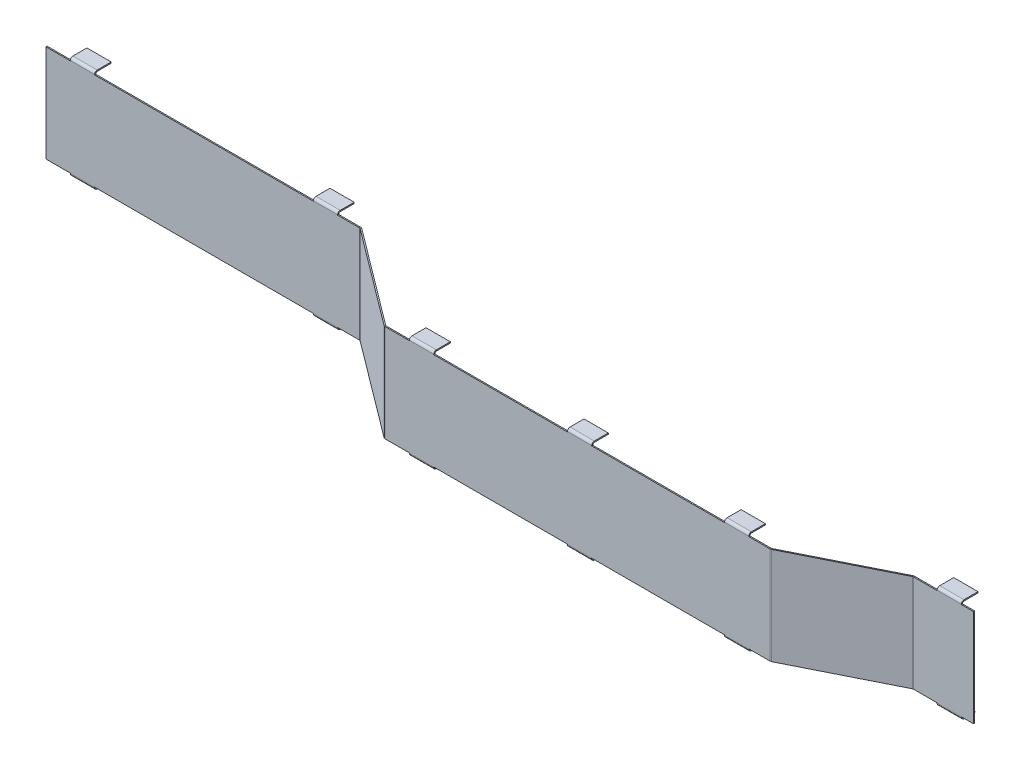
ISO-10303-21;
HEADER;
FILE_DESCRIPTION(('STEP AP214'),'2;1');
FILE_NAME('part.step','',(''),(''),'','','');
FILE_SCHEMA(('AUTOMOTIVE_DESIGN { 1 0 10303 214 1 1 1 1 }'));
ENDSEC;
DATA;
#1=APPLICATION_CONTEXT('core data for automotive mechanical design processes');
#2=APPLICATION_PROTOCOL_DEFINITION('international standard','automotive_design',2000,#1);
#3=PRODUCT_CONTEXT('',#1,'mechanical');
#4=PRODUCT('Part','Part','',(#3));
#5=PRODUCT_RELATED_PRODUCT_CATEGORY('part','',(#4));
#6=PRODUCT_DEFINITION_FORMATION('','',#4);
#7=PRODUCT_DEFINITION_CONTEXT('part definition',#1,'design');
#8=PRODUCT_DEFINITION('design','',#6,#7);
#9=PRODUCT_DEFINITION_SHAPE('','',#8);
#10=(LENGTH_UNIT() NAMED_UNIT(*) SI_UNIT(.MILLI.,.METRE.));
#11=(NAMED_UNIT(*) PLANE_ANGLE_UNIT() SI_UNIT($,.RADIAN.));
#12=(NAMED_UNIT(*) SI_UNIT($,.STERADIAN.) SOLID_ANGLE_UNIT());
#13=UNCERTAINTY_MEASURE_WITH_UNIT(LENGTH_MEASURE(1.E-05),#10,'distance_accuracy_value','');
#14=(GEOMETRIC_REPRESENTATION_CONTEXT(3) GLOBAL_UNCERTAINTY_ASSIGNED_CONTEXT((#13)) GLOBAL_UNIT_ASSIGNED_CONTEXT((#10,
#11,#12)) REPRESENTATION_CONTEXT('',''));
#15=CARTESIAN_POINT('',(0.,0.,0.));
#16=DIRECTION('',(0.,0.,1.));
#17=DIRECTION('',(1.,0.,0.));
#18=AXIS2_PLACEMENT_3D('',#15,#16,#17);
#19=CARTESIAN_POINT('',(0.,0.,-1.2192));
#20=DIRECTION('',(0.,0.,1.));
#21=DIRECTION('',(1.,0.,0.));
#22=AXIS2_PLACEMENT_3D('',#19,#20,#21);
#23=PLANE('',#22);
#24=DIRECTION('',(-1.,0.,0.));
#25=VECTOR('',#24,1.);
#26=CARTESIAN_POINT('',(25.4,-0.304800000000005,-1.2192));
#27=LINE('',#26,#25);
#28=CARTESIAN_POINT('',(25.4,-0.304800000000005,-1.2192));
#29=VERTEX_POINT('',#28);
#30=CARTESIAN_POINT('',(50.8,-0.304800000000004,-1.2192));
#31=VERTEX_POINT('',#30);
#32=EDGE_CURVE('E1127',#29,#31,#27,.F.);
#33=ORIENTED_EDGE('',*,*,#32,.F.);
#34=DIRECTION('',(0.,-1.,0.));
#35=VECTOR('',#34,1.);
#36=CARTESIAN_POINT('',(25.4,0.,-1.2192));
#37=LINE('',#36,#35);
#38=CARTESIAN_POINT('',(25.4,0.,-1.2192));
#39=VERTEX_POINT('',#38);
#40=EDGE_CURVE('E2057',#39,#29,#37,.T.);
#41=ORIENTED_EDGE('',*,*,#40,.F.);
#42=DIRECTION('',(1.,0.,0.));
#43=VECTOR('',#42,1.);
#44=CARTESIAN_POINT('',(330.2,0.,-1.2192));
#45=LINE('',#44,#43);
#46=CARTESIAN_POINT('',(0.,0.,-1.2192));
#47=VERTEX_POINT('',#46);
#48=EDGE_CURVE('E2113',#47,#39,#45,.T.);
#49=ORIENTED_EDGE('',*,*,#48,.F.);
#50=DIRECTION('',(0.,-1.,0.));
#51=VECTOR('',#50,1.);
#52=CARTESIAN_POINT('',(0.,0.,-1.2192));
#53=LINE('',#52,#51);
#54=CARTESIAN_POINT('',(0.,101.6,-1.2192));
#55=VERTEX_POINT('',#54);
#56=EDGE_CURVE('E2107',#55,#47,#53,.T.);
#57=ORIENTED_EDGE('',*,*,#56,.F.);
#58=DIRECTION('',(-1.,0.,0.));
#59=VECTOR('',#58,1.);
#60=CARTESIAN_POINT('',(330.2,101.6,-1.2192));
#61=LINE('',#60,#59);
#62=CARTESIAN_POINT('',(25.4,101.6,-1.2192));
#63=VERTEX_POINT('',#62);
#64=EDGE_CURVE('E2109',#63,#55,#61,.T.);
#65=ORIENTED_EDGE('',*,*,#64,.F.);
#66=DIRECTION('',(0.,-1.,0.));
#67=VECTOR('',#66,1.);
#68=CARTESIAN_POINT('',(25.4,101.6,-1.2192));
#69=LINE('',#68,#67);
#70=CARTESIAN_POINT('',(25.4,101.9048,-1.21920000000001));
#71=VERTEX_POINT('',#70);
#72=EDGE_CURVE('E2089',#71,#63,#69,.T.);
#73=ORIENTED_EDGE('',*,*,#72,.F.);
#74=DIRECTION('',(1.,0.,0.));
#75=VECTOR('',#74,1.);
#76=CARTESIAN_POINT('',(50.8,101.9048,-1.21920000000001));
#77=LINE('',#76,#75);
#78=CARTESIAN_POINT('',(50.8,101.9048,-1.21920000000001));
#79=VERTEX_POINT('',#78);
#80=EDGE_CURVE('E1710',#79,#71,#77,.F.);
#81=ORIENTED_EDGE('',*,*,#80,.F.);
#82=DIRECTION('',(0.,1.,0.));
#83=VECTOR('',#82,1.);
#84=CARTESIAN_POINT('',(50.8,101.6,-1.2192));
#85=LINE('',#84,#83);
#86=CARTESIAN_POINT('',(50.8,101.6,-1.2192));
#87=VERTEX_POINT('',#86);
#88=EDGE_CURVE('E2091',#87,#79,#85,.T.);
#89=ORIENTED_EDGE('',*,*,#88,.F.);
#90=CARTESIAN_POINT('',(279.4,101.6,-1.2192));
#91=VERTEX_POINT('',#90);
#92=EDGE_CURVE('E2108',#91,#87,#61,.T.);
#93=ORIENTED_EDGE('',*,*,#92,.F.);
#94=DIRECTION('',(0.,-1.,0.));
#95=VECTOR('',#94,1.);
#96=CARTESIAN_POINT('',(279.4,101.6,-1.2192));
#97=LINE('',#96,#95);
#98=CARTESIAN_POINT('',(279.4,101.9048,-1.21920000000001));
#99=VERTEX_POINT('',#98);
#100=EDGE_CURVE('E2073',#99,#91,#97,.T.);
#101=ORIENTED_EDGE('',*,*,#100,.F.);
#102=DIRECTION('',(1.,0.,0.));
#103=VECTOR('',#102,1.);
#104=CARTESIAN_POINT('',(304.8,101.9048,-1.21920000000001));
#105=LINE('',#104,#103);
#106=CARTESIAN_POINT('',(304.8,101.9048,-1.21920000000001));
#107=VERTEX_POINT('',#106);
#108=EDGE_CURVE('E1657',#107,#99,#105,.F.);
#109=ORIENTED_EDGE('',*,*,#108,.F.);
#110=DIRECTION('',(0.,1.,0.));
#111=VECTOR('',#110,1.);
#112=CARTESIAN_POINT('',(304.8,101.6,-1.2192));
#113=LINE('',#112,#111);
#114=CARTESIAN_POINT('',(304.8,101.6,-1.2192));
#115=VERTEX_POINT('',#114);
#116=EDGE_CURVE('E2075',#115,#107,#113,.T.);
#117=ORIENTED_EDGE('',*,*,#116,.F.);
#118=CARTESIAN_POINT('',(327.660000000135,101.6,-1.21919999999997));
#119=VERTEX_POINT('',#118);
#120=EDGE_CURVE('E2105',#119,#115,#61,.T.);
#121=ORIENTED_EDGE('',*,*,#120,.F.);
#122=DIRECTION('',(0.,1.,0.));
#123=VECTOR('',#122,1.);
#124=CARTESIAN_POINT('',(327.660000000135,101.6,-1.21919999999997));
#125=LINE('',#124,#123);
#126=CARTESIAN_POINT('',(327.660000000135,0.,-1.2192));
#127=VERTEX_POINT('',#126);
#128=EDGE_CURVE('E2018',#119,#127,#125,.F.);
#129=ORIENTED_EDGE('',*,*,#128,.T.);
#130=CARTESIAN_POINT('',(304.8,0.,-1.2192));
#131=VERTEX_POINT('',#130);
#132=EDGE_CURVE('E2112',#131,#127,#45,.T.);
#133=ORIENTED_EDGE('',*,*,#132,.F.);
#134=DIRECTION('',(0.,1.,0.));
#135=VECTOR('',#134,1.);
#136=CARTESIAN_POINT('',(304.8,0.,-1.2192));
#137=LINE('',#136,#135);
#138=CARTESIAN_POINT('',(304.8,-0.304800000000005,-1.2192));
#139=VERTEX_POINT('',#138);
#140=EDGE_CURVE('E2041',#139,#131,#137,.T.);
#141=ORIENTED_EDGE('',*,*,#140,.F.);
#142=DIRECTION('',(-1.,0.,0.));
#143=VECTOR('',#142,1.);
#144=CARTESIAN_POINT('',(279.4,-0.304800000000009,-1.2192));
#145=LINE('',#144,#143);
#146=CARTESIAN_POINT('',(279.4,-0.304800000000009,-1.2192));
#147=VERTEX_POINT('',#146);
#148=EDGE_CURVE('E1181',#147,#139,#145,.F.);
#149=ORIENTED_EDGE('',*,*,#148,.F.);
#150=DIRECTION('',(0.,-1.,0.));
#151=VECTOR('',#150,1.);
#152=CARTESIAN_POINT('',(279.4,0.,-1.2192));
#153=LINE('',#152,#151);
#154=CARTESIAN_POINT('',(279.4,0.,-1.2192));
#155=VERTEX_POINT('',#154);
#156=EDGE_CURVE('E2043',#155,#147,#153,.T.);
#157=ORIENTED_EDGE('',*,*,#156,.F.);
#158=CARTESIAN_POINT('',(50.8,0.,-1.2192));
#159=VERTEX_POINT('',#158);
#160=EDGE_CURVE('E2116',#159,#155,#45,.T.);
#161=ORIENTED_EDGE('',*,*,#160,.F.);
#162=DIRECTION('',(0.,1.,0.));
#163=VECTOR('',#162,1.);
#164=CARTESIAN_POINT('',(50.8,0.,-1.2192));
#165=LINE('',#164,#163);
#166=EDGE_CURVE('E2060',#31,#159,#165,.T.);
#167=ORIENTED_EDGE('',*,*,#166,.F.);
#168=EDGE_LOOP('',(#33,#41,#49,#57,#65,#73,#81,#89,#93,#101,#109,#117,#121,#129,#133,#141,#149,
#157,#161,#167));
#169=FACE_BOUND('',#168,.T.);
#170=ADVANCED_FACE('F359',(#169),#23,.F.);
#171=CARTESIAN_POINT('',(0.,0.,0.));
#172=DIRECTION('',(0.,0.,1.));
#173=DIRECTION('',(1.,0.,0.));
#174=AXIS2_PLACEMENT_3D('',#171,#172,#173);
#175=PLANE('',#174);
#176=DIRECTION('',(0.,-1.,0.));
#177=VECTOR('',#176,1.);
#178=CARTESIAN_POINT('',(25.4,0.,0.));
#179=LINE('',#178,#177);
#180=CARTESIAN_POINT('',(25.4,0.,0.));
#181=VERTEX_POINT('',#180);
#182=CARTESIAN_POINT('',(25.4,-0.304800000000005,0.));
#183=VERTEX_POINT('',#182);
#184=EDGE_CURVE('E2054',#181,#183,#179,.T.);
#185=ORIENTED_EDGE('',*,*,#184,.T.);
#186=DIRECTION('',(-1.,0.,0.));
#187=VECTOR('',#186,1.);
#188=CARTESIAN_POINT('',(25.4,-0.304800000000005,0.));
#189=LINE('',#188,#187);
#190=CARTESIAN_POINT('',(50.8,-0.304800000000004,0.));
#191=VERTEX_POINT('',#190);
#192=EDGE_CURVE('E1114',#183,#191,#189,.F.);
#193=ORIENTED_EDGE('',*,*,#192,.T.);
#194=DIRECTION('',(0.,1.,0.));
#195=VECTOR('',#194,1.);
#196=CARTESIAN_POINT('',(50.8,0.,0.));
#197=LINE('',#196,#195);
#198=CARTESIAN_POINT('',(50.8,0.,0.));
#199=VERTEX_POINT('',#198);
#200=EDGE_CURVE('E2061',#191,#199,#197,.T.);
#201=ORIENTED_EDGE('',*,*,#200,.T.);
#202=DIRECTION('',(1.,0.,0.));
#203=VECTOR('',#202,1.);
#204=CARTESIAN_POINT('',(330.2,0.,0.));
#205=LINE('',#204,#203);
#206=CARTESIAN_POINT('',(279.4,0.,0.));
#207=VERTEX_POINT('',#206);
#208=EDGE_CURVE('E2126',#199,#207,#205,.T.);
#209=ORIENTED_EDGE('',*,*,#208,.T.);
#210=DIRECTION('',(0.,-1.,0.));
#211=VECTOR('',#210,1.);
#212=CARTESIAN_POINT('',(279.4,0.,0.));
#213=LINE('',#212,#211);
#214=CARTESIAN_POINT('',(279.4,-0.304800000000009,0.));
#215=VERTEX_POINT('',#214);
#216=EDGE_CURVE('E2044',#207,#215,#213,.T.);
#217=ORIENTED_EDGE('',*,*,#216,.T.);
#218=DIRECTION('',(-1.,0.,0.));
#219=VECTOR('',#218,1.);
#220=CARTESIAN_POINT('',(279.4,-0.304800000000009,0.));
#221=LINE('',#220,#219);
#222=CARTESIAN_POINT('',(304.8,-0.304800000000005,0.));
#223=VERTEX_POINT('',#222);
#224=EDGE_CURVE('E1168',#215,#223,#221,.F.);
#225=ORIENTED_EDGE('',*,*,#224,.T.);
#226=DIRECTION('',(0.,1.,0.));
#227=VECTOR('',#226,1.);
#228=CARTESIAN_POINT('',(304.8,0.,0.));
#229=LINE('',#228,#227);
#230=CARTESIAN_POINT('',(304.8,0.,0.));
#231=VERTEX_POINT('',#230);
#232=EDGE_CURVE('E2038',#223,#231,#229,.T.);
#233=ORIENTED_EDGE('',*,*,#232,.T.);
#234=CARTESIAN_POINT('',(327.660000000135,0.,0.));
#235=VERTEX_POINT('',#234);
#236=EDGE_CURVE('E2123',#231,#235,#205,.T.);
#237=ORIENTED_EDGE('',*,*,#236,.T.);
#238=DIRECTION('',(0.,1.,0.));
#239=VECTOR('',#238,1.);
#240=CARTESIAN_POINT('',(327.660000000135,101.6,0.));
#241=LINE('',#240,#239);
#242=CARTESIAN_POINT('',(327.660000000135,101.6,0.));
#243=VERTEX_POINT('',#242);
#244=EDGE_CURVE('E2030',#243,#235,#241,.F.);
#245=ORIENTED_EDGE('',*,*,#244,.F.);
#246=DIRECTION('',(-1.,0.,0.));
#247=VECTOR('',#246,1.);
#248=CARTESIAN_POINT('',(330.2,101.6,0.));
#249=LINE('',#248,#247);
#250=CARTESIAN_POINT('',(304.8,101.6,0.));
#251=VERTEX_POINT('',#250);
#252=EDGE_CURVE('E2117',#243,#251,#249,.T.);
#253=ORIENTED_EDGE('',*,*,#252,.T.);
#254=DIRECTION('',(0.,1.,0.));
#255=VECTOR('',#254,1.);
#256=CARTESIAN_POINT('',(304.8,101.6,0.));
#257=LINE('',#256,#255);
#258=CARTESIAN_POINT('',(304.8,101.9048,0.));
#259=VERTEX_POINT('',#258);
#260=EDGE_CURVE('E2076',#251,#259,#257,.T.);
#261=ORIENTED_EDGE('',*,*,#260,.T.);
#262=DIRECTION('',(1.,0.,0.));
#263=VECTOR('',#262,1.);
#264=CARTESIAN_POINT('',(304.8,101.9048,0.));
#265=LINE('',#264,#263);
#266=CARTESIAN_POINT('',(279.4,101.9048,0.));
#267=VERTEX_POINT('',#266);
#268=EDGE_CURVE('E1644',#259,#267,#265,.F.);
#269=ORIENTED_EDGE('',*,*,#268,.T.);
#270=DIRECTION('',(0.,-1.,0.));
#271=VECTOR('',#270,1.);
#272=CARTESIAN_POINT('',(279.4,101.6,0.));
#273=LINE('',#272,#271);
#274=CARTESIAN_POINT('',(279.4,101.6,0.));
#275=VERTEX_POINT('',#274);
#276=EDGE_CURVE('E2070',#267,#275,#273,.T.);
#277=ORIENTED_EDGE('',*,*,#276,.T.);
#278=CARTESIAN_POINT('',(50.8,101.6,0.));
#279=VERTEX_POINT('',#278);
#280=EDGE_CURVE('E2120',#275,#279,#249,.T.);
#281=ORIENTED_EDGE('',*,*,#280,.T.);
#282=DIRECTION('',(0.,1.,0.));
#283=VECTOR('',#282,1.);
#284=CARTESIAN_POINT('',(50.8,101.6,0.));
#285=LINE('',#284,#283);
#286=CARTESIAN_POINT('',(50.8,101.9048,0.));
#287=VERTEX_POINT('',#286);
#288=EDGE_CURVE('E2092',#279,#287,#285,.T.);
#289=ORIENTED_EDGE('',*,*,#288,.T.);
#290=DIRECTION('',(1.,0.,0.));
#291=VECTOR('',#290,1.);
#292=CARTESIAN_POINT('',(50.8,101.9048,0.));
#293=LINE('',#292,#291);
#294=CARTESIAN_POINT('',(25.4,101.9048,0.));
#295=VERTEX_POINT('',#294);
#296=EDGE_CURVE('E1697',#287,#295,#293,.F.);
#297=ORIENTED_EDGE('',*,*,#296,.T.);
#298=DIRECTION('',(0.,-1.,0.));
#299=VECTOR('',#298,1.);
#300=CARTESIAN_POINT('',(25.4,101.6,0.));
#301=LINE('',#300,#299);
#302=CARTESIAN_POINT('',(25.4,101.6,0.));
#303=VERTEX_POINT('',#302);
#304=EDGE_CURVE('E2086',#295,#303,#301,.T.);
#305=ORIENTED_EDGE('',*,*,#304,.T.);
#306=CARTESIAN_POINT('',(0.,101.6,0.));
#307=VERTEX_POINT('',#306);
#308=EDGE_CURVE('E2102',#303,#307,#249,.T.);
#309=ORIENTED_EDGE('',*,*,#308,.T.);
#310=DIRECTION('',(0.,-1.,0.));
#311=VECTOR('',#310,1.);
#312=CARTESIAN_POINT('',(0.,0.,0.));
#313=LINE('',#312,#311);
#314=CARTESIAN_POINT('',(0.,0.,0.));
#315=VERTEX_POINT('',#314);
#316=EDGE_CURVE('E2119',#307,#315,#313,.T.);
#317=ORIENTED_EDGE('',*,*,#316,.T.);
#318=EDGE_CURVE('E2124',#315,#181,#205,.T.);
#319=ORIENTED_EDGE('',*,*,#318,.T.);
#320=EDGE_LOOP('',(#185,#193,#201,#209,#217,#225,#233,#237,#245,#253,#261,#269,#277,#281,#289,
#297,#305,#309,#317,#319));
#321=FACE_BOUND('',#320,.T.);
#322=ADVANCED_FACE('F2132',(#321),#175,.T.);
#323=CARTESIAN_POINT('',(25.4,0.,-1.2192));
#324=DIRECTION('',(-1.,0.,0.));
#325=DIRECTION('',(0.,0.,1.));
#326=AXIS2_PLACEMENT_3D('',#323,#324,#325);
#327=PLANE('',#326);
#328=ORIENTED_EDGE('',*,*,#40,.T.);
#329=DIRECTION('',(0.,0.,1.));
#330=VECTOR('',#329,1.);
#331=CARTESIAN_POINT('',(25.4,-0.304800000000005,-1.2192));
#332=LINE('',#331,#330);
#333=EDGE_CURVE('E1121',#29,#183,#332,.T.);
#334=ORIENTED_EDGE('',*,*,#333,.T.);
#335=ORIENTED_EDGE('',*,*,#184,.F.);
#336=DIRECTION('',(0.,0.,1.));
#337=VECTOR('',#336,1.);
#338=CARTESIAN_POINT('',(25.4,0.,-1.2192));
#339=LINE('',#338,#337);
#340=EDGE_CURVE('E2067',#39,#181,#339,.T.);
#341=ORIENTED_EDGE('',*,*,#340,.F.);
#342=EDGE_LOOP('',(#328,#334,#335,#341));
#343=FACE_BOUND('',#342,.T.);
#344=ADVANCED_FACE('F2221',(#343),#327,.T.);
#345=CARTESIAN_POINT('',(279.4,0.,-1.2192));
#346=DIRECTION('',(-1.,0.,0.));
#347=DIRECTION('',(0.,0.,1.));
#348=AXIS2_PLACEMENT_3D('',#345,#346,#347);
#349=PLANE('',#348);
#350=ORIENTED_EDGE('',*,*,#156,.T.);
#351=DIRECTION('',(0.,0.,1.));
#352=VECTOR('',#351,1.);
#353=CARTESIAN_POINT('',(279.4,-0.304800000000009,-1.2192));
#354=LINE('',#353,#352);
#355=EDGE_CURVE('E1175',#147,#215,#354,.T.);
#356=ORIENTED_EDGE('',*,*,#355,.T.);
#357=ORIENTED_EDGE('',*,*,#216,.F.);
#358=DIRECTION('',(0.,0.,1.));
#359=VECTOR('',#358,1.);
#360=CARTESIAN_POINT('',(279.4,0.,-1.2192));
#361=LINE('',#360,#359);
#362=EDGE_CURVE('E2051',#155,#207,#361,.T.);
#363=ORIENTED_EDGE('',*,*,#362,.F.);
#364=EDGE_LOOP('',(#350,#356,#357,#363));
#365=FACE_BOUND('',#364,.T.);
#366=ADVANCED_FACE('F2185',(#365),#349,.T.);
#367=CARTESIAN_POINT('',(-2.43839999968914,0.,25.2475999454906));
#368=DIRECTION('',(0.,0.,1.));
#369=DIRECTION('',(1.,0.,0.));
#370=AXIS2_PLACEMENT_3D('',#367,#368,#369);
#371=PLANE('',#370);
#372=DIRECTION('',(-1.,0.,0.));
#373=VECTOR('',#372,1.);
#374=CARTESIAN_POINT('',(957.800186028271,-0.304800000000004,25.2475999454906));
#375=LINE('',#374,#373);
#376=CARTESIAN_POINT('',(957.800186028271,-0.304800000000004,25.2475999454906));
#377=VERTEX_POINT('',#376);
#378=CARTESIAN_POINT('',(983.200186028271,-0.304800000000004,25.2475999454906));
#379=VERTEX_POINT('',#378);
#380=EDGE_CURVE('E1234',#377,#379,#375,.F.);
#381=ORIENTED_EDGE('',*,*,#380,.F.);
#382=DIRECTION('',(0.,-1.,0.));
#383=VECTOR('',#382,1.);
#384=CARTESIAN_POINT('',(957.800186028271,0.,25.2475999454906));
#385=LINE('',#384,#383);
#386=CARTESIAN_POINT('',(957.800186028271,0.,25.2475999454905));
#387=VERTEX_POINT('',#386);
#388=EDGE_CURVE('E1720',#387,#377,#385,.T.);
#389=ORIENTED_EDGE('',*,*,#388,.F.);
#390=DIRECTION('',(-1.,0.,0.));
#391=VECTOR('',#390,1.);
#392=CARTESIAN_POINT('',(-2.43839999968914,0.,25.2475999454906));
#393=LINE('',#392,#391);
#394=CARTESIAN_POINT('',(933.047767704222,0.,25.2475999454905));
#395=VERTEX_POINT('',#394);
#396=EDGE_CURVE('E1768',#387,#395,#393,.T.);
#397=ORIENTED_EDGE('',*,*,#396,.T.);
#398=DIRECTION('',(0.,1.,0.));
#399=VECTOR('',#398,1.);
#400=CARTESIAN_POINT('',(933.047767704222,0.,25.2475999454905));
#401=LINE('',#400,#399);
#402=CARTESIAN_POINT('',(933.047767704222,101.6,25.2475999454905));
#403=VERTEX_POINT('',#402);
#404=EDGE_CURVE('E1779',#403,#395,#401,.F.);
#405=ORIENTED_EDGE('',*,*,#404,.F.);
#406=DIRECTION('',(1.,0.,0.));
#407=VECTOR('',#406,1.);
#408=CARTESIAN_POINT('',(-2.43839999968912,101.6,25.2475999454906));
#409=LINE('',#408,#407);
#410=CARTESIAN_POINT('',(957.800186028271,101.6,25.2475999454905));
#411=VERTEX_POINT('',#410);
#412=EDGE_CURVE('E1761',#403,#411,#409,.T.);
#413=ORIENTED_EDGE('',*,*,#412,.T.);
#414=DIRECTION('',(0.,-1.,0.));
#415=VECTOR('',#414,1.);
#416=CARTESIAN_POINT('',(957.800186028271,101.6,25.2475999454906));
#417=LINE('',#416,#415);
#418=CARTESIAN_POINT('',(957.800186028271,101.9048,25.2475999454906));
#419=VERTEX_POINT('',#418);
#420=EDGE_CURVE('E1736',#419,#411,#417,.T.);
#421=ORIENTED_EDGE('',*,*,#420,.F.);
#422=DIRECTION('',(1.,0.,0.));
#423=VECTOR('',#422,1.);
#424=CARTESIAN_POINT('',(983.200186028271,101.9048,25.2475999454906));
#425=LINE('',#424,#423);
#426=CARTESIAN_POINT('',(983.200186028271,101.9048,25.2475999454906));
#427=VERTEX_POINT('',#426);
#428=EDGE_CURVE('E1604',#427,#419,#425,.F.);
#429=ORIENTED_EDGE('',*,*,#428,.F.);
#430=DIRECTION('',(0.,1.,0.));
#431=VECTOR('',#430,1.);
#432=CARTESIAN_POINT('',(983.200186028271,101.6,25.2475999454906));
#433=LINE('',#432,#431);
#434=CARTESIAN_POINT('',(983.20018602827,101.6,25.2475999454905));
#435=VERTEX_POINT('',#434);
#436=EDGE_CURVE('E1738',#435,#427,#433,.T.);
#437=ORIENTED_EDGE('',*,*,#436,.F.);
#438=CARTESIAN_POINT('',(995.900186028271,101.6,25.2475999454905));
#439=VERTEX_POINT('',#438);
#440=EDGE_CURVE('E1764',#435,#439,#409,.T.);
#441=ORIENTED_EDGE('',*,*,#440,.T.);
#442=DIRECTION('',(0.,-1.,0.));
#443=VECTOR('',#442,1.);
#444=CARTESIAN_POINT('',(995.900186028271,0.,25.2475999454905));
#445=LINE('',#444,#443);
#446=CARTESIAN_POINT('',(995.900186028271,0.,25.2475999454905));
#447=VERTEX_POINT('',#446);
#448=EDGE_CURVE('E1759',#439,#447,#445,.T.);
#449=ORIENTED_EDGE('',*,*,#448,.T.);
#450=CARTESIAN_POINT('',(983.20018602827,0.,25.2475999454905));
#451=VERTEX_POINT('',#450);
#452=EDGE_CURVE('E1765',#447,#451,#393,.T.);
#453=ORIENTED_EDGE('',*,*,#452,.T.);
#454=DIRECTION('',(0.,1.,0.));
#455=VECTOR('',#454,1.);
#456=CARTESIAN_POINT('',(983.200186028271,0.,25.2475999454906));
#457=LINE('',#456,#455);
#458=EDGE_CURVE('E1723',#379,#451,#457,.T.);
#459=ORIENTED_EDGE('',*,*,#458,.F.);
#460=EDGE_LOOP('',(#381,#389,#397,#405,#413,#421,#429,#437,#441,#449,#453,#459));
#461=FACE_BOUND('',#460,.T.);
#462=ADVANCED_FACE('F2334',(#461),#371,.F.);
#463=CARTESIAN_POINT('',(-2.43839999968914,0.,26.4667999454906));
#464=DIRECTION('',(0.,0.,1.));
#465=DIRECTION('',(1.,0.,0.));
#466=AXIS2_PLACEMENT_3D('',#463,#464,#465);
#467=PLANE('',#466);
#468=DIRECTION('',(0.,-1.,0.));
#469=VECTOR('',#468,1.);
#470=CARTESIAN_POINT('',(957.800186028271,0.,26.4667999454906));
#471=LINE('',#470,#469);
#472=CARTESIAN_POINT('',(957.800186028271,0.,26.4667999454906));
#473=VERTEX_POINT('',#472);
#474=CARTESIAN_POINT('',(957.800186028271,-0.304800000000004,26.4667999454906));
#475=VERTEX_POINT('',#474);
#476=EDGE_CURVE('E1717',#473,#475,#471,.T.);
#477=ORIENTED_EDGE('',*,*,#476,.T.);
#478=DIRECTION('',(-1.,0.,0.));
#479=VECTOR('',#478,1.);
#480=CARTESIAN_POINT('',(957.800186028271,-0.304800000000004,26.4667999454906));
#481=LINE('',#480,#479);
#482=CARTESIAN_POINT('',(983.200186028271,-0.304800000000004,26.4667999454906));
#483=VERTEX_POINT('',#482);
#484=EDGE_CURVE('E1221',#475,#483,#481,.F.);
#485=ORIENTED_EDGE('',*,*,#484,.T.);
#486=DIRECTION('',(0.,1.,0.));
#487=VECTOR('',#486,1.);
#488=CARTESIAN_POINT('',(983.200186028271,0.,26.4667999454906));
#489=LINE('',#488,#487);
#490=CARTESIAN_POINT('',(983.200186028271,0.,26.4667999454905));
#491=VERTEX_POINT('',#490);
#492=EDGE_CURVE('E1724',#483,#491,#489,.T.);
#493=ORIENTED_EDGE('',*,*,#492,.T.);
#494=DIRECTION('',(1.,0.,0.));
#495=VECTOR('',#494,1.);
#496=CARTESIAN_POINT('',(932.688000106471,0.,26.4667999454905));
#497=LINE('',#496,#495);
#498=CARTESIAN_POINT('',(995.900186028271,0.,26.4667999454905));
#499=VERTEX_POINT('',#498);
#500=EDGE_CURVE('E1775',#499,#491,#497,.F.);
#501=ORIENTED_EDGE('',*,*,#500,.F.);
#502=DIRECTION('',(0.,1.,0.));
#503=VECTOR('',#502,1.);
#504=CARTESIAN_POINT('',(995.900186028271,0.,26.4667999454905));
#505=LINE('',#504,#503);
#506=CARTESIAN_POINT('',(995.900186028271,101.6,26.4667999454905));
#507=VERTEX_POINT('',#506);
#508=EDGE_CURVE('E1769',#507,#499,#505,.F.);
#509=ORIENTED_EDGE('',*,*,#508,.F.);
#510=DIRECTION('',(-1.,0.,0.));
#511=VECTOR('',#510,1.);
#512=CARTESIAN_POINT('',(995.900186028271,101.6,26.4667999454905));
#513=LINE('',#512,#511);
#514=CARTESIAN_POINT('',(983.200186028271,101.6,26.4667999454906));
#515=VERTEX_POINT('',#514);
#516=EDGE_CURVE('E1774',#515,#507,#513,.F.);
#517=ORIENTED_EDGE('',*,*,#516,.F.);
#518=DIRECTION('',(0.,1.,0.));
#519=VECTOR('',#518,1.);
#520=CARTESIAN_POINT('',(983.200186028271,101.6,26.4667999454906));
#521=LINE('',#520,#519);
#522=CARTESIAN_POINT('',(983.200186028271,101.9048,26.4667999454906));
#523=VERTEX_POINT('',#522);
#524=EDGE_CURVE('E1739',#515,#523,#521,.T.);
#525=ORIENTED_EDGE('',*,*,#524,.T.);
#526=DIRECTION('',(1.,0.,0.));
#527=VECTOR('',#526,1.);
#528=CARTESIAN_POINT('',(983.200186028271,101.9048,26.4667999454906));
#529=LINE('',#528,#527);
#530=CARTESIAN_POINT('',(957.800186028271,101.9048,26.4667999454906));
#531=VERTEX_POINT('',#530);
#532=EDGE_CURVE('E1591',#523,#531,#529,.F.);
#533=ORIENTED_EDGE('',*,*,#532,.T.);
#534=DIRECTION('',(0.,-1.,0.));
#535=VECTOR('',#534,1.);
#536=CARTESIAN_POINT('',(957.800186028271,101.6,26.4667999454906));
#537=LINE('',#536,#535);
#538=CARTESIAN_POINT('',(957.800186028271,101.6,26.4667999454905));
#539=VERTEX_POINT('',#538);
#540=EDGE_CURVE('E1733',#531,#539,#537,.T.);
#541=ORIENTED_EDGE('',*,*,#540,.T.);
#542=CARTESIAN_POINT('',(933.047767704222,101.6,26.4667999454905));
#543=VERTEX_POINT('',#542);
#544=EDGE_CURVE('E1771',#543,#539,#513,.F.);
#545=ORIENTED_EDGE('',*,*,#544,.F.);
#546=DIRECTION('',(0.,1.,0.));
#547=VECTOR('',#546,1.);
#548=CARTESIAN_POINT('',(933.047767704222,0.,26.4667999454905));
#549=LINE('',#548,#547);
#550=CARTESIAN_POINT('',(933.047767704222,0.,26.4667999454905));
#551=VERTEX_POINT('',#550);
#552=EDGE_CURVE('E1785',#551,#543,#549,.T.);
#553=ORIENTED_EDGE('',*,*,#552,.F.);
#554=EDGE_CURVE('E1778',#473,#551,#497,.F.);
#555=ORIENTED_EDGE('',*,*,#554,.F.);
#556=EDGE_LOOP('',(#477,#485,#493,#501,#509,#517,#525,#533,#541,#545,#553,#555));
#557=FACE_BOUND('',#556,.T.);
#558=ADVANCED_FACE('F2322',(#557),#467,.T.);
#559=CARTESIAN_POINT('',(957.800186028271,0.,25.2475999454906));
#560=DIRECTION('',(-1.,0.,0.));
#561=DIRECTION('',(0.,0.,1.));
#562=AXIS2_PLACEMENT_3D('',#559,#560,#561);
#563=PLANE('',#562);
#564=ORIENTED_EDGE('',*,*,#388,.T.);
#565=DIRECTION('',(0.,0.,1.));
#566=VECTOR('',#565,1.);
#567=CARTESIAN_POINT('',(957.800186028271,-0.304800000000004,25.2475999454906));
#568=LINE('',#567,#566);
#569=EDGE_CURVE('E1228',#377,#475,#568,.T.);
#570=ORIENTED_EDGE('',*,*,#569,.T.);
#571=ORIENTED_EDGE('',*,*,#476,.F.);
#572=DIRECTION('',(0.,0.,1.));
#573=VECTOR('',#572,1.);
#574=CARTESIAN_POINT('',(957.800186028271,0.,25.2475999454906));
#575=LINE('',#574,#573);
#576=EDGE_CURVE('E1730',#387,#473,#575,.T.);
#577=ORIENTED_EDGE('',*,*,#576,.F.);
#578=EDGE_LOOP('',(#564,#570,#571,#577));
#579=FACE_BOUND('',#578,.T.);
#580=ADVANCED_FACE('F2318',(#579),#563,.T.);
#581=CARTESIAN_POINT('',(-1.62559999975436,0.,76.0476000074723));
#582=DIRECTION('',(0.,0.,-1.));
#583=DIRECTION('',(-1.,0.,0.));
#584=AXIS2_PLACEMENT_3D('',#581,#582,#583);
#585=PLANE('',#584);
#586=DIRECTION('',(-1.,0.,0.));
#587=VECTOR('',#586,1.);
#588=CARTESIAN_POINT('',(785.164799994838,-0.304800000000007,76.0476000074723));
#589=LINE('',#588,#587);
#590=CARTESIAN_POINT('',(785.164799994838,-0.304800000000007,76.0476000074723));
#591=VERTEX_POINT('',#590);
#592=CARTESIAN_POINT('',(810.564799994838,-0.304800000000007,76.0476000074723));
#593=VERTEX_POINT('',#592);
#594=EDGE_CURVE('E1274',#591,#593,#589,.F.);
#595=ORIENTED_EDGE('',*,*,#594,.T.);
#596=DIRECTION('',(0.,1.,0.));
#597=VECTOR('',#596,1.);
#598=CARTESIAN_POINT('',(810.564799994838,0.,76.0476000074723));
#599=LINE('',#598,#597);
#600=CARTESIAN_POINT('',(810.564799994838,0.,76.0476000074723));
#601=VERTEX_POINT('',#600);
#602=EDGE_CURVE('E1887',#593,#601,#599,.T.);
#603=ORIENTED_EDGE('',*,*,#602,.T.);
#604=DIRECTION('',(1.,0.,0.));
#605=VECTOR('',#604,1.);
#606=CARTESIAN_POINT('',(-1.62559999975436,0.,76.0476000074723));
#607=LINE('',#606,#605);
#608=CARTESIAN_POINT('',(832.878818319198,0.,76.0476000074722));
#609=VERTEX_POINT('',#608);
#610=EDGE_CURVE('E1950',#601,#609,#607,.T.);
#611=ORIENTED_EDGE('',*,*,#610,.T.);
#612=DIRECTION('',(0.,-1.,0.));
#613=VECTOR('',#612,1.);
#614=CARTESIAN_POINT('',(832.878818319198,0.,76.0476000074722));
#615=LINE('',#614,#613);
#616=CARTESIAN_POINT('',(832.878818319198,101.6,76.0476000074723));
#617=VERTEX_POINT('',#616);
#618=EDGE_CURVE('E1833',#609,#617,#615,.F.);
#619=ORIENTED_EDGE('',*,*,#618,.T.);
#620=DIRECTION('',(-1.,0.,0.));
#621=VECTOR('',#620,1.);
#622=CARTESIAN_POINT('',(-1.62559999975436,101.6,76.0476000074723));
#623=LINE('',#622,#621);
#624=CARTESIAN_POINT('',(810.564799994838,101.6,76.0476000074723));
#625=VERTEX_POINT('',#624);
#626=EDGE_CURVE('E1948',#617,#625,#623,.T.);
#627=ORIENTED_EDGE('',*,*,#626,.T.);
#628=DIRECTION('',(0.,1.,0.));
#629=VECTOR('',#628,1.);
#630=CARTESIAN_POINT('',(810.564799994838,101.6,76.0476000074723));
#631=LINE('',#630,#629);
#632=CARTESIAN_POINT('',(810.564799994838,101.9048,76.0476000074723));
#633=VERTEX_POINT('',#632);
#634=EDGE_CURVE('E1915',#625,#633,#631,.T.);
#635=ORIENTED_EDGE('',*,*,#634,.T.);
#636=DIRECTION('',(1.,0.,0.));
#637=VECTOR('',#636,1.);
#638=CARTESIAN_POINT('',(810.564799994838,101.9048,76.0476000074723));
#639=LINE('',#638,#637);
#640=CARTESIAN_POINT('',(785.164799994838,101.9048,76.0476000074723));
#641=VERTEX_POINT('',#640);
#642=EDGE_CURVE('E1432',#633,#641,#639,.F.);
#643=ORIENTED_EDGE('',*,*,#642,.T.);
#644=DIRECTION('',(0.,-1.,0.));
#645=VECTOR('',#644,1.);
#646=CARTESIAN_POINT('',(785.164799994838,101.6,76.0476000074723));
#647=LINE('',#646,#645);
#648=CARTESIAN_POINT('',(785.164799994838,101.6,76.0476000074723));
#649=VERTEX_POINT('',#648);
#650=EDGE_CURVE('E1909',#641,#649,#647,.T.);
#651=ORIENTED_EDGE('',*,*,#650,.T.);
#652=CARTESIAN_POINT('',(646.379199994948,101.6,76.0476000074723));
#653=VERTEX_POINT('',#652);
#654=EDGE_CURVE('E1951',#649,#653,#623,.T.);
#655=ORIENTED_EDGE('',*,*,#654,.T.);
#656=DIRECTION('',(0.,1.,0.));
#657=VECTOR('',#656,1.);
#658=CARTESIAN_POINT('',(646.379199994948,101.6,76.0476000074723));
#659=LINE('',#658,#657);
#660=CARTESIAN_POINT('',(646.379199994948,101.9048,76.0476000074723));
#661=VERTEX_POINT('',#660);
#662=EDGE_CURVE('E1873',#653,#661,#659,.T.);
#663=ORIENTED_EDGE('',*,*,#662,.T.);
#664=DIRECTION('',(1.,0.,0.));
#665=VECTOR('',#664,1.);
#666=CARTESIAN_POINT('',(646.379199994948,101.9048,76.0476000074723));
#667=LINE('',#666,#665);
#668=CARTESIAN_POINT('',(620.979199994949,101.9048,76.0476000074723));
#669=VERTEX_POINT('',#668);
#670=EDGE_CURVE('E1485',#661,#669,#667,.F.);
#671=ORIENTED_EDGE('',*,*,#670,.T.);
#672=DIRECTION('',(0.,-1.,0.));
#673=VECTOR('',#672,1.);
#674=CARTESIAN_POINT('',(620.979199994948,101.6,76.0476000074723));
#675=LINE('',#674,#673);
#676=CARTESIAN_POINT('',(620.979199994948,101.6,76.0476000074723));
#677=VERTEX_POINT('',#676);
#678=EDGE_CURVE('E1867',#669,#677,#675,.T.);
#679=ORIENTED_EDGE('',*,*,#678,.T.);
#680=CARTESIAN_POINT('',(481.279199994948,101.6,76.0476000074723));
#681=VERTEX_POINT('',#680);
#682=EDGE_CURVE('E1952',#677,#681,#623,.T.);
#683=ORIENTED_EDGE('',*,*,#682,.T.);
#684=DIRECTION('',(0.,1.,0.));
#685=VECTOR('',#684,1.);
#686=CARTESIAN_POINT('',(481.279199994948,101.6,76.0476000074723));
#687=LINE('',#686,#685);
#688=CARTESIAN_POINT('',(481.279199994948,101.9048,76.0476000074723));
#689=VERTEX_POINT('',#688);
#690=EDGE_CURVE('E1930',#681,#689,#687,.T.);
#691=ORIENTED_EDGE('',*,*,#690,.T.);
#692=DIRECTION('',(1.,0.,0.));
#693=VECTOR('',#692,1.);
#694=CARTESIAN_POINT('',(481.279199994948,101.9048,76.0476000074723));
#695=LINE('',#694,#693);
#696=CARTESIAN_POINT('',(455.879199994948,101.9048,76.0476000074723));
#697=VERTEX_POINT('',#696);
#698=EDGE_CURVE('E1538',#689,#697,#695,.F.);
#699=ORIENTED_EDGE('',*,*,#698,.T.);
#700=DIRECTION('',(0.,-1.,0.));
#701=VECTOR('',#700,1.);
#702=CARTESIAN_POINT('',(455.879199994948,101.6,76.0476000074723));
#703=LINE('',#702,#701);
#704=CARTESIAN_POINT('',(455.879199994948,101.6,76.0476000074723));
#705=VERTEX_POINT('',#704);
#706=EDGE_CURVE('E1924',#697,#705,#703,.T.);
#707=ORIENTED_EDGE('',*,*,#706,.T.);
#708=CARTESIAN_POINT('',(430.479199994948,101.6,76.0476000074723));
#709=VERTEX_POINT('',#708);
#710=EDGE_CURVE('E1953',#705,#709,#623,.T.);
#711=ORIENTED_EDGE('',*,*,#710,.T.);
#712=DIRECTION('',(0.,-1.,0.));
#713=VECTOR('',#712,1.);
#714=CARTESIAN_POINT('',(430.479199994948,101.6,76.0476000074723));
#715=LINE('',#714,#713);
#716=CARTESIAN_POINT('',(430.479199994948,0.,76.0476000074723));
#717=VERTEX_POINT('',#716);
#718=EDGE_CURVE('E1964',#717,#709,#715,.F.);
#719=ORIENTED_EDGE('',*,*,#718,.F.);
#720=CARTESIAN_POINT('',(455.879199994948,0.,76.0476000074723));
#721=VERTEX_POINT('',#720);
#722=EDGE_CURVE('E1942',#717,#721,#607,.T.);
#723=ORIENTED_EDGE('',*,*,#722,.T.);
#724=DIRECTION('',(0.,-1.,0.));
#725=VECTOR('',#724,1.);
#726=CARTESIAN_POINT('',(455.879199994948,0.,76.0476000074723));
#727=LINE('',#726,#725);
#728=CARTESIAN_POINT('',(455.879199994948,-0.304800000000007,76.0476000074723));
#729=VERTEX_POINT('',#728);
#730=EDGE_CURVE('E1895',#721,#729,#727,.T.);
#731=ORIENTED_EDGE('',*,*,#730,.T.);
#732=DIRECTION('',(-1.,0.,0.));
#733=VECTOR('',#732,1.);
#734=CARTESIAN_POINT('',(455.879199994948,-0.304800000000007,76.0476000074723));
#735=LINE('',#734,#733);
#736=CARTESIAN_POINT('',(481.279199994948,-0.304800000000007,76.0476000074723));
#737=VERTEX_POINT('',#736);
#738=EDGE_CURVE('E1378',#729,#737,#735,.F.);
#739=ORIENTED_EDGE('',*,*,#738,.T.);
#740=DIRECTION('',(0.,1.,0.));
#741=VECTOR('',#740,1.);
#742=CARTESIAN_POINT('',(481.279199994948,0.,76.0476000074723));
#743=LINE('',#742,#741);
#744=CARTESIAN_POINT('',(481.279199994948,0.,76.0476000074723));
#745=VERTEX_POINT('',#744);
#746=EDGE_CURVE('E1902',#737,#745,#743,.T.);
#747=ORIENTED_EDGE('',*,*,#746,.T.);
#748=CARTESIAN_POINT('',(620.979199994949,0.,76.0476000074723));
#749=VERTEX_POINT('',#748);
#750=EDGE_CURVE('E1946',#745,#749,#607,.T.);
#751=ORIENTED_EDGE('',*,*,#750,.T.);
#752=DIRECTION('',(0.,-1.,0.));
#753=VECTOR('',#752,1.);
#754=CARTESIAN_POINT('',(620.979199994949,0.,76.0476000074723));
#755=LINE('',#754,#753);
#756=CARTESIAN_POINT('',(620.979199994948,-0.304800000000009,76.0476000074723));
#757=VERTEX_POINT('',#756);
#758=EDGE_CURVE('E1853',#749,#757,#755,.T.);
#759=ORIENTED_EDGE('',*,*,#758,.T.);
#760=DIRECTION('',(-1.,0.,0.));
#761=VECTOR('',#760,1.);
#762=CARTESIAN_POINT('',(620.979199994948,-0.304800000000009,76.0476000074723));
#763=LINE('',#762,#761);
#764=CARTESIAN_POINT('',(646.379199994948,-0.304800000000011,76.0476000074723));
#765=VERTEX_POINT('',#764);
#766=EDGE_CURVE('E1324',#757,#765,#763,.F.);
#767=ORIENTED_EDGE('',*,*,#766,.T.);
#768=DIRECTION('',(0.,1.,0.));
#769=VECTOR('',#768,1.);
#770=CARTESIAN_POINT('',(646.379199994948,0.,76.0476000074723));
#771=LINE('',#770,#769);
#772=CARTESIAN_POINT('',(646.379199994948,0.,76.0476000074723));
#773=VERTEX_POINT('',#772);
#774=EDGE_CURVE('E1860',#765,#773,#771,.T.);
#775=ORIENTED_EDGE('',*,*,#774,.T.);
#776=CARTESIAN_POINT('',(785.164799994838,0.,76.0476000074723));
#777=VERTEX_POINT('',#776);
#778=EDGE_CURVE('E1947',#773,#777,#607,.T.);
#779=ORIENTED_EDGE('',*,*,#778,.T.);
#780=DIRECTION('',(0.,-1.,0.));
#781=VECTOR('',#780,1.);
#782=CARTESIAN_POINT('',(785.164799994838,0.,76.0476000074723));
#783=LINE('',#782,#781);
#784=EDGE_CURVE('E1881',#777,#591,#783,.T.);
#785=ORIENTED_EDGE('',*,*,#784,.T.);
#786=EDGE_LOOP('',(#595,#603,#611,#619,#627,#635,#643,#651,#655,#663,#671,#679,#683,#691,#699,
#707,#711,#719,#723,#731,#739,#747,#751,#759,#767,#775,#779,#785));
#787=FACE_BOUND('',#786,.T.);
#788=ADVANCED_FACE('F2321',(#787),#585,.F.);
#789=CARTESIAN_POINT('',(-1.62559999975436,0.,74.8284000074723));
#790=DIRECTION('',(0.,0.,-1.));
#791=DIRECTION('',(-1.,0.,0.));
#792=AXIS2_PLACEMENT_3D('',#789,#790,#791);
#793=PLANE('',#792);
#794=DIRECTION('',(0.,1.,0.));
#795=VECTOR('',#794,1.);
#796=CARTESIAN_POINT('',(810.564799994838,0.,74.8284000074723));
#797=LINE('',#796,#795);
#798=CARTESIAN_POINT('',(810.564799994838,-0.304800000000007,74.8284000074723));
#799=VERTEX_POINT('',#798);
#800=CARTESIAN_POINT('',(810.564799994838,0.,74.8284000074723));
#801=VERTEX_POINT('',#800);
#802=EDGE_CURVE('E1886',#799,#801,#797,.T.);
#803=ORIENTED_EDGE('',*,*,#802,.F.);
#804=DIRECTION('',(-1.,0.,0.));
#805=VECTOR('',#804,1.);
#806=CARTESIAN_POINT('',(785.164799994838,-0.304800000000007,74.8284000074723));
#807=LINE('',#806,#805);
#808=CARTESIAN_POINT('',(785.164799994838,-0.304800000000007,74.8284000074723));
#809=VERTEX_POINT('',#808);
#810=EDGE_CURVE('E374',#809,#799,#807,.F.);
#811=ORIENTED_EDGE('',*,*,#810,.F.);
#812=DIRECTION('',(0.,-1.,0.));
#813=VECTOR('',#812,1.);
#814=CARTESIAN_POINT('',(785.164799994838,0.,74.8284000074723));
#815=LINE('',#814,#813);
#816=CARTESIAN_POINT('',(785.164799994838,0.,74.8284000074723));
#817=VERTEX_POINT('',#816);
#818=EDGE_CURVE('E1884',#817,#809,#815,.T.);
#819=ORIENTED_EDGE('',*,*,#818,.F.);
#820=DIRECTION('',(-1.,0.,0.));
#821=VECTOR('',#820,1.);
#822=CARTESIAN_POINT('',(835.964799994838,0.,74.8284000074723));
#823=LINE('',#822,#821);
#824=CARTESIAN_POINT('',(646.379199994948,0.,74.8284000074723));
#825=VERTEX_POINT('',#824);
#826=EDGE_CURVE('E1957',#825,#817,#823,.F.);
#827=ORIENTED_EDGE('',*,*,#826,.F.);
#828=DIRECTION('',(0.,1.,0.));
#829=VECTOR('',#828,1.);
#830=CARTESIAN_POINT('',(646.379199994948,0.,74.8284000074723));
#831=LINE('',#830,#829);
#832=CARTESIAN_POINT('',(646.379199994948,-0.304800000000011,74.8284000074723));
#833=VERTEX_POINT('',#832);
#834=EDGE_CURVE('E1859',#833,#825,#831,.T.);
#835=ORIENTED_EDGE('',*,*,#834,.F.);
#836=DIRECTION('',(-1.,0.,0.));
#837=VECTOR('',#836,1.);
#838=CARTESIAN_POINT('',(620.979199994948,-0.304800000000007,74.8284000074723));
#839=LINE('',#838,#837);
#840=CARTESIAN_POINT('',(620.979199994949,-0.304800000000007,74.8284000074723));
#841=VERTEX_POINT('',#840);
#842=EDGE_CURVE('E1337',#841,#833,#839,.F.);
#843=ORIENTED_EDGE('',*,*,#842,.F.);
#844=DIRECTION('',(0.,-1.,0.));
#845=VECTOR('',#844,1.);
#846=CARTESIAN_POINT('',(620.979199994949,0.,74.8284000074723));
#847=LINE('',#846,#845);
#848=CARTESIAN_POINT('',(620.979199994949,0.,74.8284000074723));
#849=VERTEX_POINT('',#848);
#850=EDGE_CURVE('E1856',#849,#841,#847,.T.);
#851=ORIENTED_EDGE('',*,*,#850,.F.);
#852=CARTESIAN_POINT('',(481.279199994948,0.,74.8284000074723));
#853=VERTEX_POINT('',#852);
#854=EDGE_CURVE('E1956',#853,#849,#823,.F.);
#855=ORIENTED_EDGE('',*,*,#854,.F.);
#856=DIRECTION('',(0.,1.,0.));
#857=VECTOR('',#856,1.);
#858=CARTESIAN_POINT('',(481.279199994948,0.,74.8284000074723));
#859=LINE('',#858,#857);
#860=CARTESIAN_POINT('',(481.279199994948,-0.304800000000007,74.8284000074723));
#861=VERTEX_POINT('',#860);
#862=EDGE_CURVE('E1901',#861,#853,#859,.T.);
#863=ORIENTED_EDGE('',*,*,#862,.F.);
#864=DIRECTION('',(-1.,0.,0.));
#865=VECTOR('',#864,1.);
#866=CARTESIAN_POINT('',(455.879199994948,-0.304800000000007,74.8284000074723));
#867=LINE('',#866,#865);
#868=CARTESIAN_POINT('',(455.879199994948,-0.304800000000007,74.8284000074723));
#869=VERTEX_POINT('',#868);
#870=EDGE_CURVE('E1391',#869,#861,#867,.F.);
#871=ORIENTED_EDGE('',*,*,#870,.F.);
#872=DIRECTION('',(0.,-1.,0.));
#873=VECTOR('',#872,1.);
#874=CARTESIAN_POINT('',(455.879199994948,0.,74.8284000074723));
#875=LINE('',#874,#873);
#876=CARTESIAN_POINT('',(455.879199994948,0.,74.8284000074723));
#877=VERTEX_POINT('',#876);
#878=EDGE_CURVE('E1898',#877,#869,#875,.T.);
#879=ORIENTED_EDGE('',*,*,#878,.F.);
#880=CARTESIAN_POINT('',(430.479199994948,0.,74.8284000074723));
#881=VERTEX_POINT('',#880);
#882=EDGE_CURVE('E1954',#881,#877,#823,.F.);
#883=ORIENTED_EDGE('',*,*,#882,.F.);
#884=DIRECTION('',(0.,-1.,0.));
#885=VECTOR('',#884,1.);
#886=CARTESIAN_POINT('',(430.479199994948,101.6,74.8284000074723));
#887=LINE('',#886,#885);
#888=CARTESIAN_POINT('',(430.479199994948,101.6,74.8284000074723));
#889=VERTEX_POINT('',#888);
#890=EDGE_CURVE('E1970',#889,#881,#887,.T.);
#891=ORIENTED_EDGE('',*,*,#890,.F.);
#892=DIRECTION('',(1.,0.,0.));
#893=VECTOR('',#892,1.);
#894=CARTESIAN_POINT('',(429.971199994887,101.6,74.8284000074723));
#895=LINE('',#894,#893);
#896=CARTESIAN_POINT('',(455.879199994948,101.6,74.8284000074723));
#897=VERTEX_POINT('',#896);
#898=EDGE_CURVE('E1963',#897,#889,#895,.F.);
#899=ORIENTED_EDGE('',*,*,#898,.F.);
#900=DIRECTION('',(0.,-1.,0.));
#901=VECTOR('',#900,1.);
#902=CARTESIAN_POINT('',(455.879199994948,101.6,74.8284000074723));
#903=LINE('',#902,#901);
#904=CARTESIAN_POINT('',(455.879199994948,101.9048,74.8284000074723));
#905=VERTEX_POINT('',#904);
#906=EDGE_CURVE('E1927',#905,#897,#903,.T.);
#907=ORIENTED_EDGE('',*,*,#906,.F.);
#908=DIRECTION('',(1.,0.,0.));
#909=VECTOR('',#908,1.);
#910=CARTESIAN_POINT('',(481.279199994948,101.9048,74.8284000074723));
#911=LINE('',#910,#909);
#912=CARTESIAN_POINT('',(481.279199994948,101.9048,74.8284000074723));
#913=VERTEX_POINT('',#912);
#914=EDGE_CURVE('E1550',#913,#905,#911,.F.);
#915=ORIENTED_EDGE('',*,*,#914,.F.);
#916=DIRECTION('',(0.,1.,0.));
#917=VECTOR('',#916,1.);
#918=CARTESIAN_POINT('',(481.279199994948,101.6,74.8284000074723));
#919=LINE('',#918,#917);
#920=CARTESIAN_POINT('',(481.279199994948,101.6,74.8284000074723));
#921=VERTEX_POINT('',#920);
#922=EDGE_CURVE('E1929',#921,#913,#919,.T.);
#923=ORIENTED_EDGE('',*,*,#922,.F.);
#924=CARTESIAN_POINT('',(620.979199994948,101.6,74.8284000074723));
#925=VERTEX_POINT('',#924);
#926=EDGE_CURVE('E1962',#925,#921,#895,.F.);
#927=ORIENTED_EDGE('',*,*,#926,.F.);
#928=DIRECTION('',(0.,-1.,0.));
#929=VECTOR('',#928,1.);
#930=CARTESIAN_POINT('',(620.979199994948,101.6,74.8284000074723));
#931=LINE('',#930,#929);
#932=CARTESIAN_POINT('',(620.979199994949,101.9048,74.8284000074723));
#933=VERTEX_POINT('',#932);
#934=EDGE_CURVE('E1870',#933,#925,#931,.T.);
#935=ORIENTED_EDGE('',*,*,#934,.F.);
#936=DIRECTION('',(1.,0.,0.));
#937=VECTOR('',#936,1.);
#938=CARTESIAN_POINT('',(646.379199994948,101.9048,74.8284000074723));
#939=LINE('',#938,#937);
#940=CARTESIAN_POINT('',(646.379199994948,101.9048,74.8284000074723));
#941=VERTEX_POINT('',#940);
#942=EDGE_CURVE('E1497',#941,#933,#939,.F.);
#943=ORIENTED_EDGE('',*,*,#942,.F.);
#944=DIRECTION('',(0.,1.,0.));
#945=VECTOR('',#944,1.);
#946=CARTESIAN_POINT('',(646.379199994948,101.6,74.8284000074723));
#947=LINE('',#946,#945);
#948=CARTESIAN_POINT('',(646.379199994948,101.6,74.8284000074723));
#949=VERTEX_POINT('',#948);
#950=EDGE_CURVE('E1872',#949,#941,#947,.T.);
#951=ORIENTED_EDGE('',*,*,#950,.F.);
#952=CARTESIAN_POINT('',(785.164799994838,101.6,74.8284000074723));
#953=VERTEX_POINT('',#952);
#954=EDGE_CURVE('E1961',#953,#949,#895,.F.);
#955=ORIENTED_EDGE('',*,*,#954,.F.);
#956=DIRECTION('',(0.,-1.,0.));
#957=VECTOR('',#956,1.);
#958=CARTESIAN_POINT('',(785.164799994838,101.6,74.8284000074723));
#959=LINE('',#958,#957);
#960=CARTESIAN_POINT('',(785.164799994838,101.9048,74.8284000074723));
#961=VERTEX_POINT('',#960);
#962=EDGE_CURVE('E1912',#961,#953,#959,.T.);
#963=ORIENTED_EDGE('',*,*,#962,.F.);
#964=DIRECTION('',(1.,0.,0.));
#965=VECTOR('',#964,1.);
#966=CARTESIAN_POINT('',(810.564799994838,101.9048,74.8284000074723));
#967=LINE('',#966,#965);
#968=CARTESIAN_POINT('',(810.564799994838,101.9048,74.8284000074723));
#969=VERTEX_POINT('',#968);
#970=EDGE_CURVE('E1444',#969,#961,#967,.F.);
#971=ORIENTED_EDGE('',*,*,#970,.F.);
#972=DIRECTION('',(0.,1.,0.));
#973=VECTOR('',#972,1.);
#974=CARTESIAN_POINT('',(810.564799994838,101.6,74.8284000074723));
#975=LINE('',#974,#973);
#976=CARTESIAN_POINT('',(810.564799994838,101.6,74.8284000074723));
#977=VERTEX_POINT('',#976);
#978=EDGE_CURVE('E1914',#977,#969,#975,.T.);
#979=ORIENTED_EDGE('',*,*,#978,.F.);
#980=CARTESIAN_POINT('',(832.878818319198,101.6,74.8284000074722));
#981=VERTEX_POINT('',#980);
#982=EDGE_CURVE('E1958',#981,#977,#895,.F.);
#983=ORIENTED_EDGE('',*,*,#982,.F.);
#984=DIRECTION('',(0.,-1.,0.));
#985=VECTOR('',#984,1.);
#986=CARTESIAN_POINT('',(832.878818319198,0.,74.8284000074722));
#987=LINE('',#986,#985);
#988=CARTESIAN_POINT('',(832.878818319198,0.,74.8284000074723));
#989=VERTEX_POINT('',#988);
#990=EDGE_CURVE('E1845',#989,#981,#987,.F.);
#991=ORIENTED_EDGE('',*,*,#990,.F.);
#992=EDGE_CURVE('E1960',#801,#989,#823,.F.);
#993=ORIENTED_EDGE('',*,*,#992,.F.);
#994=EDGE_LOOP('',(#803,#811,#819,#827,#835,#843,#851,#855,#863,#871,#879,#883,#891,#899,#907,
#915,#923,#927,#935,#943,#951,#955,#963,#971,#979,#983,#991,#993));
#995=FACE_BOUND('',#994,.T.);
#996=ADVANCED_FACE('F2428',(#995),#793,.T.);
#997=CARTESIAN_POINT('',(785.164799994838,0.,74.8284000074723));
#998=DIRECTION('',(-1.,0.,0.));
#999=DIRECTION('',(0.,-1.,0.));
#1000=AXIS2_PLACEMENT_3D('',#997,#998,#999);
#1001=PLANE('',#1000);
#1002=ORIENTED_EDGE('',*,*,#818,.T.);
#1003=DIRECTION('',(0.,0.,1.));
#1004=VECTOR('',#1003,1.);
#1005=CARTESIAN_POINT('',(785.164799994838,-0.304800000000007,74.8284000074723));
#1006=LINE('',#1005,#1004);
#1007=EDGE_CURVE('E1281',#809,#591,#1006,.T.);
#1008=ORIENTED_EDGE('',*,*,#1007,.T.);
#1009=ORIENTED_EDGE('',*,*,#784,.F.);
#1010=DIRECTION('',(0.,0.,1.));
#1011=VECTOR('',#1010,1.);
#1012=CARTESIAN_POINT('',(785.164799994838,0.,74.8284000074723));
#1013=LINE('',#1012,#1011);
#1014=EDGE_CURVE('E1892',#817,#777,#1013,.T.);
#1015=ORIENTED_EDGE('',*,*,#1014,.F.);
#1016=EDGE_LOOP('',(#1002,#1008,#1009,#1015));
#1017=FACE_BOUND('',#1016,.T.);
#1018=ADVANCED_FACE('F2412',(#1017),#1001,.T.);
#1019=CARTESIAN_POINT('',(620.979199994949,0.,74.8284000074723));
#1020=DIRECTION('',(-1.,0.,0.));
#1021=DIRECTION('',(0.,-1.,0.));
#1022=AXIS2_PLACEMENT_3D('',#1019,#1020,#1021);
#1023=PLANE('',#1022);
#1024=ORIENTED_EDGE('',*,*,#850,.T.);
#1025=DIRECTION('',(0.,0.,1.));
#1026=VECTOR('',#1025,1.);
#1027=CARTESIAN_POINT('',(620.979199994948,-0.304800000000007,74.8284000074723));
#1028=LINE('',#1027,#1026);
#1029=EDGE_CURVE('E1331',#841,#757,#1028,.T.);
#1030=ORIENTED_EDGE('',*,*,#1029,.T.);
#1031=ORIENTED_EDGE('',*,*,#758,.F.);
#1032=DIRECTION('',(0.,0.,1.));
#1033=VECTOR('',#1032,1.);
#1034=CARTESIAN_POINT('',(620.979199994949,0.,74.8284000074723));
#1035=LINE('',#1034,#1033);
#1036=EDGE_CURVE('E1865',#849,#749,#1035,.T.);
#1037=ORIENTED_EDGE('',*,*,#1036,.F.);
#1038=EDGE_LOOP('',(#1024,#1030,#1031,#1037));
#1039=FACE_BOUND('',#1038,.T.);
#1040=ADVANCED_FACE('F2408',(#1039),#1023,.T.);
#1041=CARTESIAN_POINT('',(455.879199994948,0.,74.8284000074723));
#1042=DIRECTION('',(-1.,0.,0.));
#1043=DIRECTION('',(0.,0.,1.));
#1044=AXIS2_PLACEMENT_3D('',#1041,#1042,#1043);
#1045=PLANE('',#1044);
#1046=ORIENTED_EDGE('',*,*,#878,.T.);
#1047=DIRECTION('',(0.,0.,1.));
#1048=VECTOR('',#1047,1.);
#1049=CARTESIAN_POINT('',(455.879199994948,-0.304800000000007,74.8284000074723));
#1050=LINE('',#1049,#1048);
#1051=EDGE_CURVE('E1385',#869,#729,#1050,.T.);
#1052=ORIENTED_EDGE('',*,*,#1051,.T.);
#1053=ORIENTED_EDGE('',*,*,#730,.F.);
#1054=DIRECTION('',(0.,0.,1.));
#1055=VECTOR('',#1054,1.);
#1056=CARTESIAN_POINT('',(455.879199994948,0.,74.8284000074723));
#1057=LINE('',#1056,#1055);
#1058=EDGE_CURVE('E1907',#877,#721,#1057,.T.);
#1059=ORIENTED_EDGE('',*,*,#1058,.F.);
#1060=EDGE_LOOP('',(#1046,#1052,#1053,#1059));
#1061=FACE_BOUND('',#1060,.T.);
#1062=ADVANCED_FACE('F2411',(#1061),#1045,.T.);
#1063=CARTESIAN_POINT('',(810.564799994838,101.6,74.8284000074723));
#1064=DIRECTION('',(1.,0.,0.));
#1065=DIRECTION('',(0.,1.,0.));
#1066=AXIS2_PLACEMENT_3D('',#1063,#1064,#1065);
#1067=PLANE('',#1066);
#1068=ORIENTED_EDGE('',*,*,#978,.T.);
#1069=DIRECTION('',(0.,0.,1.));
#1070=VECTOR('',#1069,1.);
#1071=CARTESIAN_POINT('',(810.564799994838,101.9048,74.8284000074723));
#1072=LINE('',#1071,#1070);
#1073=EDGE_CURVE('E1438',#969,#633,#1072,.T.);
#1074=ORIENTED_EDGE('',*,*,#1073,.T.);
#1075=ORIENTED_EDGE('',*,*,#634,.F.);
#1076=DIRECTION('',(0.,0.,1.));
#1077=VECTOR('',#1076,1.);
#1078=CARTESIAN_POINT('',(810.564799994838,101.6,74.8284000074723));
#1079=LINE('',#1078,#1077);
#1080=EDGE_CURVE('E1921',#977,#625,#1079,.T.);
#1081=ORIENTED_EDGE('',*,*,#1080,.F.);
#1082=EDGE_LOOP('',(#1068,#1074,#1075,#1081));
#1083=FACE_BOUND('',#1082,.T.);
#1084=ADVANCED_FACE('F2417',(#1083),#1067,.T.);
#1085=CARTESIAN_POINT('',(646.379199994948,101.6,74.8284000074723));
#1086=DIRECTION('',(1.,0.,0.));
#1087=DIRECTION('',(0.,0.,-1.));
#1088=AXIS2_PLACEMENT_3D('',#1085,#1086,#1087);
#1089=PLANE('',#1088);
#1090=ORIENTED_EDGE('',*,*,#950,.T.);
#1091=DIRECTION('',(0.,0.,1.));
#1092=VECTOR('',#1091,1.);
#1093=CARTESIAN_POINT('',(646.379199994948,101.9048,74.8284000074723));
#1094=LINE('',#1093,#1092);
#1095=EDGE_CURVE('E1491',#941,#661,#1094,.T.);
#1096=ORIENTED_EDGE('',*,*,#1095,.T.);
#1097=ORIENTED_EDGE('',*,*,#662,.F.);
#1098=DIRECTION('',(0.,0.,1.));
#1099=VECTOR('',#1098,1.);
#1100=CARTESIAN_POINT('',(646.379199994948,101.6,74.8284000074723));
#1101=LINE('',#1100,#1099);
#1102=EDGE_CURVE('E1879',#949,#653,#1101,.T.);
#1103=ORIENTED_EDGE('',*,*,#1102,.F.);
#1104=EDGE_LOOP('',(#1090,#1096,#1097,#1103));
#1105=FACE_BOUND('',#1104,.T.);
#1106=ADVANCED_FACE('F2414',(#1105),#1089,.T.);
#1107=CARTESIAN_POINT('',(481.279199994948,101.6,74.8284000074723));
#1108=DIRECTION('',(1.,0.,0.));
#1109=DIRECTION('',(0.,0.,-1.));
#1110=AXIS2_PLACEMENT_3D('',#1107,#1108,#1109);
#1111=PLANE('',#1110);
#1112=ORIENTED_EDGE('',*,*,#922,.T.);
#1113=DIRECTION('',(0.,0.,1.));
#1114=VECTOR('',#1113,1.);
#1115=CARTESIAN_POINT('',(481.279199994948,101.9048,74.8284000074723));
#1116=LINE('',#1115,#1114);
#1117=EDGE_CURVE('E1544',#913,#689,#1116,.T.);
#1118=ORIENTED_EDGE('',*,*,#1117,.T.);
#1119=ORIENTED_EDGE('',*,*,#690,.F.);
#1120=DIRECTION('',(0.,0.,1.));
#1121=VECTOR('',#1120,1.);
#1122=CARTESIAN_POINT('',(481.279199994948,101.6,74.8284000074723));
#1123=LINE('',#1122,#1121);
#1124=EDGE_CURVE('E1936',#921,#681,#1123,.T.);
#1125=ORIENTED_EDGE('',*,*,#1124,.F.);
#1126=EDGE_LOOP('',(#1112,#1118,#1119,#1125));
#1127=FACE_BOUND('',#1126,.T.);
#1128=ADVANCED_FACE('F2328',(#1127),#1111,.T.);
#1129=CARTESIAN_POINT('',(983.200186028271,101.6,25.2475999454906));
#1130=DIRECTION('',(1.,0.,0.));
#1131=DIRECTION('',(0.,1.,0.));
#1132=AXIS2_PLACEMENT_3D('',#1129,#1130,#1131);
#1133=PLANE('',#1132);
#1134=ORIENTED_EDGE('',*,*,#436,.T.);
#1135=DIRECTION('',(0.,0.,1.));
#1136=VECTOR('',#1135,1.);
#1137=CARTESIAN_POINT('',(983.200186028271,101.9048,25.2475999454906));
#1138=LINE('',#1137,#1136);
#1139=EDGE_CURVE('E1598',#427,#523,#1138,.T.);
#1140=ORIENTED_EDGE('',*,*,#1139,.T.);
#1141=ORIENTED_EDGE('',*,*,#524,.F.);
#1142=DIRECTION('',(0.,0.,1.));
#1143=VECTOR('',#1142,1.);
#1144=CARTESIAN_POINT('',(983.200186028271,101.6,25.2475999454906));
#1145=LINE('',#1144,#1143);
#1146=EDGE_CURVE('E1746',#435,#515,#1145,.T.);
#1147=ORIENTED_EDGE('',*,*,#1146,.F.);
#1148=EDGE_LOOP('',(#1134,#1140,#1141,#1147));
#1149=FACE_BOUND('',#1148,.T.);
#1150=ADVANCED_FACE('F2324',(#1149),#1133,.T.);
#1151=CARTESIAN_POINT('',(304.8,101.6,-1.2192));
#1152=DIRECTION('',(1.,0.,0.));
#1153=DIRECTION('',(0.,0.,-1.));
#1154=AXIS2_PLACEMENT_3D('',#1151,#1152,#1153);
#1155=PLANE('',#1154);
#1156=ORIENTED_EDGE('',*,*,#116,.T.);
#1157=DIRECTION('',(0.,0.,1.));
#1158=VECTOR('',#1157,1.);
#1159=CARTESIAN_POINT('',(304.8,101.9048,-1.21920000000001));
#1160=LINE('',#1159,#1158);
#1161=EDGE_CURVE('E1651',#107,#259,#1160,.T.);
#1162=ORIENTED_EDGE('',*,*,#1161,.T.);
#1163=ORIENTED_EDGE('',*,*,#260,.F.);
#1164=DIRECTION('',(0.,0.,1.));
#1165=VECTOR('',#1164,1.);
#1166=CARTESIAN_POINT('',(304.8,101.6,-1.2192));
#1167=LINE('',#1166,#1165);
#1168=EDGE_CURVE('E2083',#115,#251,#1167,.T.);
#1169=ORIENTED_EDGE('',*,*,#1168,.F.);
#1170=EDGE_LOOP('',(#1156,#1162,#1163,#1169));
#1171=FACE_BOUND('',#1170,.T.);
#1172=ADVANCED_FACE('F2327',(#1171),#1155,.T.);
#1173=CARTESIAN_POINT('',(50.8,101.6,-1.2192));
#1174=DIRECTION('',(1.,0.,0.));
#1175=DIRECTION('',(0.,0.,-1.));
#1176=AXIS2_PLACEMENT_3D('',#1173,#1174,#1175);
#1177=PLANE('',#1176);
#1178=ORIENTED_EDGE('',*,*,#88,.T.);
#1179=DIRECTION('',(0.,0.,1.));
#1180=VECTOR('',#1179,1.);
#1181=CARTESIAN_POINT('',(50.8,101.9048,-1.21920000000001));
#1182=LINE('',#1181,#1180);
#1183=EDGE_CURVE('E1704',#79,#287,#1182,.T.);
#1184=ORIENTED_EDGE('',*,*,#1183,.T.);
#1185=ORIENTED_EDGE('',*,*,#288,.F.);
#1186=DIRECTION('',(0.,0.,1.));
#1187=VECTOR('',#1186,1.);
#1188=CARTESIAN_POINT('',(50.8,101.6,-1.2192));
#1189=LINE('',#1188,#1187);
#1190=EDGE_CURVE('E2099',#87,#279,#1189,.T.);
#1191=ORIENTED_EDGE('',*,*,#1190,.F.);
#1192=EDGE_LOOP('',(#1178,#1184,#1185,#1191));
#1193=FACE_BOUND('',#1192,.T.);
#1194=ADVANCED_FACE('F2266',(#1193),#1177,.T.);
#1195=CARTESIAN_POINT('',(932.688000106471,0.,25.2475999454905));
#1196=DIRECTION('',(0.,1.,0.));
#1197=DIRECTION('',(0.,0.,1.));
#1198=AXIS2_PLACEMENT_3D('',#1195,#1196,#1197);
#1199=PLANE('',#1198);
#1200=ORIENTED_EDGE('',*,*,#396,.F.);
#1201=ORIENTED_EDGE('',*,*,#576,.T.);
#1202=ORIENTED_EDGE('',*,*,#554,.T.);
#1203=DIRECTION('',(0.,0.,1.));
#1204=VECTOR('',#1203,1.);
#1205=CARTESIAN_POINT('',(933.047767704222,0.,25.2475999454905));
#1206=LINE('',#1205,#1204);
#1207=EDGE_CURVE('E1749',#551,#395,#1206,.F.);
#1208=ORIENTED_EDGE('',*,*,#1207,.T.);
#1209=EDGE_LOOP('',(#1200,#1201,#1202,#1208));
#1210=FACE_BOUND('',#1209,.T.);
#1211=ADVANCED_FACE('F2354',(#1210),#1199,.F.);
#1212=CARTESIAN_POINT('',(995.900186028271,101.6,25.2475999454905));
#1213=DIRECTION('',(0.,-1.,0.));
#1214=DIRECTION('',(1.,0.,0.));
#1215=AXIS2_PLACEMENT_3D('',#1212,#1213,#1214);
#1216=PLANE('',#1215);
#1217=ORIENTED_EDGE('',*,*,#544,.T.);
#1218=DIRECTION('',(0.,0.,1.));
#1219=VECTOR('',#1218,1.);
#1220=CARTESIAN_POINT('',(957.800186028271,101.6,25.2475999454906));
#1221=LINE('',#1220,#1219);
#1222=EDGE_CURVE('E1742',#411,#539,#1221,.T.);
#1223=ORIENTED_EDGE('',*,*,#1222,.F.);
#1224=ORIENTED_EDGE('',*,*,#412,.F.);
#1225=DIRECTION('',(0.,0.,1.));
#1226=VECTOR('',#1225,1.);
#1227=CARTESIAN_POINT('',(933.047767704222,101.6,26.4667999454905));
#1228=LINE('',#1227,#1226);
#1229=EDGE_CURVE('E1782',#543,#403,#1228,.F.);
#1230=ORIENTED_EDGE('',*,*,#1229,.F.);
#1231=EDGE_LOOP('',(#1217,#1223,#1224,#1230));
#1232=FACE_BOUND('',#1231,.T.);
#1233=ADVANCED_FACE('F2349',(#1232),#1216,.F.);
#1234=CARTESIAN_POINT('',(935.12640010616,0.,25.2475999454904));
#1235=DIRECTION('',(0.,1.,0.));
#1236=DIRECTION('',(0.,0.,1.));
#1237=AXIS2_PLACEMENT_3D('',#1234,#1235,#1236);
#1238=PLANE('',#1237);
#1239=DIRECTION('',(-0.447213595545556,0.,-0.894427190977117));
#1240=VECTOR('',#1239,1.);
#1241=CARTESIAN_POINT('',(932.36621418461,0.,26.6276929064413));
#1242=LINE('',#1241,#1240);
#1243=CARTESIAN_POINT('',(932.36621418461,0.,26.6276929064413));
#1244=VERTEX_POINT('',#1243);
#1245=CARTESIAN_POINT('',(931.820971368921,0.,25.5372072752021));
#1246=VERTEX_POINT('',#1245);
#1247=EDGE_CURVE('E1806',#1244,#1246,#1242,.T.);
#1248=ORIENTED_EDGE('',*,*,#1247,.F.);
#1249=DIRECTION('',(0.894427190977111,0.,-0.447213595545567));
#1250=VECTOR('',#1249,1.);
#1251=CARTESIAN_POINT('',(194.943348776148,0.,395.339125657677));
#1252=LINE('',#1251,#1250);
#1253=CARTESIAN_POINT('',(834.105614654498,0.,75.7579926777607));
#1254=VERTEX_POINT('',#1253);
#1255=EDGE_CURVE('E1815',#1254,#1244,#1252,.T.);
#1256=ORIENTED_EDGE('',*,*,#1255,.F.);
#1257=DIRECTION('',(-0.447213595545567,0.,-0.894427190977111));
#1258=VECTOR('',#1257,1.);
#1259=CARTESIAN_POINT('',(833.560371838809,0.,74.6675070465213));
#1260=LINE('',#1259,#1258);
#1261=CARTESIAN_POINT('',(833.560371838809,0.,74.6675070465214));
#1262=VERTEX_POINT('',#1261);
#1263=EDGE_CURVE('E1826',#1262,#1254,#1260,.F.);
#1264=ORIENTED_EDGE('',*,*,#1263,.F.);
#1265=DIRECTION('',(-0.894427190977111,0.,0.447213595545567));
#1266=VECTOR('',#1265,1.);
#1267=CARTESIAN_POINT('',(934.581157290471,0.,24.1571143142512));
#1268=LINE('',#1267,#1266);
#1269=EDGE_CURVE('E1820',#1262,#1246,#1268,.F.);
#1270=ORIENTED_EDGE('',*,*,#1269,.T.);
#1271=EDGE_LOOP('',(#1248,#1256,#1264,#1270));
#1272=FACE_BOUND('',#1271,.T.);
#1273=ADVANCED_FACE('F2383',(#1272),#1238,.F.);
#1274=CARTESIAN_POINT('',(833.783828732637,101.6,75.9188856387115));
#1275=DIRECTION('',(0.,-1.,0.));
#1276=DIRECTION('',(0.,0.,-1.));
#1277=AXIS2_PLACEMENT_3D('',#1274,#1275,#1276);
#1278=PLANE('',#1277);
#1279=DIRECTION('',(-0.447213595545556,0.,-0.894427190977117));
#1280=VECTOR('',#1279,1.);
#1281=CARTESIAN_POINT('',(932.36621418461,101.6,26.6276929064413));
#1282=LINE('',#1281,#1280);
#1283=CARTESIAN_POINT('',(932.36621418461,101.6,26.6276929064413));
#1284=VERTEX_POINT('',#1283);
#1285=CARTESIAN_POINT('',(931.820971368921,101.6,25.537207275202));
#1286=VERTEX_POINT('',#1285);
#1287=EDGE_CURVE('E1796',#1284,#1286,#1282,.T.);
#1288=ORIENTED_EDGE('',*,*,#1287,.T.);
#1289=DIRECTION('',(0.894427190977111,0.,-0.447213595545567));
#1290=VECTOR('',#1289,1.);
#1291=CARTESIAN_POINT('',(833.238585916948,101.6,74.8284000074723));
#1292=LINE('',#1291,#1290);
#1293=CARTESIAN_POINT('',(833.560371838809,101.6,74.6675070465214));
#1294=VERTEX_POINT('',#1293);
#1295=EDGE_CURVE('E1818',#1286,#1294,#1292,.F.);
#1296=ORIENTED_EDGE('',*,*,#1295,.T.);
#1297=DIRECTION('',(-0.447213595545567,0.,-0.894427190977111));
#1298=VECTOR('',#1297,1.);
#1299=CARTESIAN_POINT('',(834.105614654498,101.6,75.7579926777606));
#1300=LINE('',#1299,#1298);
#1301=CARTESIAN_POINT('',(834.105614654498,101.6,75.7579926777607));
#1302=VERTEX_POINT('',#1301);
#1303=EDGE_CURVE('E1809',#1294,#1302,#1300,.F.);
#1304=ORIENTED_EDGE('',*,*,#1303,.T.);
#1305=DIRECTION('',(-0.894427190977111,0.,0.447213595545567));
#1306=VECTOR('',#1305,1.);
#1307=CARTESIAN_POINT('',(194.943348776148,101.6,395.339125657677));
#1308=LINE('',#1307,#1306);
#1309=EDGE_CURVE('E1812',#1284,#1302,#1308,.T.);
#1310=ORIENTED_EDGE('',*,*,#1309,.F.);
#1311=EDGE_LOOP('',(#1288,#1296,#1304,#1310));
#1312=FACE_BOUND('',#1311,.T.);
#1313=ADVANCED_FACE('F2375',(#1312),#1278,.F.);
#1314=CARTESIAN_POINT('',(194.943348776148,0.,395.339125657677));
#1315=DIRECTION('',(-0.447213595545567,0.,-0.894427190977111));
#1316=DIRECTION('',(-0.894427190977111,0.,0.447213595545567));
#1317=AXIS2_PLACEMENT_3D('',#1314,#1315,#1316);
#1318=PLANE('',#1317);
#1319=DIRECTION('',(0.,1.,0.));
#1320=VECTOR('',#1319,1.);
#1321=CARTESIAN_POINT('',(932.36621418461,101.6,26.6276929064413));
#1322=LINE('',#1321,#1320);
#1323=EDGE_CURVE('E1802',#1284,#1244,#1322,.F.);
#1324=ORIENTED_EDGE('',*,*,#1323,.F.);
#1325=ORIENTED_EDGE('',*,*,#1309,.T.);
#1326=DIRECTION('',(0.,-1.,0.));
#1327=VECTOR('',#1326,1.);
#1328=CARTESIAN_POINT('',(834.105614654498,101.6,75.7579926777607));
#1329=LINE('',#1328,#1327);
#1330=EDGE_CURVE('E1823',#1254,#1302,#1329,.F.);
#1331=ORIENTED_EDGE('',*,*,#1330,.F.);
#1332=ORIENTED_EDGE('',*,*,#1255,.T.);
#1333=EDGE_LOOP('',(#1324,#1325,#1331,#1332));
#1334=FACE_BOUND('',#1333,.T.);
#1335=ADVANCED_FACE('F2371',(#1334),#1318,.F.);
#1336=CARTESIAN_POINT('',(194.398105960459,0.,394.248640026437));
#1337=DIRECTION('',(-0.447213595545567,0.,-0.894427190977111));
#1338=DIRECTION('',(-0.894427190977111,0.,0.447213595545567));
#1339=AXIS2_PLACEMENT_3D('',#1336,#1337,#1338);
#1340=PLANE('',#1339);
#1341=ORIENTED_EDGE('',*,*,#1295,.F.);
#1342=DIRECTION('',(0.,1.,0.));
#1343=VECTOR('',#1342,1.);
#1344=CARTESIAN_POINT('',(931.820971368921,101.6,25.537207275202));
#1345=LINE('',#1344,#1343);
#1346=EDGE_CURVE('E1789',#1286,#1246,#1345,.F.);
#1347=ORIENTED_EDGE('',*,*,#1346,.T.);
#1348=ORIENTED_EDGE('',*,*,#1269,.F.);
#1349=DIRECTION('',(0.,-1.,0.));
#1350=VECTOR('',#1349,1.);
#1351=CARTESIAN_POINT('',(833.560371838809,101.6,74.6675070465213));
#1352=LINE('',#1351,#1350);
#1353=EDGE_CURVE('E1829',#1294,#1262,#1352,.T.);
#1354=ORIENTED_EDGE('',*,*,#1353,.F.);
#1355=EDGE_LOOP('',(#1341,#1347,#1348,#1354));
#1356=FACE_BOUND('',#1355,.T.);
#1357=ADVANCED_FACE('F2374',(#1356),#1340,.T.);
#1358=CARTESIAN_POINT('',(429.971199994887,101.6,76.0476000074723));
#1359=DIRECTION('',(0.,-1.,0.));
#1360=DIRECTION('',(0.,0.,-1.));
#1361=AXIS2_PLACEMENT_3D('',#1358,#1359,#1360);
#1362=PLANE('',#1361);
#1363=DIRECTION('',(0.,0.,1.));
#1364=VECTOR('',#1363,1.);
#1365=CARTESIAN_POINT('',(832.878818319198,101.6,74.8284000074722));
#1366=LINE('',#1365,#1364);
#1367=EDGE_CURVE('E1850',#981,#617,#1366,.T.);
#1368=ORIENTED_EDGE('',*,*,#1367,.F.);
#1369=ORIENTED_EDGE('',*,*,#982,.T.);
#1370=ORIENTED_EDGE('',*,*,#1080,.T.);
#1371=ORIENTED_EDGE('',*,*,#626,.F.);
#1372=EDGE_LOOP('',(#1368,#1369,#1370,#1371));
#1373=FACE_BOUND('',#1372,.T.);
#1374=ADVANCED_FACE('F2379',(#1373),#1362,.F.);
#1375=CARTESIAN_POINT('',(835.964799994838,0.,76.0476000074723));
#1376=DIRECTION('',(0.,1.,0.));
#1377=DIRECTION('',(0.,0.,1.));
#1378=AXIS2_PLACEMENT_3D('',#1375,#1376,#1377);
#1379=PLANE('',#1378);
#1380=DIRECTION('',(0.,0.,1.));
#1381=VECTOR('',#1380,1.);
#1382=CARTESIAN_POINT('',(832.878818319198,0.,74.8284000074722));
#1383=LINE('',#1382,#1381);
#1384=EDGE_CURVE('E1839',#989,#609,#1383,.T.);
#1385=ORIENTED_EDGE('',*,*,#1384,.T.);
#1386=ORIENTED_EDGE('',*,*,#610,.F.);
#1387=DIRECTION('',(0.,0.,1.));
#1388=VECTOR('',#1387,1.);
#1389=CARTESIAN_POINT('',(810.564799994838,0.,74.8284000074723));
#1390=LINE('',#1389,#1388);
#1391=EDGE_CURVE('E1889',#801,#601,#1390,.T.);
#1392=ORIENTED_EDGE('',*,*,#1391,.F.);
#1393=ORIENTED_EDGE('',*,*,#992,.T.);
#1394=EDGE_LOOP('',(#1385,#1386,#1392,#1393));
#1395=FACE_BOUND('',#1394,.T.);
#1396=ADVANCED_FACE('F2456',(#1395),#1379,.F.);
#1397=ORIENTED_EDGE('',*,*,#854,.T.);
#1398=ORIENTED_EDGE('',*,*,#1036,.T.);
#1399=ORIENTED_EDGE('',*,*,#750,.F.);
#1400=DIRECTION('',(0.,0.,1.));
#1401=VECTOR('',#1400,1.);
#1402=CARTESIAN_POINT('',(481.279199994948,0.,74.8284000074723));
#1403=LINE('',#1402,#1401);
#1404=EDGE_CURVE('E1904',#853,#745,#1403,.T.);
#1405=ORIENTED_EDGE('',*,*,#1404,.F.);
#1406=EDGE_LOOP('',(#1397,#1398,#1399,#1405));
#1407=FACE_BOUND('',#1406,.T.);
#1408=ADVANCED_FACE('F2459',(#1407),#1379,.F.);
#1409=ORIENTED_EDGE('',*,*,#682,.F.);
#1410=DIRECTION('',(0.,0.,1.));
#1411=VECTOR('',#1410,1.);
#1412=CARTESIAN_POINT('',(620.979199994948,101.6,74.8284000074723));
#1413=LINE('',#1412,#1411);
#1414=EDGE_CURVE('E1876',#925,#677,#1413,.T.);
#1415=ORIENTED_EDGE('',*,*,#1414,.F.);
#1416=ORIENTED_EDGE('',*,*,#926,.T.);
#1417=ORIENTED_EDGE('',*,*,#1124,.T.);
#1418=EDGE_LOOP('',(#1409,#1415,#1416,#1417));
#1419=FACE_BOUND('',#1418,.T.);
#1420=ADVANCED_FACE('F2465',(#1419),#1362,.F.);
#1421=ORIENTED_EDGE('',*,*,#778,.F.);
#1422=DIRECTION('',(0.,0.,1.));
#1423=VECTOR('',#1422,1.);
#1424=CARTESIAN_POINT('',(646.379199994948,0.,74.8284000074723));
#1425=LINE('',#1424,#1423);
#1426=EDGE_CURVE('E1862',#825,#773,#1425,.T.);
#1427=ORIENTED_EDGE('',*,*,#1426,.F.);
#1428=ORIENTED_EDGE('',*,*,#826,.T.);
#1429=ORIENTED_EDGE('',*,*,#1014,.T.);
#1430=EDGE_LOOP('',(#1421,#1427,#1428,#1429));
#1431=FACE_BOUND('',#1430,.T.);
#1432=ADVANCED_FACE('F3053',(#1431),#1379,.F.);
#1433=ORIENTED_EDGE('',*,*,#882,.T.);
#1434=ORIENTED_EDGE('',*,*,#1058,.T.);
#1435=ORIENTED_EDGE('',*,*,#722,.F.);
#1436=DIRECTION('',(0.,0.,-1.));
#1437=VECTOR('',#1436,1.);
#1438=CARTESIAN_POINT('',(430.479199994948,0.,74.8284000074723));
#1439=LINE('',#1438,#1437);
#1440=EDGE_CURVE('E1967',#881,#717,#1439,.F.);
#1441=ORIENTED_EDGE('',*,*,#1440,.F.);
#1442=EDGE_LOOP('',(#1433,#1434,#1435,#1441));
#1443=FACE_BOUND('',#1442,.T.);
#1444=ADVANCED_FACE('F2461',(#1443),#1379,.F.);
#1445=ORIENTED_EDGE('',*,*,#954,.T.);
#1446=ORIENTED_EDGE('',*,*,#1102,.T.);
#1447=ORIENTED_EDGE('',*,*,#654,.F.);
#1448=DIRECTION('',(0.,0.,1.));
#1449=VECTOR('',#1448,1.);
#1450=CARTESIAN_POINT('',(785.164799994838,101.6,74.8284000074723));
#1451=LINE('',#1450,#1449);
#1452=EDGE_CURVE('E1918',#953,#649,#1451,.T.);
#1453=ORIENTED_EDGE('',*,*,#1452,.F.);
#1454=EDGE_LOOP('',(#1445,#1446,#1447,#1453));
#1455=FACE_BOUND('',#1454,.T.);
#1456=ADVANCED_FACE('F3036',(#1455),#1362,.F.);
#1457=ORIENTED_EDGE('',*,*,#710,.F.);
#1458=DIRECTION('',(0.,0.,1.));
#1459=VECTOR('',#1458,1.);
#1460=CARTESIAN_POINT('',(455.879199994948,101.6,74.8284000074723));
#1461=LINE('',#1460,#1459);
#1462=EDGE_CURVE('E1933',#897,#705,#1461,.T.);
#1463=ORIENTED_EDGE('',*,*,#1462,.F.);
#1464=ORIENTED_EDGE('',*,*,#898,.T.);
#1465=DIRECTION('',(0.,0.,-1.));
#1466=VECTOR('',#1465,1.);
#1467=CARTESIAN_POINT('',(430.479199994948,101.6,76.0476000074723));
#1468=LINE('',#1467,#1466);
#1469=EDGE_CURVE('E1939',#889,#709,#1468,.F.);
#1470=ORIENTED_EDGE('',*,*,#1469,.T.);
#1471=EDGE_LOOP('',(#1457,#1463,#1464,#1470));
#1472=FACE_BOUND('',#1471,.T.);
#1473=ADVANCED_FACE('F2466',(#1472),#1362,.F.);
#1474=CARTESIAN_POINT('',(431.596799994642,101.6,76.0476000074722));
#1475=DIRECTION('',(0.,-1.,0.));
#1476=DIRECTION('',(0.,0.,-1.));
#1477=AXIS2_PLACEMENT_3D('',#1474,#1475,#1476);
#1478=PLANE('',#1477);
#1479=DIRECTION('',(-0.600000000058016,0.,0.799999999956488));
#1480=VECTOR('',#1479,1.);
#1481=CARTESIAN_POINT('',(429.56479999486,101.6,74.5236000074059));
#1482=LINE('',#1481,#1480);
#1483=CARTESIAN_POINT('',(429.56479999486,101.6,74.5236000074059));
#1484=VERTEX_POINT('',#1483);
#1485=CARTESIAN_POINT('',(428.833279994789,101.6,75.4989600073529));
#1486=VERTEX_POINT('',#1485);
#1487=EDGE_CURVE('E1991',#1484,#1486,#1482,.T.);
#1488=ORIENTED_EDGE('',*,*,#1487,.F.);
#1489=DIRECTION('',(0.799999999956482,0.,0.600000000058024));
#1490=VECTOR('',#1489,1.);
#1491=CARTESIAN_POINT('',(117.571520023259,101.6,-159.471360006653));
#1492=LINE('',#1491,#1490);
#1493=CARTESIAN_POINT('',(329.305920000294,101.6,-0.670559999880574));
#1494=VERTEX_POINT('',#1493);
#1495=EDGE_CURVE('E2000',#1494,#1484,#1492,.T.);
#1496=ORIENTED_EDGE('',*,*,#1495,.F.);
#1497=DIRECTION('',(-0.600000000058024,0.,0.799999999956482));
#1498=VECTOR('',#1497,1.);
#1499=CARTESIAN_POINT('',(328.574400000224,101.6,0.30480000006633));
#1500=LINE('',#1499,#1498);
#1501=CARTESIAN_POINT('',(328.574400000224,101.6,0.304800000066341));
#1502=VERTEX_POINT('',#1501);
#1503=EDGE_CURVE('E2011',#1502,#1494,#1500,.F.);
#1504=ORIENTED_EDGE('',*,*,#1503,.F.);
#1505=DIRECTION('',(-0.799999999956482,0.,-0.600000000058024));
#1506=VECTOR('',#1505,1.);
#1507=CARTESIAN_POINT('',(430.865279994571,101.6,77.0229600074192));
#1508=LINE('',#1507,#1506);
#1509=EDGE_CURVE('E2005',#1502,#1486,#1508,.F.);
#1510=ORIENTED_EDGE('',*,*,#1509,.T.);
#1511=EDGE_LOOP('',(#1488,#1496,#1504,#1510));
#1512=FACE_BOUND('',#1511,.T.);
#1513=ADVANCED_FACE('F2161',(#1512),#1478,.F.);
#1514=CARTESIAN_POINT('',(328.899520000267,0.,-0.975359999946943));
#1515=DIRECTION('',(0.,1.,0.));
#1516=DIRECTION('',(0.,0.,1.));
#1517=AXIS2_PLACEMENT_3D('',#1514,#1515,#1516);
#1518=PLANE('',#1517);
#1519=DIRECTION('',(-0.600000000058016,0.,0.799999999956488));
#1520=VECTOR('',#1519,1.);
#1521=CARTESIAN_POINT('',(429.56479999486,0.,74.5236000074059));
#1522=LINE('',#1521,#1520);
#1523=CARTESIAN_POINT('',(429.56479999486,0.,74.5236000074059));
#1524=VERTEX_POINT('',#1523);
#1525=CARTESIAN_POINT('',(428.833279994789,0.,75.4989600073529));
#1526=VERTEX_POINT('',#1525);
#1527=EDGE_CURVE('E1981',#1524,#1526,#1522,.T.);
#1528=ORIENTED_EDGE('',*,*,#1527,.T.);
#1529=DIRECTION('',(0.799999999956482,0.,0.600000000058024));
#1530=VECTOR('',#1529,1.);
#1531=CARTESIAN_POINT('',(328.168000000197,0.,0.));
#1532=LINE('',#1531,#1530);
#1533=CARTESIAN_POINT('',(328.574400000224,0.,0.304800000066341));
#1534=VERTEX_POINT('',#1533);
#1535=EDGE_CURVE('E2003',#1526,#1534,#1532,.F.);
#1536=ORIENTED_EDGE('',*,*,#1535,.T.);
#1537=DIRECTION('',(-0.600000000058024,0.,0.799999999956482));
#1538=VECTOR('',#1537,1.);
#1539=CARTESIAN_POINT('',(329.305920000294,0.,-0.670559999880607));
#1540=LINE('',#1539,#1538);
#1541=CARTESIAN_POINT('',(329.305920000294,0.,-0.670559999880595));
#1542=VERTEX_POINT('',#1541);
#1543=EDGE_CURVE('E1994',#1534,#1542,#1540,.F.);
#1544=ORIENTED_EDGE('',*,*,#1543,.T.);
#1545=DIRECTION('',(-0.799999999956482,0.,-0.600000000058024));
#1546=VECTOR('',#1545,1.);
#1547=CARTESIAN_POINT('',(117.571520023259,0.,-159.471360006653));
#1548=LINE('',#1547,#1546);
#1549=EDGE_CURVE('E1997',#1524,#1542,#1548,.T.);
#1550=ORIENTED_EDGE('',*,*,#1549,.F.);
#1551=EDGE_LOOP('',(#1528,#1536,#1544,#1550));
#1552=FACE_BOUND('',#1551,.T.);
#1553=ADVANCED_FACE('F2148',(#1552),#1518,.F.);
#1554=CARTESIAN_POINT('',(117.571520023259,0.,-159.471360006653));
#1555=DIRECTION('',(-0.600000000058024,0.,0.799999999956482));
#1556=DIRECTION('',(0.799999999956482,0.,0.600000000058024));
#1557=AXIS2_PLACEMENT_3D('',#1554,#1555,#1556);
#1558=PLANE('',#1557);
#1559=DIRECTION('',(0.,-1.,0.));
#1560=VECTOR('',#1559,1.);
#1561=CARTESIAN_POINT('',(429.56479999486,0.,74.5236000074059));
#1562=LINE('',#1561,#1560);
#1563=EDGE_CURVE('E1987',#1524,#1484,#1562,.F.);
#1564=ORIENTED_EDGE('',*,*,#1563,.F.);
#1565=ORIENTED_EDGE('',*,*,#1549,.T.);
#1566=DIRECTION('',(0.,1.,0.));
#1567=VECTOR('',#1566,1.);
#1568=CARTESIAN_POINT('',(329.305920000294,0.,-0.670559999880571));
#1569=LINE('',#1568,#1567);
#1570=EDGE_CURVE('E2008',#1494,#1542,#1569,.F.);
#1571=ORIENTED_EDGE('',*,*,#1570,.F.);
#1572=ORIENTED_EDGE('',*,*,#1495,.T.);
#1573=EDGE_LOOP('',(#1564,#1565,#1571,#1572));
#1574=FACE_BOUND('',#1573,.T.);
#1575=ADVANCED_FACE('F2164',(#1574),#1558,.F.);
#1576=CARTESIAN_POINT('',(116.840000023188,0.,-158.496000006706));
#1577=DIRECTION('',(-0.600000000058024,0.,0.799999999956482));
#1578=DIRECTION('',(0.799999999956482,0.,0.600000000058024));
#1579=AXIS2_PLACEMENT_3D('',#1576,#1577,#1578);
#1580=PLANE('',#1579);
#1581=ORIENTED_EDGE('',*,*,#1535,.F.);
#1582=DIRECTION('',(0.,-1.,0.));
#1583=VECTOR('',#1582,1.);
#1584=CARTESIAN_POINT('',(428.833279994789,0.,75.4989600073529));
#1585=LINE('',#1584,#1583);
#1586=EDGE_CURVE('E1974',#1526,#1486,#1585,.F.);
#1587=ORIENTED_EDGE('',*,*,#1586,.T.);
#1588=ORIENTED_EDGE('',*,*,#1509,.F.);
#1589=DIRECTION('',(0.,1.,0.));
#1590=VECTOR('',#1589,1.);
#1591=CARTESIAN_POINT('',(328.574400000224,0.,0.30480000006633));
#1592=LINE('',#1591,#1590);
#1593=EDGE_CURVE('E2014',#1534,#1502,#1592,.T.);
#1594=ORIENTED_EDGE('',*,*,#1593,.F.);
#1595=EDGE_LOOP('',(#1581,#1587,#1588,#1594));
#1596=FACE_BOUND('',#1595,.T.);
#1597=ADVANCED_FACE('F2151',(#1596),#1580,.T.);
#1598=CARTESIAN_POINT('',(330.2,101.6,-1.2192));
#1599=DIRECTION('',(0.,1.,0.));
#1600=DIRECTION('',(-1.,0.,0.));
#1601=AXIS2_PLACEMENT_3D('',#1598,#1599,#1600);
#1602=PLANE('',#1601);
#1603=ORIENTED_EDGE('',*,*,#252,.F.);
#1604=DIRECTION('',(0.,0.,-1.));
#1605=VECTOR('',#1604,1.);
#1606=CARTESIAN_POINT('',(327.660000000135,101.6,0.));
#1607=LINE('',#1606,#1605);
#1608=EDGE_CURVE('E2024',#243,#119,#1607,.T.);
#1609=ORIENTED_EDGE('',*,*,#1608,.T.);
#1610=ORIENTED_EDGE('',*,*,#120,.T.);
#1611=ORIENTED_EDGE('',*,*,#1168,.T.);
#1612=EDGE_LOOP('',(#1603,#1609,#1610,#1611));
#1613=FACE_BOUND('',#1612,.T.);
#1614=ADVANCED_FACE('F2237',(#1613),#1602,.T.);
#1615=CARTESIAN_POINT('',(330.2,0.,-1.2192));
#1616=DIRECTION('',(0.,-1.,0.));
#1617=DIRECTION('',(0.,0.,-1.));
#1618=AXIS2_PLACEMENT_3D('',#1615,#1616,#1617);
#1619=PLANE('',#1618);
#1620=DIRECTION('',(0.,0.,-1.));
#1621=VECTOR('',#1620,1.);
#1622=CARTESIAN_POINT('',(327.660000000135,0.,0.));
#1623=LINE('',#1622,#1621);
#1624=EDGE_CURVE('E2035',#235,#127,#1623,.T.);
#1625=ORIENTED_EDGE('',*,*,#1624,.F.);
#1626=ORIENTED_EDGE('',*,*,#236,.F.);
#1627=DIRECTION('',(0.,0.,1.));
#1628=VECTOR('',#1627,1.);
#1629=CARTESIAN_POINT('',(304.8,0.,-1.2192));
#1630=LINE('',#1629,#1628);
#1631=EDGE_CURVE('E2047',#131,#231,#1630,.T.);
#1632=ORIENTED_EDGE('',*,*,#1631,.F.);
#1633=ORIENTED_EDGE('',*,*,#132,.T.);
#1634=EDGE_LOOP('',(#1625,#1626,#1632,#1633));
#1635=FACE_BOUND('',#1634,.T.);
#1636=ADVANCED_FACE('F2174',(#1635),#1619,.T.);
#1637=ORIENTED_EDGE('',*,*,#48,.T.);
#1638=ORIENTED_EDGE('',*,*,#340,.T.);
#1639=ORIENTED_EDGE('',*,*,#318,.F.);
#1640=DIRECTION('',(0.,0.,1.));
#1641=VECTOR('',#1640,1.);
#1642=CARTESIAN_POINT('',(0.,0.,-1.2192));
#1643=LINE('',#1642,#1641);
#1644=EDGE_CURVE('E13',#47,#315,#1643,.T.);
#1645=ORIENTED_EDGE('',*,*,#1644,.F.);
#1646=EDGE_LOOP('',(#1637,#1638,#1639,#1645));
#1647=FACE_BOUND('',#1646,.T.);
#1648=ADVANCED_FACE('F2230',(#1647),#1619,.T.);
#1649=DIRECTION('',(0.,0.,1.));
#1650=VECTOR('',#1649,1.);
#1651=CARTESIAN_POINT('',(279.4,101.6,-1.2192));
#1652=LINE('',#1651,#1650);
#1653=EDGE_CURVE('E2079',#91,#275,#1652,.T.);
#1654=ORIENTED_EDGE('',*,*,#1653,.F.);
#1655=ORIENTED_EDGE('',*,*,#92,.T.);
#1656=ORIENTED_EDGE('',*,*,#1190,.T.);
#1657=ORIENTED_EDGE('',*,*,#280,.F.);
#1658=EDGE_LOOP('',(#1654,#1655,#1656,#1657));
#1659=FACE_BOUND('',#1658,.T.);
#1660=ADVANCED_FACE('F2229',(#1659),#1602,.T.);
#1661=ORIENTED_EDGE('',*,*,#362,.T.);
#1662=ORIENTED_EDGE('',*,*,#208,.F.);
#1663=DIRECTION('',(0.,0.,1.));
#1664=VECTOR('',#1663,1.);
#1665=CARTESIAN_POINT('',(50.8,0.,-1.2192));
#1666=LINE('',#1665,#1664);
#1667=EDGE_CURVE('E2063',#159,#199,#1666,.T.);
#1668=ORIENTED_EDGE('',*,*,#1667,.F.);
#1669=ORIENTED_EDGE('',*,*,#160,.T.);
#1670=EDGE_LOOP('',(#1661,#1662,#1668,#1669));
#1671=FACE_BOUND('',#1670,.T.);
#1672=ADVANCED_FACE('F2179',(#1671),#1619,.T.);
#1673=CARTESIAN_POINT('',(0.,0.,-1.2192));
#1674=DIRECTION('',(-1.,0.,0.));
#1675=DIRECTION('',(0.,-1.,0.));
#1676=AXIS2_PLACEMENT_3D('',#1673,#1674,#1675);
#1677=PLANE('',#1676);
#1678=ORIENTED_EDGE('',*,*,#316,.F.);
#1679=DIRECTION('',(0.,0.,1.));
#1680=VECTOR('',#1679,1.);
#1681=CARTESIAN_POINT('',(0.,101.6,-1.2192));
#1682=LINE('',#1681,#1680);
#1683=EDGE_CURVE('E363',#55,#307,#1682,.T.);
#1684=ORIENTED_EDGE('',*,*,#1683,.F.);
#1685=ORIENTED_EDGE('',*,*,#56,.T.);
#1686=ORIENTED_EDGE('',*,*,#1644,.T.);
#1687=EDGE_LOOP('',(#1678,#1684,#1685,#1686));
#1688=FACE_BOUND('',#1687,.T.);
#1689=ADVANCED_FACE('F2228',(#1688),#1677,.T.);
#1690=DIRECTION('',(0.,0.,1.));
#1691=VECTOR('',#1690,1.);
#1692=CARTESIAN_POINT('',(25.4,101.6,-1.2192));
#1693=LINE('',#1692,#1691);
#1694=EDGE_CURVE('E2095',#63,#303,#1693,.T.);
#1695=ORIENTED_EDGE('',*,*,#1694,.F.);
#1696=ORIENTED_EDGE('',*,*,#64,.T.);
#1697=ORIENTED_EDGE('',*,*,#1683,.T.);
#1698=ORIENTED_EDGE('',*,*,#308,.F.);
#1699=EDGE_LOOP('',(#1695,#1696,#1697,#1698));
#1700=FACE_BOUND('',#1699,.T.);
#1701=ADVANCED_FACE('F361',(#1700),#1602,.T.);
#1702=CARTESIAN_POINT('',(25.4,101.6,-1.2192));
#1703=DIRECTION('',(-1.,0.,0.));
#1704=DIRECTION('',(0.,-1.,0.));
#1705=AXIS2_PLACEMENT_3D('',#1702,#1703,#1704);
#1706=PLANE('',#1705);
#1707=DIRECTION('',(0.,0.,1.));
#1708=VECTOR('',#1707,1.);
#1709=CARTESIAN_POINT('',(25.4,101.9048,-1.21920000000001));
#1710=LINE('',#1709,#1708);
#1711=EDGE_CURVE('E1714',#71,#295,#1710,.T.);
#1712=ORIENTED_EDGE('',*,*,#1711,.F.);
#1713=ORIENTED_EDGE('',*,*,#72,.T.);
#1714=ORIENTED_EDGE('',*,*,#1694,.T.);
#1715=ORIENTED_EDGE('',*,*,#304,.F.);
#1716=EDGE_LOOP('',(#1712,#1713,#1714,#1715));
#1717=FACE_BOUND('',#1716,.T.);
#1718=ADVANCED_FACE('F2224',(#1717),#1706,.T.);
#1719=CARTESIAN_POINT('',(279.4,101.6,-1.2192));
#1720=DIRECTION('',(-1.,0.,0.));
#1721=DIRECTION('',(0.,0.,1.));
#1722=AXIS2_PLACEMENT_3D('',#1719,#1720,#1721);
#1723=PLANE('',#1722);
#1724=DIRECTION('',(0.,0.,1.));
#1725=VECTOR('',#1724,1.);
#1726=CARTESIAN_POINT('',(279.4,101.9048,-1.21920000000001));
#1727=LINE('',#1726,#1725);
#1728=EDGE_CURVE('E1661',#99,#267,#1727,.T.);
#1729=ORIENTED_EDGE('',*,*,#1728,.F.);
#1730=ORIENTED_EDGE('',*,*,#100,.T.);
#1731=ORIENTED_EDGE('',*,*,#1653,.T.);
#1732=ORIENTED_EDGE('',*,*,#276,.F.);
#1733=EDGE_LOOP('',(#1729,#1730,#1731,#1732));
#1734=FACE_BOUND('',#1733,.T.);
#1735=ADVANCED_FACE('F2506',(#1734),#1723,.T.);
#1736=CARTESIAN_POINT('',(50.8,0.,-1.2192));
#1737=DIRECTION('',(1.,0.,0.));
#1738=DIRECTION('',(0.,0.,-1.));
#1739=AXIS2_PLACEMENT_3D('',#1736,#1737,#1738);
#1740=PLANE('',#1739);
#1741=DIRECTION('',(0.,0.,1.));
#1742=VECTOR('',#1741,1.);
#1743=CARTESIAN_POINT('',(50.8,-0.304800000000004,-1.2192));
#1744=LINE('',#1743,#1742);
#1745=EDGE_CURVE('E1132',#31,#191,#1744,.T.);
#1746=ORIENTED_EDGE('',*,*,#1745,.F.);
#1747=ORIENTED_EDGE('',*,*,#166,.T.);
#1748=ORIENTED_EDGE('',*,*,#1667,.T.);
#1749=ORIENTED_EDGE('',*,*,#200,.F.);
#1750=EDGE_LOOP('',(#1746,#1747,#1748,#1749));
#1751=FACE_BOUND('',#1750,.T.);
#1752=ADVANCED_FACE('F2189',(#1751),#1740,.T.);
#1753=CARTESIAN_POINT('',(304.8,0.,-1.2192));
#1754=DIRECTION('',(1.,0.,0.));
#1755=DIRECTION('',(0.,0.,-1.));
#1756=AXIS2_PLACEMENT_3D('',#1753,#1754,#1755);
#1757=PLANE('',#1756);
#1758=DIRECTION('',(0.,0.,1.));
#1759=VECTOR('',#1758,1.);
#1760=CARTESIAN_POINT('',(304.8,-0.304800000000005,-1.2192));
#1761=LINE('',#1760,#1759);
#1762=EDGE_CURVE('E1185',#139,#223,#1761,.T.);
#1763=ORIENTED_EDGE('',*,*,#1762,.F.);
#1764=ORIENTED_EDGE('',*,*,#140,.T.);
#1765=ORIENTED_EDGE('',*,*,#1631,.T.);
#1766=ORIENTED_EDGE('',*,*,#232,.F.);
#1767=EDGE_LOOP('',(#1763,#1764,#1765,#1766));
#1768=FACE_BOUND('',#1767,.T.);
#1769=ADVANCED_FACE('F2496',(#1768),#1757,.T.);
#1770=CARTESIAN_POINT('',(327.660000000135,0.,1.52399999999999));
#1771=DIRECTION('',(0.,-1.,0.));
#1772=DIRECTION('',(0.,0.,-1.));
#1773=AXIS2_PLACEMENT_3D('',#1770,#1771,#1772);
#1774=PLANE('',#1773);
#1775=ORIENTED_EDGE('',*,*,#1543,.F.);
#1776=CARTESIAN_POINT('',(327.660000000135,0.,1.52399999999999));
#1777=DIRECTION('',(0.,1.,0.));
#1778=DIRECTION('',(0.,0.,1.));
#1779=AXIS2_PLACEMENT_3D('',#1776,#1777,#1778);
#1780=CIRCLE('',#1779,1.52399999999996);
#1781=EDGE_CURVE('E2027',#235,#1534,#1780,.F.);
#1782=ORIENTED_EDGE('',*,*,#1781,.F.);
#1783=ORIENTED_EDGE('',*,*,#1624,.T.);
#1784=CARTESIAN_POINT('',(327.660000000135,0.,1.52399999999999));
#1785=DIRECTION('',(0.,1.,0.));
#1786=DIRECTION('',(0.,0.,1.));
#1787=AXIS2_PLACEMENT_3D('',#1784,#1785,#1786);
#1788=CIRCLE('',#1787,2.74319999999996);
#1789=EDGE_CURVE('E2020',#127,#1542,#1788,.F.);
#1790=ORIENTED_EDGE('',*,*,#1789,.T.);
#1791=EDGE_LOOP('',(#1775,#1782,#1783,#1790));
#1792=FACE_BOUND('',#1791,.T.);
#1793=ADVANCED_FACE('F2144',(#1792),#1774,.T.);
#1794=CARTESIAN_POINT('',(327.660000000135,101.6,1.52399999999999));
#1795=DIRECTION('',(0.,-1.,0.));
#1796=DIRECTION('',(0.,0.,-1.));
#1797=AXIS2_PLACEMENT_3D('',#1794,#1795,#1796);
#1798=PLANE('',#1797);
#1799=CARTESIAN_POINT('',(327.660000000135,101.6,1.52399999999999));
#1800=DIRECTION('',(0.,1.,0.));
#1801=DIRECTION('',(0.,0.,1.));
#1802=AXIS2_PLACEMENT_3D('',#1799,#1800,#1801);
#1803=CIRCLE('',#1802,1.52399999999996);
#1804=EDGE_CURVE('E1999',#1502,#243,#1803,.T.);
#1805=ORIENTED_EDGE('',*,*,#1804,.F.);
#1806=ORIENTED_EDGE('',*,*,#1503,.T.);
#1807=CARTESIAN_POINT('',(327.660000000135,101.6,1.52399999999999));
#1808=DIRECTION('',(0.,1.,0.));
#1809=DIRECTION('',(0.,0.,1.));
#1810=AXIS2_PLACEMENT_3D('',#1807,#1808,#1809);
#1811=CIRCLE('',#1810,2.74319999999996);
#1812=EDGE_CURVE('E2021',#1494,#119,#1811,.T.);
#1813=ORIENTED_EDGE('',*,*,#1812,.T.);
#1814=ORIENTED_EDGE('',*,*,#1608,.F.);
#1815=EDGE_LOOP('',(#1805,#1806,#1813,#1814));
#1816=FACE_BOUND('',#1815,.T.);
#1817=ADVANCED_FACE('F2156',(#1816),#1798,.F.);
#1818=CARTESIAN_POINT('',(327.660000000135,101.6,1.52399999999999));
#1819=DIRECTION('',(0.,1.,0.));
#1820=DIRECTION('',(0.600000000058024,0.,-0.799999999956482));
#1821=AXIS2_PLACEMENT_3D('',#1818,#1819,#1820);
#1822=CYLINDRICAL_SURFACE('',#1821,2.74319999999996);
#1823=ORIENTED_EDGE('',*,*,#128,.F.);
#1824=ORIENTED_EDGE('',*,*,#1812,.F.);
#1825=ORIENTED_EDGE('',*,*,#1570,.T.);
#1826=ORIENTED_EDGE('',*,*,#1789,.F.);
#1827=EDGE_LOOP('',(#1823,#1824,#1825,#1826));
#1828=FACE_BOUND('',#1827,.T.);
#1829=ADVANCED_FACE('F2167',(#1828),#1822,.T.);
#1830=CARTESIAN_POINT('',(327.660000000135,101.6,1.52399999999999));
#1831=DIRECTION('',(0.,1.,0.));
#1832=DIRECTION('',(0.600000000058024,0.,-0.799999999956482));
#1833=AXIS2_PLACEMENT_3D('',#1830,#1831,#1832);
#1834=CYLINDRICAL_SURFACE('',#1833,1.52399999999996);
#1835=ORIENTED_EDGE('',*,*,#244,.T.);
#1836=ORIENTED_EDGE('',*,*,#1781,.T.);
#1837=ORIENTED_EDGE('',*,*,#1593,.T.);
#1838=ORIENTED_EDGE('',*,*,#1804,.T.);
#1839=EDGE_LOOP('',(#1835,#1836,#1837,#1838));
#1840=FACE_BOUND('',#1839,.T.);
#1841=ADVANCED_FACE('F2139',(#1840),#1834,.F.);
#1842=CARTESIAN_POINT('',(430.479199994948,101.6,73.3044000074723));
#1843=DIRECTION('',(0.,1.,0.));
#1844=DIRECTION('',(0.,0.,1.));
#1845=AXIS2_PLACEMENT_3D('',#1842,#1843,#1844);
#1846=PLANE('',#1845);
#1847=ORIENTED_EDGE('',*,*,#1469,.F.);
#1848=CARTESIAN_POINT('',(430.479199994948,101.6,73.3044000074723));
#1849=DIRECTION('',(0.,-1.,0.));
#1850=DIRECTION('',(0.,0.,-1.));
#1851=AXIS2_PLACEMENT_3D('',#1848,#1849,#1850);
#1852=CIRCLE('',#1851,1.524);
#1853=EDGE_CURVE('E1984',#1484,#889,#1852,.F.);
#1854=ORIENTED_EDGE('',*,*,#1853,.F.);
#1855=ORIENTED_EDGE('',*,*,#1487,.T.);
#1856=CARTESIAN_POINT('',(430.479199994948,101.6,73.3044000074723));
#1857=DIRECTION('',(0.,-1.,0.));
#1858=DIRECTION('',(0.,0.,-1.));
#1859=AXIS2_PLACEMENT_3D('',#1856,#1857,#1858);
#1860=CIRCLE('',#1859,2.7432);
#1861=EDGE_CURVE('E1977',#1486,#709,#1860,.F.);
#1862=ORIENTED_EDGE('',*,*,#1861,.T.);
#1863=EDGE_LOOP('',(#1847,#1854,#1855,#1862));
#1864=FACE_BOUND('',#1863,.T.);
#1865=ADVANCED_FACE('F2475',(#1864),#1846,.T.);
#1866=CARTESIAN_POINT('',(430.479199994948,0.,73.3044000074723));
#1867=DIRECTION('',(0.,1.,0.));
#1868=DIRECTION('',(0.,0.,1.));
#1869=AXIS2_PLACEMENT_3D('',#1866,#1867,#1868);
#1870=PLANE('',#1869);
#1871=CARTESIAN_POINT('',(430.479199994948,0.,73.3044000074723));
#1872=DIRECTION('',(0.,-1.,0.));
#1873=DIRECTION('',(0.,0.,-1.));
#1874=AXIS2_PLACEMENT_3D('',#1871,#1872,#1873);
#1875=CIRCLE('',#1874,1.524);
#1876=EDGE_CURVE('E1945',#881,#1524,#1875,.T.);
#1877=ORIENTED_EDGE('',*,*,#1876,.F.);
#1878=ORIENTED_EDGE('',*,*,#1440,.T.);
#1879=CARTESIAN_POINT('',(430.479199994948,0.,73.3044000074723));
#1880=DIRECTION('',(0.,-1.,0.));
#1881=DIRECTION('',(0.,0.,-1.));
#1882=AXIS2_PLACEMENT_3D('',#1879,#1880,#1881);
#1883=CIRCLE('',#1882,2.7432);
#1884=EDGE_CURVE('E1978',#717,#1526,#1883,.T.);
#1885=ORIENTED_EDGE('',*,*,#1884,.T.);
#1886=ORIENTED_EDGE('',*,*,#1527,.F.);
#1887=EDGE_LOOP('',(#1877,#1878,#1885,#1886));
#1888=FACE_BOUND('',#1887,.T.);
#1889=ADVANCED_FACE('F2470',(#1888),#1870,.F.);
#1890=CARTESIAN_POINT('',(430.479199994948,0.,73.3044000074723));
#1891=DIRECTION('',(0.,-1.,0.));
#1892=DIRECTION('',(0.,0.,1.));
#1893=AXIS2_PLACEMENT_3D('',#1890,#1891,#1892);
#1894=CYLINDRICAL_SURFACE('',#1893,2.7432);
#1895=ORIENTED_EDGE('',*,*,#1586,.F.);
#1896=ORIENTED_EDGE('',*,*,#1884,.F.);
#1897=ORIENTED_EDGE('',*,*,#718,.T.);
#1898=ORIENTED_EDGE('',*,*,#1861,.F.);
#1899=EDGE_LOOP('',(#1895,#1896,#1897,#1898));
#1900=FACE_BOUND('',#1899,.T.);
#1901=ADVANCED_FACE('F2467',(#1900),#1894,.T.);
#1902=CARTESIAN_POINT('',(430.479199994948,0.,73.3044000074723));
#1903=DIRECTION('',(0.,-1.,0.));
#1904=DIRECTION('',(0.,0.,1.));
#1905=AXIS2_PLACEMENT_3D('',#1902,#1903,#1904);
#1906=CYLINDRICAL_SURFACE('',#1905,1.524);
#1907=ORIENTED_EDGE('',*,*,#1563,.T.);
#1908=ORIENTED_EDGE('',*,*,#1853,.T.);
#1909=ORIENTED_EDGE('',*,*,#890,.T.);
#1910=ORIENTED_EDGE('',*,*,#1876,.T.);
#1911=EDGE_LOOP('',(#1907,#1908,#1909,#1910));
#1912=FACE_BOUND('',#1911,.T.);
#1913=ADVANCED_FACE('F2449',(#1912),#1906,.F.);
#1914=CARTESIAN_POINT('',(455.879199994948,101.6,74.8284000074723));
#1915=DIRECTION('',(-1.,0.,0.));
#1916=DIRECTION('',(0.,0.,1.));
#1917=AXIS2_PLACEMENT_3D('',#1914,#1915,#1916);
#1918=PLANE('',#1917);
#1919=DIRECTION('',(0.,0.,1.));
#1920=VECTOR('',#1919,1.);
#1921=CARTESIAN_POINT('',(455.879199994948,101.9048,74.8284000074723));
#1922=LINE('',#1921,#1920);
#1923=EDGE_CURVE('E1555',#905,#697,#1922,.T.);
#1924=ORIENTED_EDGE('',*,*,#1923,.F.);
#1925=ORIENTED_EDGE('',*,*,#906,.T.);
#1926=ORIENTED_EDGE('',*,*,#1462,.T.);
#1927=ORIENTED_EDGE('',*,*,#706,.F.);
#1928=EDGE_LOOP('',(#1924,#1925,#1926,#1927));
#1929=FACE_BOUND('',#1928,.T.);
#1930=ADVANCED_FACE('F2442',(#1929),#1918,.T.);
#1931=CARTESIAN_POINT('',(785.164799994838,101.6,74.8284000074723));
#1932=DIRECTION('',(-1.,0.,0.));
#1933=DIRECTION('',(0.,-1.,0.));
#1934=AXIS2_PLACEMENT_3D('',#1931,#1932,#1933);
#1935=PLANE('',#1934);
#1936=DIRECTION('',(0.,0.,1.));
#1937=VECTOR('',#1936,1.);
#1938=CARTESIAN_POINT('',(785.164799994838,101.9048,74.8284000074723));
#1939=LINE('',#1938,#1937);
#1940=EDGE_CURVE('E1449',#961,#641,#1939,.T.);
#1941=ORIENTED_EDGE('',*,*,#1940,.F.);
#1942=ORIENTED_EDGE('',*,*,#962,.T.);
#1943=ORIENTED_EDGE('',*,*,#1452,.T.);
#1944=ORIENTED_EDGE('',*,*,#650,.F.);
#1945=EDGE_LOOP('',(#1941,#1942,#1943,#1944));
#1946=FACE_BOUND('',#1945,.T.);
#1947=ADVANCED_FACE('F2432',(#1946),#1935,.T.);
#1948=CARTESIAN_POINT('',(481.279199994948,0.,74.8284000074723));
#1949=DIRECTION('',(1.,0.,0.));
#1950=DIRECTION('',(0.,0.,-1.));
#1951=AXIS2_PLACEMENT_3D('',#1948,#1949,#1950);
#1952=PLANE('',#1951);
#1953=DIRECTION('',(0.,0.,1.));
#1954=VECTOR('',#1953,1.);
#1955=CARTESIAN_POINT('',(481.279199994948,-0.304800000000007,74.8284000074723));
#1956=LINE('',#1955,#1954);
#1957=EDGE_CURVE('E1396',#861,#737,#1956,.T.);
#1958=ORIENTED_EDGE('',*,*,#1957,.F.);
#1959=ORIENTED_EDGE('',*,*,#862,.T.);
#1960=ORIENTED_EDGE('',*,*,#1404,.T.);
#1961=ORIENTED_EDGE('',*,*,#746,.F.);
#1962=EDGE_LOOP('',(#1958,#1959,#1960,#1961));
#1963=FACE_BOUND('',#1962,.T.);
#1964=ADVANCED_FACE('F2425',(#1963),#1952,.T.);
#1965=CARTESIAN_POINT('',(810.564799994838,0.,74.8284000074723));
#1966=DIRECTION('',(1.,0.,0.));
#1967=DIRECTION('',(0.,1.,0.));
#1968=AXIS2_PLACEMENT_3D('',#1965,#1966,#1967);
#1969=PLANE('',#1968);
#1970=DIRECTION('',(0.,0.,1.));
#1971=VECTOR('',#1970,1.);
#1972=CARTESIAN_POINT('',(810.564799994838,-0.304800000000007,74.8284000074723));
#1973=LINE('',#1972,#1971);
#1974=EDGE_CURVE('E382',#799,#593,#1973,.T.);
#1975=ORIENTED_EDGE('',*,*,#1974,.F.);
#1976=ORIENTED_EDGE('',*,*,#802,.T.);
#1977=ORIENTED_EDGE('',*,*,#1391,.T.);
#1978=ORIENTED_EDGE('',*,*,#602,.F.);
#1979=EDGE_LOOP('',(#1975,#1976,#1977,#1978));
#1980=FACE_BOUND('',#1979,.T.);
#1981=ADVANCED_FACE('F2421',(#1980),#1969,.T.);
#1982=CARTESIAN_POINT('',(620.979199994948,101.6,74.8284000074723));
#1983=DIRECTION('',(-1.,0.,0.));
#1984=DIRECTION('',(0.,0.,1.));
#1985=AXIS2_PLACEMENT_3D('',#1982,#1983,#1984);
#1986=PLANE('',#1985);
#1987=DIRECTION('',(0.,0.,1.));
#1988=VECTOR('',#1987,1.);
#1989=CARTESIAN_POINT('',(620.979199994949,101.9048,74.8284000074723));
#1990=LINE('',#1989,#1988);
#1991=EDGE_CURVE('E1502',#933,#669,#1990,.T.);
#1992=ORIENTED_EDGE('',*,*,#1991,.F.);
#1993=ORIENTED_EDGE('',*,*,#934,.T.);
#1994=ORIENTED_EDGE('',*,*,#1414,.T.);
#1995=ORIENTED_EDGE('',*,*,#678,.F.);
#1996=EDGE_LOOP('',(#1992,#1993,#1994,#1995));
#1997=FACE_BOUND('',#1996,.T.);
#1998=ADVANCED_FACE('F2406',(#1997),#1986,.T.);
#1999=CARTESIAN_POINT('',(646.379199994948,0.,74.8284000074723));
#2000=DIRECTION('',(1.,0.,0.));
#2001=DIRECTION('',(0.,0.,-1.));
#2002=AXIS2_PLACEMENT_3D('',#1999,#2000,#2001);
#2003=PLANE('',#2002);
#2004=DIRECTION('',(0.,0.,1.));
#2005=VECTOR('',#2004,1.);
#2006=CARTESIAN_POINT('',(646.379199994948,-0.304800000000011,74.8284000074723));
#2007=LINE('',#2006,#2005);
#2008=EDGE_CURVE('E1342',#833,#765,#2007,.T.);
#2009=ORIENTED_EDGE('',*,*,#2008,.F.);
#2010=ORIENTED_EDGE('',*,*,#834,.T.);
#2011=ORIENTED_EDGE('',*,*,#1426,.T.);
#2012=ORIENTED_EDGE('',*,*,#774,.F.);
#2013=EDGE_LOOP('',(#2009,#2010,#2011,#2012));
#2014=FACE_BOUND('',#2013,.T.);
#2015=ADVANCED_FACE('F2399',(#2014),#2003,.T.);
#2016=CARTESIAN_POINT('',(832.878818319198,101.6,73.3044000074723));
#2017=DIRECTION('',(0.,1.,0.));
#2018=DIRECTION('',(0.,0.,1.));
#2019=AXIS2_PLACEMENT_3D('',#2016,#2017,#2018);
#2020=PLANE('',#2019);
#2021=ORIENTED_EDGE('',*,*,#1303,.F.);
#2022=CARTESIAN_POINT('',(832.878818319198,101.6,73.3044000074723));
#2023=DIRECTION('',(0.,-1.,0.));
#2024=DIRECTION('',(0.,0.,-1.));
#2025=AXIS2_PLACEMENT_3D('',#2022,#2023,#2024);
#2026=CIRCLE('',#2025,1.52399999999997);
#2027=EDGE_CURVE('E1842',#981,#1294,#2026,.F.);
#2028=ORIENTED_EDGE('',*,*,#2027,.F.);
#2029=ORIENTED_EDGE('',*,*,#1367,.T.);
#2030=CARTESIAN_POINT('',(832.878818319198,101.6,73.3044000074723));
#2031=DIRECTION('',(0.,-1.,0.));
#2032=DIRECTION('',(0.,0.,-1.));
#2033=AXIS2_PLACEMENT_3D('',#2030,#2031,#2032);
#2034=CIRCLE('',#2033,2.74319999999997);
#2035=EDGE_CURVE('E1835',#617,#1302,#2034,.F.);
#2036=ORIENTED_EDGE('',*,*,#2035,.T.);
#2037=EDGE_LOOP('',(#2021,#2028,#2029,#2036));
#2038=FACE_BOUND('',#2037,.T.);
#2039=ADVANCED_FACE('F2396',(#2038),#2020,.T.);
#2040=CARTESIAN_POINT('',(832.878818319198,0.,73.3044000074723));
#2041=DIRECTION('',(0.,1.,0.));
#2042=DIRECTION('',(0.,0.,1.));
#2043=AXIS2_PLACEMENT_3D('',#2040,#2041,#2042);
#2044=PLANE('',#2043);
#2045=CARTESIAN_POINT('',(832.878818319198,0.,73.3044000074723));
#2046=DIRECTION('',(0.,-1.,0.));
#2047=DIRECTION('',(0.,0.,-1.));
#2048=AXIS2_PLACEMENT_3D('',#2045,#2046,#2047);
#2049=CIRCLE('',#2048,1.52399999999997);
#2050=EDGE_CURVE('E1814',#1262,#989,#2049,.T.);
#2051=ORIENTED_EDGE('',*,*,#2050,.F.);
#2052=ORIENTED_EDGE('',*,*,#1263,.T.);
#2053=CARTESIAN_POINT('',(832.878818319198,0.,73.3044000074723));
#2054=DIRECTION('',(0.,-1.,0.));
#2055=DIRECTION('',(0.,0.,-1.));
#2056=AXIS2_PLACEMENT_3D('',#2053,#2054,#2055);
#2057=CIRCLE('',#2056,2.74319999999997);
#2058=EDGE_CURVE('E1836',#1254,#609,#2057,.T.);
#2059=ORIENTED_EDGE('',*,*,#2058,.T.);
#2060=ORIENTED_EDGE('',*,*,#1384,.F.);
#2061=EDGE_LOOP('',(#2051,#2052,#2059,#2060));
#2062=FACE_BOUND('',#2061,.T.);
#2063=ADVANCED_FACE('F2391',(#2062),#2044,.F.);
#2064=CARTESIAN_POINT('',(832.878818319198,0.,73.3044000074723));
#2065=DIRECTION('',(0.,-1.,0.));
#2066=DIRECTION('',(0.447213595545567,0.,0.894427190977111));
#2067=AXIS2_PLACEMENT_3D('',#2064,#2065,#2066);
#2068=CYLINDRICAL_SURFACE('',#2067,2.74319999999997);
#2069=ORIENTED_EDGE('',*,*,#618,.F.);
#2070=ORIENTED_EDGE('',*,*,#2058,.F.);
#2071=ORIENTED_EDGE('',*,*,#1330,.T.);
#2072=ORIENTED_EDGE('',*,*,#2035,.F.);
#2073=EDGE_LOOP('',(#2069,#2070,#2071,#2072));
#2074=FACE_BOUND('',#2073,.T.);
#2075=ADVANCED_FACE('F2388',(#2074),#2068,.T.);
#2076=CARTESIAN_POINT('',(832.878818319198,0.,73.3044000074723));
#2077=DIRECTION('',(0.,-1.,0.));
#2078=DIRECTION('',(0.447213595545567,0.,0.894427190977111));
#2079=AXIS2_PLACEMENT_3D('',#2076,#2077,#2078);
#2080=CYLINDRICAL_SURFACE('',#2079,1.52399999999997);
#2081=ORIENTED_EDGE('',*,*,#990,.T.);
#2082=ORIENTED_EDGE('',*,*,#2027,.T.);
#2083=ORIENTED_EDGE('',*,*,#1353,.T.);
#2084=ORIENTED_EDGE('',*,*,#2050,.T.);
#2085=EDGE_LOOP('',(#2081,#2082,#2083,#2084));
#2086=FACE_BOUND('',#2085,.T.);
#2087=ADVANCED_FACE('F2366',(#2086),#2080,.F.);
#2088=CARTESIAN_POINT('',(933.047767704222,0.,27.9907999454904));
#2089=DIRECTION('',(0.,-1.,0.));
#2090=DIRECTION('',(0.,0.,-1.));
#2091=AXIS2_PLACEMENT_3D('',#2088,#2089,#2090);
#2092=PLANE('',#2091);
#2093=ORIENTED_EDGE('',*,*,#1207,.F.);
#2094=CARTESIAN_POINT('',(933.047767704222,0.,27.9907999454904));
#2095=DIRECTION('',(0.,1.,0.));
#2096=DIRECTION('',(0.,0.,1.));
#2097=AXIS2_PLACEMENT_3D('',#2094,#2095,#2096);
#2098=CIRCLE('',#2097,1.52399999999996);
#2099=EDGE_CURVE('E1799',#1244,#551,#2098,.F.);
#2100=ORIENTED_EDGE('',*,*,#2099,.F.);
#2101=ORIENTED_EDGE('',*,*,#1247,.T.);
#2102=CARTESIAN_POINT('',(933.047767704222,0.,27.9907999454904));
#2103=DIRECTION('',(0.,1.,0.));
#2104=DIRECTION('',(0.,0.,1.));
#2105=AXIS2_PLACEMENT_3D('',#2102,#2103,#2104);
#2106=CIRCLE('',#2105,2.74319999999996);
#2107=EDGE_CURVE('E1792',#1246,#395,#2106,.F.);
#2108=ORIENTED_EDGE('',*,*,#2107,.T.);
#2109=EDGE_LOOP('',(#2093,#2100,#2101,#2108));
#2110=FACE_BOUND('',#2109,.T.);
#2111=ADVANCED_FACE('F2363',(#2110),#2092,.T.);
#2112=CARTESIAN_POINT('',(933.047767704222,101.6,27.9907999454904));
#2113=DIRECTION('',(0.,-1.,0.));
#2114=DIRECTION('',(0.,0.,-1.));
#2115=AXIS2_PLACEMENT_3D('',#2112,#2113,#2114);
#2116=PLANE('',#2115);
#2117=CARTESIAN_POINT('',(933.047767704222,101.6,27.9907999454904));
#2118=DIRECTION('',(0.,1.,0.));
#2119=DIRECTION('',(0.,0.,1.));
#2120=AXIS2_PLACEMENT_3D('',#2117,#2118,#2119);
#2121=CIRCLE('',#2120,1.52399999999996);
#2122=EDGE_CURVE('E1755',#543,#1284,#2121,.T.);
#2123=ORIENTED_EDGE('',*,*,#2122,.F.);
#2124=ORIENTED_EDGE('',*,*,#1229,.T.);
#2125=CARTESIAN_POINT('',(933.047767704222,101.6,27.9907999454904));
#2126=DIRECTION('',(0.,1.,0.));
#2127=DIRECTION('',(0.,0.,1.));
#2128=AXIS2_PLACEMENT_3D('',#2125,#2126,#2127);
#2129=CIRCLE('',#2128,2.74319999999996);
#2130=EDGE_CURVE('E1793',#403,#1286,#2129,.T.);
#2131=ORIENTED_EDGE('',*,*,#2130,.T.);
#2132=ORIENTED_EDGE('',*,*,#1287,.F.);
#2133=EDGE_LOOP('',(#2123,#2124,#2131,#2132));
#2134=FACE_BOUND('',#2133,.T.);
#2135=ADVANCED_FACE('F2358',(#2134),#2116,.F.);
#2136=CARTESIAN_POINT('',(933.047767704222,101.6,27.9907999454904));
#2137=DIRECTION('',(0.,1.,0.));
#2138=DIRECTION('',(0.,0.,-1.));
#2139=AXIS2_PLACEMENT_3D('',#2136,#2137,#2138);
#2140=CYLINDRICAL_SURFACE('',#2139,2.74319999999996);
#2141=ORIENTED_EDGE('',*,*,#1346,.F.);
#2142=ORIENTED_EDGE('',*,*,#2130,.F.);
#2143=ORIENTED_EDGE('',*,*,#404,.T.);
#2144=ORIENTED_EDGE('',*,*,#2107,.F.);
#2145=EDGE_LOOP('',(#2141,#2142,#2143,#2144));
#2146=FACE_BOUND('',#2145,.T.);
#2147=ADVANCED_FACE('F2355',(#2146),#2140,.T.);
#2148=CARTESIAN_POINT('',(933.047767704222,101.6,27.9907999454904));
#2149=DIRECTION('',(0.,1.,0.));
#2150=DIRECTION('',(0.,0.,-1.));
#2151=AXIS2_PLACEMENT_3D('',#2148,#2149,#2150);
#2152=CYLINDRICAL_SURFACE('',#2151,1.52399999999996);
#2153=ORIENTED_EDGE('',*,*,#1323,.T.);
#2154=ORIENTED_EDGE('',*,*,#2099,.T.);
#2155=ORIENTED_EDGE('',*,*,#552,.T.);
#2156=ORIENTED_EDGE('',*,*,#2122,.T.);
#2157=EDGE_LOOP('',(#2153,#2154,#2155,#2156));
#2158=FACE_BOUND('',#2157,.T.);
#2159=ADVANCED_FACE('F2352',(#2158),#2152,.F.);
#2160=ORIENTED_EDGE('',*,*,#500,.T.);
#2161=DIRECTION('',(0.,0.,1.));
#2162=VECTOR('',#2161,1.);
#2163=CARTESIAN_POINT('',(983.200186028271,0.,25.2475999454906));
#2164=LINE('',#2163,#2162);
#2165=EDGE_CURVE('E1726',#451,#491,#2164,.T.);
#2166=ORIENTED_EDGE('',*,*,#2165,.F.);
#2167=ORIENTED_EDGE('',*,*,#452,.F.);
#2168=DIRECTION('',(0.,0.,1.));
#2169=VECTOR('',#2168,1.);
#2170=CARTESIAN_POINT('',(995.900186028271,0.,25.2475999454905));
#2171=LINE('',#2170,#2169);
#2172=EDGE_CURVE('E1756',#447,#499,#2171,.T.);
#2173=ORIENTED_EDGE('',*,*,#2172,.T.);
#2174=EDGE_LOOP('',(#2160,#2166,#2167,#2173));
#2175=FACE_BOUND('',#2174,.T.);
#2176=ADVANCED_FACE('F2347',(#2175),#1199,.F.);
#2177=ORIENTED_EDGE('',*,*,#440,.F.);
#2178=ORIENTED_EDGE('',*,*,#1146,.T.);
#2179=ORIENTED_EDGE('',*,*,#516,.T.);
#2180=DIRECTION('',(0.,0.,1.));
#2181=VECTOR('',#2180,1.);
#2182=CARTESIAN_POINT('',(995.900186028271,101.6,25.2475999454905));
#2183=LINE('',#2182,#2181);
#2184=EDGE_CURVE('E1752',#439,#507,#2183,.T.);
#2185=ORIENTED_EDGE('',*,*,#2184,.F.);
#2186=EDGE_LOOP('',(#2177,#2178,#2179,#2185));
#2187=FACE_BOUND('',#2186,.T.);
#2188=ADVANCED_FACE('F2343',(#2187),#1216,.F.);
#2189=CARTESIAN_POINT('',(995.900186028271,0.,25.2475999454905));
#2190=DIRECTION('',(-1.,0.,0.));
#2191=DIRECTION('',(0.,0.,1.));
#2192=AXIS2_PLACEMENT_3D('',#2189,#2190,#2191);
#2193=PLANE('',#2192);
#2194=ORIENTED_EDGE('',*,*,#508,.T.);
#2195=ORIENTED_EDGE('',*,*,#2172,.F.);
#2196=ORIENTED_EDGE('',*,*,#448,.F.);
#2197=ORIENTED_EDGE('',*,*,#2184,.T.);
#2198=EDGE_LOOP('',(#2194,#2195,#2196,#2197));
#2199=FACE_BOUND('',#2198,.T.);
#2200=ADVANCED_FACE('F2332',(#2199),#2193,.F.);
#2201=CARTESIAN_POINT('',(957.800186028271,101.6,25.2475999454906));
#2202=DIRECTION('',(-1.,0.,0.));
#2203=DIRECTION('',(0.,0.,1.));
#2204=AXIS2_PLACEMENT_3D('',#2201,#2202,#2203);
#2205=PLANE('',#2204);
#2206=DIRECTION('',(0.,0.,1.));
#2207=VECTOR('',#2206,1.);
#2208=CARTESIAN_POINT('',(957.800186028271,101.9048,25.2475999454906));
#2209=LINE('',#2208,#2207);
#2210=EDGE_CURVE('E1608',#419,#531,#2209,.T.);
#2211=ORIENTED_EDGE('',*,*,#2210,.F.);
#2212=ORIENTED_EDGE('',*,*,#420,.T.);
#2213=ORIENTED_EDGE('',*,*,#1222,.T.);
#2214=ORIENTED_EDGE('',*,*,#540,.F.);
#2215=EDGE_LOOP('',(#2211,#2212,#2213,#2214));
#2216=FACE_BOUND('',#2215,.T.);
#2217=ADVANCED_FACE('F2316',(#2216),#2205,.T.);
#2218=CARTESIAN_POINT('',(983.200186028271,0.,25.2475999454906));
#2219=DIRECTION('',(1.,0.,0.));
#2220=DIRECTION('',(0.,1.,0.));
#2221=AXIS2_PLACEMENT_3D('',#2218,#2219,#2220);
#2222=PLANE('',#2221);
#2223=DIRECTION('',(0.,0.,1.));
#2224=VECTOR('',#2223,1.);
#2225=CARTESIAN_POINT('',(983.200186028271,-0.304800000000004,25.2475999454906));
#2226=LINE('',#2225,#2224);
#2227=EDGE_CURVE('E1238',#379,#483,#2226,.T.);
#2228=ORIENTED_EDGE('',*,*,#2227,.F.);
#2229=ORIENTED_EDGE('',*,*,#458,.T.);
#2230=ORIENTED_EDGE('',*,*,#2165,.T.);
#2231=ORIENTED_EDGE('',*,*,#492,.F.);
#2232=EDGE_LOOP('',(#2228,#2229,#2230,#2231));
#2233=FACE_BOUND('',#2232,.T.);
#2234=ADVANCED_FACE('F2311',(#2233),#2222,.T.);
#2235=CARTESIAN_POINT('',(25.4,101.9048,-2.74320000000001));
#2236=DIRECTION('',(-1.,0.,0.));
#2237=DIRECTION('',(0.,0.,1.));
#2238=AXIS2_PLACEMENT_3D('',#2235,#2236,#2237);
#2239=PLANE('',#2238);
#2240=DIRECTION('',(0.,-1.,0.));
#2241=VECTOR('',#2240,1.);
#2242=CARTESIAN_POINT('',(25.4,104.648,-2.7432));
#2243=LINE('',#2242,#2241);
#2244=CARTESIAN_POINT('',(25.4,103.4288,-2.7432));
#2245=VERTEX_POINT('',#2244);
#2246=CARTESIAN_POINT('',(25.4,104.648,-2.7432));
#2247=VERTEX_POINT('',#2246);
#2248=EDGE_CURVE('E1664',#2245,#2247,#2243,.F.);
#2249=ORIENTED_EDGE('',*,*,#2248,.F.);
#2250=CARTESIAN_POINT('',(25.4,101.9048,-2.74320000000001));
#2251=DIRECTION('',(1.,0.,0.));
#2252=DIRECTION('',(0.,0.,-1.));
#2253=AXIS2_PLACEMENT_3D('',#2250,#2251,#2252);
#2254=CIRCLE('',#2253,1.524);
#2255=EDGE_CURVE('E1707',#71,#2245,#2254,.F.);
#2256=ORIENTED_EDGE('',*,*,#2255,.F.);
#2257=ORIENTED_EDGE('',*,*,#1711,.T.);
#2258=CARTESIAN_POINT('',(25.4,101.9048,-2.74320000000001));
#2259=DIRECTION('',(1.,0.,0.));
#2260=DIRECTION('',(0.,0.,-1.));
#2261=AXIS2_PLACEMENT_3D('',#2258,#2259,#2260);
#2262=CIRCLE('',#2261,2.7432);
#2263=EDGE_CURVE('E1700',#295,#2247,#2262,.F.);
#2264=ORIENTED_EDGE('',*,*,#2263,.T.);
#2265=EDGE_LOOP('',(#2249,#2256,#2257,#2264));
#2266=FACE_BOUND('',#2265,.T.);
#2267=ADVANCED_FACE('F2256',(#2266),#2239,.T.);
#2268=CARTESIAN_POINT('',(50.8,101.9048,-2.74320000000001));
#2269=DIRECTION('',(-1.,0.,0.));
#2270=DIRECTION('',(0.,0.,1.));
#2271=AXIS2_PLACEMENT_3D('',#2268,#2269,#2270);
#2272=PLANE('',#2271);
#2273=CARTESIAN_POINT('',(50.8,101.9048,-2.74320000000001));
#2274=DIRECTION('',(1.,0.,0.));
#2275=DIRECTION('',(0.,0.,-1.));
#2276=AXIS2_PLACEMENT_3D('',#2273,#2274,#2275);
#2277=CIRCLE('',#2276,1.524);
#2278=CARTESIAN_POINT('',(50.8,103.4288,-2.7432));
#2279=VERTEX_POINT('',#2278);
#2280=EDGE_CURVE('E1670',#2279,#79,#2277,.T.);
#2281=ORIENTED_EDGE('',*,*,#2280,.F.);
#2282=DIRECTION('',(0.,-1.,0.));
#2283=VECTOR('',#2282,1.);
#2284=CARTESIAN_POINT('',(50.8,103.4288,-2.7432));
#2285=LINE('',#2284,#2283);
#2286=CARTESIAN_POINT('',(50.8,104.648,-2.7432));
#2287=VERTEX_POINT('',#2286);
#2288=EDGE_CURVE('E1690',#2279,#2287,#2285,.F.);
#2289=ORIENTED_EDGE('',*,*,#2288,.T.);
#2290=CARTESIAN_POINT('',(50.8,101.9048,-2.74320000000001));
#2291=DIRECTION('',(1.,0.,0.));
#2292=DIRECTION('',(0.,0.,-1.));
#2293=AXIS2_PLACEMENT_3D('',#2290,#2291,#2292);
#2294=CIRCLE('',#2293,2.7432);
#2295=EDGE_CURVE('E1701',#2287,#287,#2294,.T.);
#2296=ORIENTED_EDGE('',*,*,#2295,.T.);
#2297=ORIENTED_EDGE('',*,*,#1183,.F.);
#2298=EDGE_LOOP('',(#2281,#2289,#2296,#2297));
#2299=FACE_BOUND('',#2298,.T.);
#2300=ADVANCED_FACE('F2262',(#2299),#2272,.F.);
#2301=CARTESIAN_POINT('',(50.8,101.9048,-2.74320000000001));
#2302=DIRECTION('',(1.,0.,0.));
#2303=DIRECTION('',(0.,1.,0.));
#2304=AXIS2_PLACEMENT_3D('',#2301,#2302,#2303);
#2305=CYLINDRICAL_SURFACE('',#2304,2.7432);
#2306=ORIENTED_EDGE('',*,*,#296,.F.);
#2307=ORIENTED_EDGE('',*,*,#2295,.F.);
#2308=DIRECTION('',(1.,0.,0.));
#2309=VECTOR('',#2308,1.);
#2310=CARTESIAN_POINT('',(25.4,104.648,-2.7432));
#2311=LINE('',#2310,#2309);
#2312=EDGE_CURVE('E1688',#2287,#2247,#2311,.F.);
#2313=ORIENTED_EDGE('',*,*,#2312,.T.);
#2314=ORIENTED_EDGE('',*,*,#2263,.F.);
#2315=EDGE_LOOP('',(#2306,#2307,#2313,#2314));
#2316=FACE_BOUND('',#2315,.T.);
#2317=ADVANCED_FACE('F2259',(#2316),#2305,.T.);
#2318=CARTESIAN_POINT('',(50.8,101.9048,-2.74320000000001));
#2319=DIRECTION('',(1.,0.,0.));
#2320=DIRECTION('',(0.,1.,0.));
#2321=AXIS2_PLACEMENT_3D('',#2318,#2319,#2320);
#2322=CYLINDRICAL_SURFACE('',#2321,1.524);
#2323=ORIENTED_EDGE('',*,*,#80,.T.);
#2324=ORIENTED_EDGE('',*,*,#2255,.T.);
#2325=DIRECTION('',(1.,0.,0.));
#2326=VECTOR('',#2325,1.);
#2327=CARTESIAN_POINT('',(25.4,103.4288,-2.7432));
#2328=LINE('',#2327,#2326);
#2329=EDGE_CURVE('E1693',#2245,#2279,#2328,.T.);
#2330=ORIENTED_EDGE('',*,*,#2329,.T.);
#2331=ORIENTED_EDGE('',*,*,#2280,.T.);
#2332=EDGE_LOOP('',(#2323,#2324,#2330,#2331));
#2333=FACE_BOUND('',#2332,.T.);
#2334=ADVANCED_FACE('F2272',(#2333),#2322,.F.);
#2335=CARTESIAN_POINT('',(50.8,104.648,-17.3482));
#2336=DIRECTION('',(-1.,0.,0.));
#2337=DIRECTION('',(0.,0.,1.));
#2338=AXIS2_PLACEMENT_3D('',#2335,#2336,#2337);
#2339=PLANE('',#2338);
#2340=ORIENTED_EDGE('',*,*,#2288,.F.);
#2341=DIRECTION('',(0.,0.,1.));
#2342=VECTOR('',#2341,1.);
#2343=CARTESIAN_POINT('',(50.8,103.4288,-17.3482));
#2344=LINE('',#2343,#2342);
#2345=CARTESIAN_POINT('',(50.8,103.4288,-17.3482));
#2346=VERTEX_POINT('',#2345);
#2347=EDGE_CURVE('E1686',#2279,#2346,#2344,.F.);
#2348=ORIENTED_EDGE('',*,*,#2347,.T.);
#2349=DIRECTION('',(0.,-1.,0.));
#2350=VECTOR('',#2349,1.);
#2351=CARTESIAN_POINT('',(50.8,104.648,-17.3482));
#2352=LINE('',#2351,#2350);
#2353=CARTESIAN_POINT('',(50.8,104.648,-17.3482));
#2354=VERTEX_POINT('',#2353);
#2355=EDGE_CURVE('E1667',#2354,#2346,#2352,.T.);
#2356=ORIENTED_EDGE('',*,*,#2355,.F.);
#2357=DIRECTION('',(0.,0.,-1.));
#2358=VECTOR('',#2357,1.);
#2359=CARTESIAN_POINT('',(50.8,104.648,3.64423653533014E-13));
#2360=LINE('',#2359,#2358);
#2361=EDGE_CURVE('E1679',#2287,#2354,#2360,.T.);
#2362=ORIENTED_EDGE('',*,*,#2361,.F.);
#2363=EDGE_LOOP('',(#2340,#2348,#2356,#2362));
#2364=FACE_BOUND('',#2363,.T.);
#2365=ADVANCED_FACE('F2277',(#2364),#2339,.F.);
#2366=CARTESIAN_POINT('',(25.4,104.648,-1.2192));
#2367=DIRECTION('',(1.,0.,0.));
#2368=DIRECTION('',(0.,0.,-1.));
#2369=AXIS2_PLACEMENT_3D('',#2366,#2367,#2368);
#2370=PLANE('',#2369);
#2371=ORIENTED_EDGE('',*,*,#2248,.T.);
#2372=DIRECTION('',(0.,0.,1.));
#2373=VECTOR('',#2372,1.);
#2374=CARTESIAN_POINT('',(25.4,104.648,3.64423653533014E-13));
#2375=LINE('',#2374,#2373);
#2376=CARTESIAN_POINT('',(25.4,104.648,-17.3482));
#2377=VERTEX_POINT('',#2376);
#2378=EDGE_CURVE('E1674',#2377,#2247,#2375,.T.);
#2379=ORIENTED_EDGE('',*,*,#2378,.F.);
#2380=DIRECTION('',(0.,-1.,0.));
#2381=VECTOR('',#2380,1.);
#2382=CARTESIAN_POINT('',(25.4,104.648,-17.3482));
#2383=LINE('',#2382,#2381);
#2384=CARTESIAN_POINT('',(25.4,103.4288,-17.3482));
#2385=VERTEX_POINT('',#2384);
#2386=EDGE_CURVE('E1671',#2377,#2385,#2383,.T.);
#2387=ORIENTED_EDGE('',*,*,#2386,.T.);
#2388=DIRECTION('',(0.,0.,-1.));
#2389=VECTOR('',#2388,1.);
#2390=CARTESIAN_POINT('',(25.4,103.4288,-1.2192));
#2391=LINE('',#2390,#2389);
#2392=EDGE_CURVE('E1681',#2385,#2245,#2391,.F.);
#2393=ORIENTED_EDGE('',*,*,#2392,.T.);
#2394=EDGE_LOOP('',(#2371,#2379,#2387,#2393));
#2395=FACE_BOUND('',#2394,.T.);
#2396=ADVANCED_FACE('F2291',(#2395),#2370,.F.);
#2397=CARTESIAN_POINT('',(0.,104.648,3.64423653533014E-13));
#2398=DIRECTION('',(0.,-1.,0.));
#2399=DIRECTION('',(0.,0.,-1.));
#2400=AXIS2_PLACEMENT_3D('',#2397,#2398,#2399);
#2401=PLANE('',#2400);
#2402=ORIENTED_EDGE('',*,*,#2312,.F.);
#2403=ORIENTED_EDGE('',*,*,#2361,.T.);
#2404=DIRECTION('',(-1.,0.,0.));
#2405=VECTOR('',#2404,1.);
#2406=CARTESIAN_POINT('',(0.,104.648,-17.3482));
#2407=LINE('',#2406,#2405);
#2408=EDGE_CURVE('E1677',#2354,#2377,#2407,.T.);
#2409=ORIENTED_EDGE('',*,*,#2408,.T.);
#2410=ORIENTED_EDGE('',*,*,#2378,.T.);
#2411=EDGE_LOOP('',(#2402,#2403,#2409,#2410));
#2412=FACE_BOUND('',#2411,.T.);
#2413=ADVANCED_FACE('F2289',(#2412),#2401,.F.);
#2414=CARTESIAN_POINT('',(0.,103.4288,3.60166839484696E-13));
#2415=DIRECTION('',(0.,-1.,0.));
#2416=DIRECTION('',(0.,0.,-1.));
#2417=AXIS2_PLACEMENT_3D('',#2414,#2415,#2416);
#2418=PLANE('',#2417);
#2419=ORIENTED_EDGE('',*,*,#2347,.F.);
#2420=ORIENTED_EDGE('',*,*,#2329,.F.);
#2421=ORIENTED_EDGE('',*,*,#2392,.F.);
#2422=DIRECTION('',(1.,0.,0.));
#2423=VECTOR('',#2422,1.);
#2424=CARTESIAN_POINT('',(25.4,103.4288,-17.3482));
#2425=LINE('',#2424,#2423);
#2426=EDGE_CURVE('E1684',#2346,#2385,#2425,.F.);
#2427=ORIENTED_EDGE('',*,*,#2426,.F.);
#2428=EDGE_LOOP('',(#2419,#2420,#2421,#2427));
#2429=FACE_BOUND('',#2428,.T.);
#2430=ADVANCED_FACE('F2281',(#2429),#2418,.T.);
#2431=CARTESIAN_POINT('',(25.4,104.648,-17.3482));
#2432=DIRECTION('',(0.,0.,1.));
#2433=DIRECTION('',(0.,-1.,0.));
#2434=AXIS2_PLACEMENT_3D('',#2431,#2432,#2433);
#2435=PLANE('',#2434);
#2436=ORIENTED_EDGE('',*,*,#2426,.T.);
#2437=ORIENTED_EDGE('',*,*,#2386,.F.);
#2438=ORIENTED_EDGE('',*,*,#2408,.F.);
#2439=ORIENTED_EDGE('',*,*,#2355,.T.);
#2440=EDGE_LOOP('',(#2436,#2437,#2438,#2439));
#2441=FACE_BOUND('',#2440,.T.);
#2442=ADVANCED_FACE('F2286',(#2441),#2435,.F.);
#2443=CARTESIAN_POINT('',(279.4,101.9048,-2.74320000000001));
#2444=DIRECTION('',(-1.,0.,0.));
#2445=DIRECTION('',(0.,0.,1.));
#2446=AXIS2_PLACEMENT_3D('',#2443,#2444,#2445);
#2447=PLANE('',#2446);
#2448=DIRECTION('',(0.,-1.,0.));
#2449=VECTOR('',#2448,1.);
#2450=CARTESIAN_POINT('',(279.4,104.648,-2.7432));
#2451=LINE('',#2450,#2449);
#2452=CARTESIAN_POINT('',(279.4,103.4288,-2.7432));
#2453=VERTEX_POINT('',#2452);
#2454=CARTESIAN_POINT('',(279.4,104.648,-2.7432));
#2455=VERTEX_POINT('',#2454);
#2456=EDGE_CURVE('E1611',#2453,#2455,#2451,.F.);
#2457=ORIENTED_EDGE('',*,*,#2456,.F.);
#2458=CARTESIAN_POINT('',(279.4,101.9048,-2.74320000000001));
#2459=DIRECTION('',(1.,0.,0.));
#2460=DIRECTION('',(0.,0.,-1.));
#2461=AXIS2_PLACEMENT_3D('',#2458,#2459,#2460);
#2462=CIRCLE('',#2461,1.524);
#2463=EDGE_CURVE('E1654',#99,#2453,#2462,.F.);
#2464=ORIENTED_EDGE('',*,*,#2463,.F.);
#2465=ORIENTED_EDGE('',*,*,#1728,.T.);
#2466=CARTESIAN_POINT('',(279.4,101.9048,-2.74320000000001));
#2467=DIRECTION('',(1.,0.,0.));
#2468=DIRECTION('',(0.,0.,-1.));
#2469=AXIS2_PLACEMENT_3D('',#2466,#2467,#2468);
#2470=CIRCLE('',#2469,2.7432);
#2471=EDGE_CURVE('E1647',#267,#2455,#2470,.F.);
#2472=ORIENTED_EDGE('',*,*,#2471,.T.);
#2473=EDGE_LOOP('',(#2457,#2464,#2465,#2472));
#2474=FACE_BOUND('',#2473,.T.);
#2475=ADVANCED_FACE('F2303',(#2474),#2447,.T.);
#2476=CARTESIAN_POINT('',(304.8,101.9048,-2.74320000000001));
#2477=DIRECTION('',(-1.,0.,0.));
#2478=DIRECTION('',(0.,0.,1.));
#2479=AXIS2_PLACEMENT_3D('',#2476,#2477,#2478);
#2480=PLANE('',#2479);
#2481=CARTESIAN_POINT('',(304.8,101.9048,-2.74320000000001));
#2482=DIRECTION('',(1.,0.,0.));
#2483=DIRECTION('',(0.,0.,-1.));
#2484=AXIS2_PLACEMENT_3D('',#2481,#2482,#2483);
#2485=CIRCLE('',#2484,1.524);
#2486=CARTESIAN_POINT('',(304.8,103.4288,-2.7432));
#2487=VERTEX_POINT('',#2486);
#2488=EDGE_CURVE('E1617',#2487,#107,#2485,.T.);
#2489=ORIENTED_EDGE('',*,*,#2488,.F.);
#2490=DIRECTION('',(0.,-1.,0.));
#2491=VECTOR('',#2490,1.);
#2492=CARTESIAN_POINT('',(304.8,103.4288,-2.7432));
#2493=LINE('',#2492,#2491);
#2494=CARTESIAN_POINT('',(304.8,104.648,-2.7432));
#2495=VERTEX_POINT('',#2494);
#2496=EDGE_CURVE('E1637',#2487,#2495,#2493,.F.);
#2497=ORIENTED_EDGE('',*,*,#2496,.T.);
#2498=CARTESIAN_POINT('',(304.8,101.9048,-2.74320000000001));
#2499=DIRECTION('',(1.,0.,0.));
#2500=DIRECTION('',(0.,0.,-1.));
#2501=AXIS2_PLACEMENT_3D('',#2498,#2499,#2500);
#2502=CIRCLE('',#2501,2.7432);
#2503=EDGE_CURVE('E1648',#2495,#259,#2502,.T.);
#2504=ORIENTED_EDGE('',*,*,#2503,.T.);
#2505=ORIENTED_EDGE('',*,*,#1161,.F.);
#2506=EDGE_LOOP('',(#2489,#2497,#2504,#2505));
#2507=FACE_BOUND('',#2506,.T.);
#2508=ADVANCED_FACE('F2864',(#2507),#2480,.F.);
#2509=CARTESIAN_POINT('',(304.8,101.9048,-2.74320000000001));
#2510=DIRECTION('',(1.,0.,0.));
#2511=DIRECTION('',(0.,1.,0.));
#2512=AXIS2_PLACEMENT_3D('',#2509,#2510,#2511);
#2513=CYLINDRICAL_SURFACE('',#2512,2.7432);
#2514=ORIENTED_EDGE('',*,*,#268,.F.);
#2515=ORIENTED_EDGE('',*,*,#2503,.F.);
#2516=DIRECTION('',(1.,0.,0.));
#2517=VECTOR('',#2516,1.);
#2518=CARTESIAN_POINT('',(279.4,104.648,-2.7432));
#2519=LINE('',#2518,#2517);
#2520=EDGE_CURVE('E1635',#2495,#2455,#2519,.F.);
#2521=ORIENTED_EDGE('',*,*,#2520,.T.);
#2522=ORIENTED_EDGE('',*,*,#2471,.F.);
#2523=EDGE_LOOP('',(#2514,#2515,#2521,#2522));
#2524=FACE_BOUND('',#2523,.T.);
#2525=ADVANCED_FACE('F2861',(#2524),#2513,.T.);
#2526=CARTESIAN_POINT('',(304.8,101.9048,-2.74320000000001));
#2527=DIRECTION('',(1.,0.,0.));
#2528=DIRECTION('',(0.,1.,0.));
#2529=AXIS2_PLACEMENT_3D('',#2526,#2527,#2528);
#2530=CYLINDRICAL_SURFACE('',#2529,1.524);
#2531=ORIENTED_EDGE('',*,*,#108,.T.);
#2532=ORIENTED_EDGE('',*,*,#2463,.T.);
#2533=DIRECTION('',(1.,0.,0.));
#2534=VECTOR('',#2533,1.);
#2535=CARTESIAN_POINT('',(279.4,103.4288,-2.7432));
#2536=LINE('',#2535,#2534);
#2537=EDGE_CURVE('E1640',#2453,#2487,#2536,.T.);
#2538=ORIENTED_EDGE('',*,*,#2537,.T.);
#2539=ORIENTED_EDGE('',*,*,#2488,.T.);
#2540=EDGE_LOOP('',(#2531,#2532,#2538,#2539));
#2541=FACE_BOUND('',#2540,.T.);
#2542=ADVANCED_FACE('F2859',(#2541),#2530,.F.);
#2543=CARTESIAN_POINT('',(304.8,104.648,-17.3482));
#2544=DIRECTION('',(-1.,0.,0.));
#2545=DIRECTION('',(0.,0.,1.));
#2546=AXIS2_PLACEMENT_3D('',#2543,#2544,#2545);
#2547=PLANE('',#2546);
#2548=ORIENTED_EDGE('',*,*,#2496,.F.);
#2549=DIRECTION('',(0.,0.,1.));
#2550=VECTOR('',#2549,1.);
#2551=CARTESIAN_POINT('',(304.8,103.4288,-17.3482));
#2552=LINE('',#2551,#2550);
#2553=CARTESIAN_POINT('',(304.8,103.4288,-17.3482));
#2554=VERTEX_POINT('',#2553);
#2555=EDGE_CURVE('E1633',#2487,#2554,#2552,.F.);
#2556=ORIENTED_EDGE('',*,*,#2555,.T.);
#2557=DIRECTION('',(0.,-1.,0.));
#2558=VECTOR('',#2557,1.);
#2559=CARTESIAN_POINT('',(304.8,104.648,-17.3482));
#2560=LINE('',#2559,#2558);
#2561=CARTESIAN_POINT('',(304.8,104.648,-17.3482));
#2562=VERTEX_POINT('',#2561);
#2563=EDGE_CURVE('E1614',#2562,#2554,#2560,.T.);
#2564=ORIENTED_EDGE('',*,*,#2563,.F.);
#2565=DIRECTION('',(0.,0.,-1.));
#2566=VECTOR('',#2565,1.);
#2567=CARTESIAN_POINT('',(304.8,104.648,3.64423653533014E-13));
#2568=LINE('',#2567,#2566);
#2569=EDGE_CURVE('E1626',#2495,#2562,#2568,.T.);
#2570=ORIENTED_EDGE('',*,*,#2569,.F.);
#2571=EDGE_LOOP('',(#2548,#2556,#2564,#2570));
#2572=FACE_BOUND('',#2571,.T.);
#2573=ADVANCED_FACE('F2852',(#2572),#2547,.F.);
#2574=CARTESIAN_POINT('',(279.4,104.648,-1.2192));
#2575=DIRECTION('',(1.,0.,0.));
#2576=DIRECTION('',(0.,0.,-1.));
#2577=AXIS2_PLACEMENT_3D('',#2574,#2575,#2576);
#2578=PLANE('',#2577);
#2579=ORIENTED_EDGE('',*,*,#2456,.T.);
#2580=DIRECTION('',(0.,0.,1.));
#2581=VECTOR('',#2580,1.);
#2582=CARTESIAN_POINT('',(279.4,104.648,3.64423653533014E-13));
#2583=LINE('',#2582,#2581);
#2584=CARTESIAN_POINT('',(279.4,104.648,-17.3482));
#2585=VERTEX_POINT('',#2584);
#2586=EDGE_CURVE('E1621',#2585,#2455,#2583,.T.);
#2587=ORIENTED_EDGE('',*,*,#2586,.F.);
#2588=DIRECTION('',(0.,-1.,0.));
#2589=VECTOR('',#2588,1.);
#2590=CARTESIAN_POINT('',(279.4,104.648,-17.3482));
#2591=LINE('',#2590,#2589);
#2592=CARTESIAN_POINT('',(279.4,103.4288,-17.3482));
#2593=VERTEX_POINT('',#2592);
#2594=EDGE_CURVE('E1618',#2585,#2593,#2591,.T.);
#2595=ORIENTED_EDGE('',*,*,#2594,.T.);
#2596=DIRECTION('',(0.,0.,-1.));
#2597=VECTOR('',#2596,1.);
#2598=CARTESIAN_POINT('',(279.4,103.4288,-1.2192));
#2599=LINE('',#2598,#2597);
#2600=EDGE_CURVE('E1628',#2593,#2453,#2599,.F.);
#2601=ORIENTED_EDGE('',*,*,#2600,.T.);
#2602=EDGE_LOOP('',(#2579,#2587,#2595,#2601));
#2603=FACE_BOUND('',#2602,.T.);
#2604=ADVANCED_FACE('F2845',(#2603),#2578,.F.);
#2605=CARTESIAN_POINT('',(0.,104.648,3.64423653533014E-13));
#2606=DIRECTION('',(0.,-1.,0.));
#2607=DIRECTION('',(0.,0.,-1.));
#2608=AXIS2_PLACEMENT_3D('',#2605,#2606,#2607);
#2609=PLANE('',#2608);
#2610=ORIENTED_EDGE('',*,*,#2520,.F.);
#2611=ORIENTED_EDGE('',*,*,#2569,.T.);
#2612=DIRECTION('',(-1.,0.,0.));
#2613=VECTOR('',#2612,1.);
#2614=CARTESIAN_POINT('',(0.,104.648,-17.3482));
#2615=LINE('',#2614,#2613);
#2616=EDGE_CURVE('E1624',#2562,#2585,#2615,.T.);
#2617=ORIENTED_EDGE('',*,*,#2616,.T.);
#2618=ORIENTED_EDGE('',*,*,#2586,.T.);
#2619=EDGE_LOOP('',(#2610,#2611,#2617,#2618));
#2620=FACE_BOUND('',#2619,.T.);
#2621=ADVANCED_FACE('F2841',(#2620),#2609,.F.);
#2622=CARTESIAN_POINT('',(0.,103.4288,3.60166839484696E-13));
#2623=DIRECTION('',(0.,-1.,0.));
#2624=DIRECTION('',(0.,0.,-1.));
#2625=AXIS2_PLACEMENT_3D('',#2622,#2623,#2624);
#2626=PLANE('',#2625);
#2627=ORIENTED_EDGE('',*,*,#2555,.F.);
#2628=ORIENTED_EDGE('',*,*,#2537,.F.);
#2629=ORIENTED_EDGE('',*,*,#2600,.F.);
#2630=DIRECTION('',(1.,0.,0.));
#2631=VECTOR('',#2630,1.);
#2632=CARTESIAN_POINT('',(279.4,103.4288,-17.3482));
#2633=LINE('',#2632,#2631);
#2634=EDGE_CURVE('E1631',#2554,#2593,#2633,.F.);
#2635=ORIENTED_EDGE('',*,*,#2634,.F.);
#2636=EDGE_LOOP('',(#2627,#2628,#2629,#2635));
#2637=FACE_BOUND('',#2636,.T.);
#2638=ADVANCED_FACE('F2844',(#2637),#2626,.T.);
#2639=CARTESIAN_POINT('',(279.4,104.648,-17.3482));
#2640=DIRECTION('',(0.,0.,1.));
#2641=DIRECTION('',(0.,-1.,0.));
#2642=AXIS2_PLACEMENT_3D('',#2639,#2640,#2641);
#2643=PLANE('',#2642);
#2644=ORIENTED_EDGE('',*,*,#2634,.T.);
#2645=ORIENTED_EDGE('',*,*,#2594,.F.);
#2646=ORIENTED_EDGE('',*,*,#2616,.F.);
#2647=ORIENTED_EDGE('',*,*,#2563,.T.);
#2648=EDGE_LOOP('',(#2644,#2645,#2646,#2647));
#2649=FACE_BOUND('',#2648,.T.);
#2650=ADVANCED_FACE('F2836',(#2649),#2643,.F.);
#2651=CARTESIAN_POINT('',(957.800186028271,101.9048,23.7235999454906));
#2652=DIRECTION('',(-1.,0.,0.));
#2653=DIRECTION('',(0.,0.,1.));
#2654=AXIS2_PLACEMENT_3D('',#2651,#2652,#2653);
#2655=PLANE('',#2654);
#2656=DIRECTION('',(0.,-1.,0.));
#2657=VECTOR('',#2656,1.);
#2658=CARTESIAN_POINT('',(957.800186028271,104.648,23.7235999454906));
#2659=LINE('',#2658,#2657);
#2660=CARTESIAN_POINT('',(957.800186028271,103.4288,23.7235999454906));
#2661=VERTEX_POINT('',#2660);
#2662=CARTESIAN_POINT('',(957.800186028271,104.648,23.7235999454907));
#2663=VERTEX_POINT('',#2662);
#2664=EDGE_CURVE('E1558',#2661,#2663,#2659,.F.);
#2665=ORIENTED_EDGE('',*,*,#2664,.F.);
#2666=CARTESIAN_POINT('',(957.800186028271,101.9048,23.7235999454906));
#2667=DIRECTION('',(1.,0.,0.));
#2668=DIRECTION('',(0.,0.,-1.));
#2669=AXIS2_PLACEMENT_3D('',#2666,#2667,#2668);
#2670=CIRCLE('',#2669,1.524);
#2671=EDGE_CURVE('E1601',#419,#2661,#2670,.F.);
#2672=ORIENTED_EDGE('',*,*,#2671,.F.);
#2673=ORIENTED_EDGE('',*,*,#2210,.T.);
#2674=CARTESIAN_POINT('',(957.800186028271,101.9048,23.7235999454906));
#2675=DIRECTION('',(1.,0.,0.));
#2676=DIRECTION('',(0.,0.,-1.));
#2677=AXIS2_PLACEMENT_3D('',#2674,#2675,#2676);
#2678=CIRCLE('',#2677,2.7432);
#2679=EDGE_CURVE('E1594',#531,#2663,#2678,.F.);
#2680=ORIENTED_EDGE('',*,*,#2679,.T.);
#2681=EDGE_LOOP('',(#2665,#2672,#2673,#2680));
#2682=FACE_BOUND('',#2681,.T.);
#2683=ADVANCED_FACE('F2833',(#2682),#2655,.T.);
#2684=CARTESIAN_POINT('',(983.200186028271,101.9048,23.7235999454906));
#2685=DIRECTION('',(-1.,0.,0.));
#2686=DIRECTION('',(0.,0.,1.));
#2687=AXIS2_PLACEMENT_3D('',#2684,#2685,#2686);
#2688=PLANE('',#2687);
#2689=CARTESIAN_POINT('',(983.200186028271,101.9048,23.7235999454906));
#2690=DIRECTION('',(1.,0.,0.));
#2691=DIRECTION('',(0.,0.,-1.));
#2692=AXIS2_PLACEMENT_3D('',#2689,#2690,#2691);
#2693=CIRCLE('',#2692,1.524);
#2694=CARTESIAN_POINT('',(983.200186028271,103.4288,23.7235999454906));
#2695=VERTEX_POINT('',#2694);
#2696=EDGE_CURVE('E1564',#2695,#427,#2693,.T.);
#2697=ORIENTED_EDGE('',*,*,#2696,.F.);
#2698=DIRECTION('',(0.,-1.,0.));
#2699=VECTOR('',#2698,1.);
#2700=CARTESIAN_POINT('',(983.200186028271,103.4288,23.7235999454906));
#2701=LINE('',#2700,#2699);
#2702=CARTESIAN_POINT('',(983.200186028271,104.648,23.7235999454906));
#2703=VERTEX_POINT('',#2702);
#2704=EDGE_CURVE('E1584',#2695,#2703,#2701,.F.);
#2705=ORIENTED_EDGE('',*,*,#2704,.T.);
#2706=CARTESIAN_POINT('',(983.200186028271,101.9048,23.7235999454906));
#2707=DIRECTION('',(1.,0.,0.));
#2708=DIRECTION('',(0.,0.,-1.));
#2709=AXIS2_PLACEMENT_3D('',#2706,#2707,#2708);
#2710=CIRCLE('',#2709,2.7432);
#2711=EDGE_CURVE('E1595',#2703,#523,#2710,.T.);
#2712=ORIENTED_EDGE('',*,*,#2711,.T.);
#2713=ORIENTED_EDGE('',*,*,#1139,.F.);
#2714=EDGE_LOOP('',(#2697,#2705,#2712,#2713));
#2715=FACE_BOUND('',#2714,.T.);
#2716=ADVANCED_FACE('F2828',(#2715),#2688,.F.);
#2717=CARTESIAN_POINT('',(983.200186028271,101.9048,23.7235999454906));
#2718=DIRECTION('',(1.,0.,0.));
#2719=DIRECTION('',(0.,1.,0.));
#2720=AXIS2_PLACEMENT_3D('',#2717,#2718,#2719);
#2721=CYLINDRICAL_SURFACE('',#2720,2.7432);
#2722=ORIENTED_EDGE('',*,*,#532,.F.);
#2723=ORIENTED_EDGE('',*,*,#2711,.F.);
#2724=DIRECTION('',(1.,0.,0.));
#2725=VECTOR('',#2724,1.);
#2726=CARTESIAN_POINT('',(957.800186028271,104.648,23.7235999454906));
#2727=LINE('',#2726,#2725);
#2728=EDGE_CURVE('E1582',#2703,#2663,#2727,.F.);
#2729=ORIENTED_EDGE('',*,*,#2728,.T.);
#2730=ORIENTED_EDGE('',*,*,#2679,.F.);
#2731=EDGE_LOOP('',(#2722,#2723,#2729,#2730));
#2732=FACE_BOUND('',#2731,.T.);
#2733=ADVANCED_FACE('F2825',(#2732),#2721,.T.);
#2734=CARTESIAN_POINT('',(983.200186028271,101.9048,23.7235999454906));
#2735=DIRECTION('',(1.,0.,0.));
#2736=DIRECTION('',(0.,1.,0.));
#2737=AXIS2_PLACEMENT_3D('',#2734,#2735,#2736);
#2738=CYLINDRICAL_SURFACE('',#2737,1.524);
#2739=ORIENTED_EDGE('',*,*,#428,.T.);
#2740=ORIENTED_EDGE('',*,*,#2671,.T.);
#2741=DIRECTION('',(1.,0.,0.));
#2742=VECTOR('',#2741,1.);
#2743=CARTESIAN_POINT('',(957.800186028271,103.4288,23.7235999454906));
#2744=LINE('',#2743,#2742);
#2745=EDGE_CURVE('E1587',#2661,#2695,#2744,.T.);
#2746=ORIENTED_EDGE('',*,*,#2745,.T.);
#2747=ORIENTED_EDGE('',*,*,#2696,.T.);
#2748=EDGE_LOOP('',(#2739,#2740,#2746,#2747));
#2749=FACE_BOUND('',#2748,.T.);
#2750=ADVANCED_FACE('F2823',(#2749),#2738,.F.);
#2751=CARTESIAN_POINT('',(983.200186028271,104.648,9.11859994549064));
#2752=DIRECTION('',(-1.,0.,0.));
#2753=DIRECTION('',(0.,0.,1.));
#2754=AXIS2_PLACEMENT_3D('',#2751,#2752,#2753);
#2755=PLANE('',#2754);
#2756=ORIENTED_EDGE('',*,*,#2704,.F.);
#2757=DIRECTION('',(0.,0.,1.));
#2758=VECTOR('',#2757,1.);
#2759=CARTESIAN_POINT('',(983.200186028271,103.4288,9.11859994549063));
#2760=LINE('',#2759,#2758);
#2761=CARTESIAN_POINT('',(983.200186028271,103.4288,9.11859994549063));
#2762=VERTEX_POINT('',#2761);
#2763=EDGE_CURVE('E1580',#2695,#2762,#2760,.F.);
#2764=ORIENTED_EDGE('',*,*,#2763,.T.);
#2765=DIRECTION('',(0.,-1.,0.));
#2766=VECTOR('',#2765,1.);
#2767=CARTESIAN_POINT('',(983.200186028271,104.648,9.11859994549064));
#2768=LINE('',#2767,#2766);
#2769=CARTESIAN_POINT('',(983.200186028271,104.648,9.11859994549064));
#2770=VERTEX_POINT('',#2769);
#2771=EDGE_CURVE('E1561',#2770,#2762,#2768,.T.);
#2772=ORIENTED_EDGE('',*,*,#2771,.F.);
#2773=DIRECTION('',(0.,0.,-1.));
#2774=VECTOR('',#2773,1.);
#2775=CARTESIAN_POINT('',(983.200186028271,104.648,3.64423653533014E-13));
#2776=LINE('',#2775,#2774);
#2777=EDGE_CURVE('E1573',#2703,#2770,#2776,.T.);
#2778=ORIENTED_EDGE('',*,*,#2777,.F.);
#2779=EDGE_LOOP('',(#2756,#2764,#2772,#2778));
#2780=FACE_BOUND('',#2779,.T.);
#2781=ADVANCED_FACE('F2816',(#2780),#2755,.F.);
#2782=CARTESIAN_POINT('',(957.800186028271,104.648,25.2475999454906));
#2783=DIRECTION('',(1.,0.,0.));
#2784=DIRECTION('',(0.,0.,-1.));
#2785=AXIS2_PLACEMENT_3D('',#2782,#2783,#2784);
#2786=PLANE('',#2785);
#2787=ORIENTED_EDGE('',*,*,#2664,.T.);
#2788=DIRECTION('',(0.,0.,1.));
#2789=VECTOR('',#2788,1.);
#2790=CARTESIAN_POINT('',(957.800186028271,104.648,3.64423653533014E-13));
#2791=LINE('',#2790,#2789);
#2792=CARTESIAN_POINT('',(957.800186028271,104.648,9.11859994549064));
#2793=VERTEX_POINT('',#2792);
#2794=EDGE_CURVE('E1568',#2793,#2663,#2791,.T.);
#2795=ORIENTED_EDGE('',*,*,#2794,.F.);
#2796=DIRECTION('',(0.,-1.,0.));
#2797=VECTOR('',#2796,1.);
#2798=CARTESIAN_POINT('',(957.800186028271,104.648,9.11859994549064));
#2799=LINE('',#2798,#2797);
#2800=CARTESIAN_POINT('',(957.800186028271,103.4288,9.11859994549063));
#2801=VERTEX_POINT('',#2800);
#2802=EDGE_CURVE('E1565',#2793,#2801,#2799,.T.);
#2803=ORIENTED_EDGE('',*,*,#2802,.T.);
#2804=DIRECTION('',(0.,0.,-1.));
#2805=VECTOR('',#2804,1.);
#2806=CARTESIAN_POINT('',(957.800186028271,103.4288,25.2475999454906));
#2807=LINE('',#2806,#2805);
#2808=EDGE_CURVE('E1575',#2801,#2661,#2807,.F.);
#2809=ORIENTED_EDGE('',*,*,#2808,.T.);
#2810=EDGE_LOOP('',(#2787,#2795,#2803,#2809));
#2811=FACE_BOUND('',#2810,.T.);
#2812=ADVANCED_FACE('F2809',(#2811),#2786,.F.);
#2813=CARTESIAN_POINT('',(0.,104.648,3.64423653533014E-13));
#2814=DIRECTION('',(0.,-1.,0.));
#2815=DIRECTION('',(0.,0.,-1.));
#2816=AXIS2_PLACEMENT_3D('',#2813,#2814,#2815);
#2817=PLANE('',#2816);
#2818=ORIENTED_EDGE('',*,*,#2728,.F.);
#2819=ORIENTED_EDGE('',*,*,#2777,.T.);
#2820=DIRECTION('',(-1.,0.,0.));
#2821=VECTOR('',#2820,1.);
#2822=CARTESIAN_POINT('',(0.,104.648,9.11859994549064));
#2823=LINE('',#2822,#2821);
#2824=EDGE_CURVE('E1571',#2770,#2793,#2823,.T.);
#2825=ORIENTED_EDGE('',*,*,#2824,.T.);
#2826=ORIENTED_EDGE('',*,*,#2794,.T.);
#2827=EDGE_LOOP('',(#2818,#2819,#2825,#2826));
#2828=FACE_BOUND('',#2827,.T.);
#2829=ADVANCED_FACE('F2805',(#2828),#2817,.F.);
#2830=CARTESIAN_POINT('',(0.,103.4288,3.60166839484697E-13));
#2831=DIRECTION('',(0.,-1.,0.));
#2832=DIRECTION('',(0.,0.,-1.));
#2833=AXIS2_PLACEMENT_3D('',#2830,#2831,#2832);
#2834=PLANE('',#2833);
#2835=ORIENTED_EDGE('',*,*,#2763,.F.);
#2836=ORIENTED_EDGE('',*,*,#2745,.F.);
#2837=ORIENTED_EDGE('',*,*,#2808,.F.);
#2838=DIRECTION('',(1.,0.,0.));
#2839=VECTOR('',#2838,1.);
#2840=CARTESIAN_POINT('',(957.800186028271,103.4288,9.11859994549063));
#2841=LINE('',#2840,#2839);
#2842=EDGE_CURVE('E1578',#2762,#2801,#2841,.F.);
#2843=ORIENTED_EDGE('',*,*,#2842,.F.);
#2844=EDGE_LOOP('',(#2835,#2836,#2837,#2843));
#2845=FACE_BOUND('',#2844,.T.);
#2846=ADVANCED_FACE('F2808',(#2845),#2834,.T.);
#2847=CARTESIAN_POINT('',(957.800186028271,104.648,9.11859994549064));
#2848=DIRECTION('',(0.,0.,1.));
#2849=DIRECTION('',(0.,-1.,0.));
#2850=AXIS2_PLACEMENT_3D('',#2847,#2848,#2849);
#2851=PLANE('',#2850);
#2852=ORIENTED_EDGE('',*,*,#2842,.T.);
#2853=ORIENTED_EDGE('',*,*,#2802,.F.);
#2854=ORIENTED_EDGE('',*,*,#2824,.F.);
#2855=ORIENTED_EDGE('',*,*,#2771,.T.);
#2856=EDGE_LOOP('',(#2852,#2853,#2854,#2855));
#2857=FACE_BOUND('',#2856,.T.);
#2858=ADVANCED_FACE('F2800',(#2857),#2851,.F.);
#2859=CARTESIAN_POINT('',(455.879199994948,101.9048,73.3044000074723));
#2860=DIRECTION('',(-1.,0.,0.));
#2861=DIRECTION('',(0.,0.,1.));
#2862=AXIS2_PLACEMENT_3D('',#2859,#2860,#2861);
#2863=PLANE('',#2862);
#2864=DIRECTION('',(0.,-1.,0.));
#2865=VECTOR('',#2864,1.);
#2866=CARTESIAN_POINT('',(455.879199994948,104.648,73.3044000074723));
#2867=LINE('',#2866,#2865);
#2868=CARTESIAN_POINT('',(455.879199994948,103.4288,73.3044000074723));
#2869=VERTEX_POINT('',#2868);
#2870=CARTESIAN_POINT('',(455.879199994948,104.648,73.3044000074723));
#2871=VERTEX_POINT('',#2870);
#2872=EDGE_CURVE('E1505',#2869,#2871,#2867,.F.);
#2873=ORIENTED_EDGE('',*,*,#2872,.F.);
#2874=CARTESIAN_POINT('',(455.879199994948,101.9048,73.3044000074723));
#2875=DIRECTION('',(1.,0.,0.));
#2876=DIRECTION('',(0.,0.,-1.));
#2877=AXIS2_PLACEMENT_3D('',#2874,#2875,#2876);
#2878=CIRCLE('',#2877,1.524);
#2879=EDGE_CURVE('E1547',#905,#2869,#2878,.F.);
#2880=ORIENTED_EDGE('',*,*,#2879,.F.);
#2881=ORIENTED_EDGE('',*,*,#1923,.T.);
#2882=CARTESIAN_POINT('',(455.879199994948,101.9048,73.3044000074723));
#2883=DIRECTION('',(1.,0.,0.));
#2884=DIRECTION('',(0.,0.,-1.));
#2885=AXIS2_PLACEMENT_3D('',#2882,#2883,#2884);
#2886=CIRCLE('',#2885,2.7432);
#2887=EDGE_CURVE('E1540',#697,#2871,#2886,.F.);
#2888=ORIENTED_EDGE('',*,*,#2887,.T.);
#2889=EDGE_LOOP('',(#2873,#2880,#2881,#2888));
#2890=FACE_BOUND('',#2889,.T.);
#2891=ADVANCED_FACE('F2797',(#2890),#2863,.T.);
#2892=CARTESIAN_POINT('',(481.279199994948,101.9048,73.3044000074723));
#2893=DIRECTION('',(-1.,0.,0.));
#2894=DIRECTION('',(0.,0.,1.));
#2895=AXIS2_PLACEMENT_3D('',#2892,#2893,#2894);
#2896=PLANE('',#2895);
#2897=CARTESIAN_POINT('',(481.279199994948,101.9048,73.3044000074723));
#2898=DIRECTION('',(1.,0.,0.));
#2899=DIRECTION('',(0.,0.,-1.));
#2900=AXIS2_PLACEMENT_3D('',#2897,#2898,#2899);
#2901=CIRCLE('',#2900,1.524);
#2902=CARTESIAN_POINT('',(481.279199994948,103.4288,73.3044000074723));
#2903=VERTEX_POINT('',#2902);
#2904=EDGE_CURVE('E1511',#2903,#913,#2901,.T.);
#2905=ORIENTED_EDGE('',*,*,#2904,.F.);
#2906=DIRECTION('',(0.,-1.,0.));
#2907=VECTOR('',#2906,1.);
#2908=CARTESIAN_POINT('',(481.279199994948,103.4288,73.3044000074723));
#2909=LINE('',#2908,#2907);
#2910=CARTESIAN_POINT('',(481.279199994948,104.648,73.3044000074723));
#2911=VERTEX_POINT('',#2910);
#2912=EDGE_CURVE('E1531',#2903,#2911,#2909,.F.);
#2913=ORIENTED_EDGE('',*,*,#2912,.T.);
#2914=CARTESIAN_POINT('',(481.279199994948,101.9048,73.3044000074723));
#2915=DIRECTION('',(1.,0.,0.));
#2916=DIRECTION('',(0.,0.,-1.));
#2917=AXIS2_PLACEMENT_3D('',#2914,#2915,#2916);
#2918=CIRCLE('',#2917,2.7432);
#2919=EDGE_CURVE('E1541',#2911,#689,#2918,.T.);
#2920=ORIENTED_EDGE('',*,*,#2919,.T.);
#2921=ORIENTED_EDGE('',*,*,#1117,.F.);
#2922=EDGE_LOOP('',(#2905,#2913,#2920,#2921));
#2923=FACE_BOUND('',#2922,.T.);
#2924=ADVANCED_FACE('F2792',(#2923),#2896,.F.);
#2925=CARTESIAN_POINT('',(481.279199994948,101.9048,73.3044000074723));
#2926=DIRECTION('',(1.,0.,0.));
#2927=DIRECTION('',(0.,1.,0.));
#2928=AXIS2_PLACEMENT_3D('',#2925,#2926,#2927);
#2929=CYLINDRICAL_SURFACE('',#2928,2.7432);
#2930=ORIENTED_EDGE('',*,*,#698,.F.);
#2931=ORIENTED_EDGE('',*,*,#2919,.F.);
#2932=DIRECTION('',(1.,0.,0.));
#2933=VECTOR('',#2932,1.);
#2934=CARTESIAN_POINT('',(455.879199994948,104.648,73.3044000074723));
#2935=LINE('',#2934,#2933);
#2936=EDGE_CURVE('E1529',#2911,#2871,#2935,.F.);
#2937=ORIENTED_EDGE('',*,*,#2936,.T.);
#2938=ORIENTED_EDGE('',*,*,#2887,.F.);
#2939=EDGE_LOOP('',(#2930,#2931,#2937,#2938));
#2940=FACE_BOUND('',#2939,.T.);
#2941=ADVANCED_FACE('F2789',(#2940),#2929,.T.);
#2942=CARTESIAN_POINT('',(481.279199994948,101.9048,73.3044000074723));
#2943=DIRECTION('',(1.,0.,0.));
#2944=DIRECTION('',(0.,1.,0.));
#2945=AXIS2_PLACEMENT_3D('',#2942,#2943,#2944);
#2946=CYLINDRICAL_SURFACE('',#2945,1.524);
#2947=ORIENTED_EDGE('',*,*,#914,.T.);
#2948=ORIENTED_EDGE('',*,*,#2879,.T.);
#2949=DIRECTION('',(1.,0.,0.));
#2950=VECTOR('',#2949,1.);
#2951=CARTESIAN_POINT('',(455.879199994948,103.4288,73.3044000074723));
#2952=LINE('',#2951,#2950);
#2953=EDGE_CURVE('E1534',#2869,#2903,#2952,.T.);
#2954=ORIENTED_EDGE('',*,*,#2953,.T.);
#2955=ORIENTED_EDGE('',*,*,#2904,.T.);
#2956=EDGE_LOOP('',(#2947,#2948,#2954,#2955));
#2957=FACE_BOUND('',#2956,.T.);
#2958=ADVANCED_FACE('F2787',(#2957),#2946,.F.);
#2959=CARTESIAN_POINT('',(481.279199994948,104.648,58.6994000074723));
#2960=DIRECTION('',(-1.,0.,0.));
#2961=DIRECTION('',(0.,0.,1.));
#2962=AXIS2_PLACEMENT_3D('',#2959,#2960,#2961);
#2963=PLANE('',#2962);
#2964=ORIENTED_EDGE('',*,*,#2912,.F.);
#2965=DIRECTION('',(0.,0.,1.));
#2966=VECTOR('',#2965,1.);
#2967=CARTESIAN_POINT('',(481.279199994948,103.4288,58.6994000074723));
#2968=LINE('',#2967,#2966);
#2969=CARTESIAN_POINT('',(481.279199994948,103.4288,58.6994000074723));
#2970=VERTEX_POINT('',#2969);
#2971=EDGE_CURVE('E1527',#2903,#2970,#2968,.F.);
#2972=ORIENTED_EDGE('',*,*,#2971,.T.);
#2973=DIRECTION('',(0.,-1.,0.));
#2974=VECTOR('',#2973,1.);
#2975=CARTESIAN_POINT('',(481.279199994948,104.648,58.6994000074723));
#2976=LINE('',#2975,#2974);
#2977=CARTESIAN_POINT('',(481.279199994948,104.648,58.6994000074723));
#2978=VERTEX_POINT('',#2977);
#2979=EDGE_CURVE('E1508',#2978,#2970,#2976,.T.);
#2980=ORIENTED_EDGE('',*,*,#2979,.F.);
#2981=DIRECTION('',(0.,0.,-1.));
#2982=VECTOR('',#2981,1.);
#2983=CARTESIAN_POINT('',(481.279199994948,104.648,3.64423653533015E-13));
#2984=LINE('',#2983,#2982);
#2985=EDGE_CURVE('E1520',#2911,#2978,#2984,.T.);
#2986=ORIENTED_EDGE('',*,*,#2985,.F.);
#2987=EDGE_LOOP('',(#2964,#2972,#2980,#2986));
#2988=FACE_BOUND('',#2987,.T.);
#2989=ADVANCED_FACE('F2780',(#2988),#2963,.F.);
#2990=CARTESIAN_POINT('',(455.879199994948,104.648,74.8284000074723));
#2991=DIRECTION('',(1.,0.,0.));
#2992=DIRECTION('',(0.,0.,-1.));
#2993=AXIS2_PLACEMENT_3D('',#2990,#2991,#2992);
#2994=PLANE('',#2993);
#2995=ORIENTED_EDGE('',*,*,#2872,.T.);
#2996=DIRECTION('',(0.,0.,1.));
#2997=VECTOR('',#2996,1.);
#2998=CARTESIAN_POINT('',(455.879199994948,104.648,3.64423653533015E-13));
#2999=LINE('',#2998,#2997);
#3000=CARTESIAN_POINT('',(455.879199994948,104.648,58.6994000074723));
#3001=VERTEX_POINT('',#3000);
#3002=EDGE_CURVE('E1515',#3001,#2871,#2999,.T.);
#3003=ORIENTED_EDGE('',*,*,#3002,.F.);
#3004=DIRECTION('',(0.,-1.,0.));
#3005=VECTOR('',#3004,1.);
#3006=CARTESIAN_POINT('',(455.879199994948,104.648,58.6994000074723));
#3007=LINE('',#3006,#3005);
#3008=CARTESIAN_POINT('',(455.879199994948,103.4288,58.6994000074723));
#3009=VERTEX_POINT('',#3008);
#3010=EDGE_CURVE('E1512',#3001,#3009,#3007,.T.);
#3011=ORIENTED_EDGE('',*,*,#3010,.T.);
#3012=DIRECTION('',(0.,0.,-1.));
#3013=VECTOR('',#3012,1.);
#3014=CARTESIAN_POINT('',(455.879199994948,103.4288,74.8284000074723));
#3015=LINE('',#3014,#3013);
#3016=EDGE_CURVE('E1522',#3009,#2869,#3015,.F.);
#3017=ORIENTED_EDGE('',*,*,#3016,.T.);
#3018=EDGE_LOOP('',(#2995,#3003,#3011,#3017));
#3019=FACE_BOUND('',#3018,.T.);
#3020=ADVANCED_FACE('F2773',(#3019),#2994,.F.);
#3021=CARTESIAN_POINT('',(0.,104.648,3.64423653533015E-13));
#3022=DIRECTION('',(0.,-1.,0.));
#3023=DIRECTION('',(0.,0.,-1.));
#3024=AXIS2_PLACEMENT_3D('',#3021,#3022,#3023);
#3025=PLANE('',#3024);
#3026=ORIENTED_EDGE('',*,*,#2936,.F.);
#3027=ORIENTED_EDGE('',*,*,#2985,.T.);
#3028=DIRECTION('',(-1.,0.,0.));
#3029=VECTOR('',#3028,1.);
#3030=CARTESIAN_POINT('',(0.,104.648,58.6994000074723));
#3031=LINE('',#3030,#3029);
#3032=EDGE_CURVE('E1518',#2978,#3001,#3031,.T.);
#3033=ORIENTED_EDGE('',*,*,#3032,.T.);
#3034=ORIENTED_EDGE('',*,*,#3002,.T.);
#3035=EDGE_LOOP('',(#3026,#3027,#3033,#3034));
#3036=FACE_BOUND('',#3035,.T.);
#3037=ADVANCED_FACE('F2769',(#3036),#3025,.F.);
#3038=CARTESIAN_POINT('',(0.,103.4288,3.60166839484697E-13));
#3039=DIRECTION('',(0.,-1.,0.));
#3040=DIRECTION('',(0.,0.,-1.));
#3041=AXIS2_PLACEMENT_3D('',#3038,#3039,#3040);
#3042=PLANE('',#3041);
#3043=ORIENTED_EDGE('',*,*,#2971,.F.);
#3044=ORIENTED_EDGE('',*,*,#2953,.F.);
#3045=ORIENTED_EDGE('',*,*,#3016,.F.);
#3046=DIRECTION('',(1.,0.,0.));
#3047=VECTOR('',#3046,1.);
#3048=CARTESIAN_POINT('',(455.879199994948,103.4288,58.6994000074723));
#3049=LINE('',#3048,#3047);
#3050=EDGE_CURVE('E1525',#2970,#3009,#3049,.F.);
#3051=ORIENTED_EDGE('',*,*,#3050,.F.);
#3052=EDGE_LOOP('',(#3043,#3044,#3045,#3051));
#3053=FACE_BOUND('',#3052,.T.);
#3054=ADVANCED_FACE('F2772',(#3053),#3042,.T.);
#3055=CARTESIAN_POINT('',(455.879199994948,104.648,58.6994000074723));
#3056=DIRECTION('',(0.,0.,1.));
#3057=DIRECTION('',(0.,-1.,0.));
#3058=AXIS2_PLACEMENT_3D('',#3055,#3056,#3057);
#3059=PLANE('',#3058);
#3060=ORIENTED_EDGE('',*,*,#3050,.T.);
#3061=ORIENTED_EDGE('',*,*,#3010,.F.);
#3062=ORIENTED_EDGE('',*,*,#3032,.F.);
#3063=ORIENTED_EDGE('',*,*,#2979,.T.);
#3064=EDGE_LOOP('',(#3060,#3061,#3062,#3063));
#3065=FACE_BOUND('',#3064,.T.);
#3066=ADVANCED_FACE('F2764',(#3065),#3059,.F.);
#3067=CARTESIAN_POINT('',(620.979199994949,101.9048,73.3044000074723));
#3068=DIRECTION('',(-1.,0.,0.));
#3069=DIRECTION('',(0.,0.,1.));
#3070=AXIS2_PLACEMENT_3D('',#3067,#3068,#3069);
#3071=PLANE('',#3070);
#3072=DIRECTION('',(0.,-1.,0.));
#3073=VECTOR('',#3072,1.);
#3074=CARTESIAN_POINT('',(620.979199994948,104.648,73.3044000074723));
#3075=LINE('',#3074,#3073);
#3076=CARTESIAN_POINT('',(620.979199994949,103.4288,73.3044000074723));
#3077=VERTEX_POINT('',#3076);
#3078=CARTESIAN_POINT('',(620.979199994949,104.648,73.3044000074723));
#3079=VERTEX_POINT('',#3078);
#3080=EDGE_CURVE('E1452',#3077,#3079,#3075,.F.);
#3081=ORIENTED_EDGE('',*,*,#3080,.F.);
#3082=CARTESIAN_POINT('',(620.979199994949,101.9048,73.3044000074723));
#3083=DIRECTION('',(1.,0.,0.));
#3084=DIRECTION('',(0.,0.,-1.));
#3085=AXIS2_PLACEMENT_3D('',#3082,#3083,#3084);
#3086=CIRCLE('',#3085,1.524);
#3087=EDGE_CURVE('E1494',#933,#3077,#3086,.F.);
#3088=ORIENTED_EDGE('',*,*,#3087,.F.);
#3089=ORIENTED_EDGE('',*,*,#1991,.T.);
#3090=CARTESIAN_POINT('',(620.979199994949,101.9048,73.3044000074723));
#3091=DIRECTION('',(1.,0.,0.));
#3092=DIRECTION('',(0.,0.,-1.));
#3093=AXIS2_PLACEMENT_3D('',#3090,#3091,#3092);
#3094=CIRCLE('',#3093,2.7432);
#3095=EDGE_CURVE('E1487',#669,#3079,#3094,.F.);
#3096=ORIENTED_EDGE('',*,*,#3095,.T.);
#3097=EDGE_LOOP('',(#3081,#3088,#3089,#3096));
#3098=FACE_BOUND('',#3097,.T.);
#3099=ADVANCED_FACE('F2761',(#3098),#3071,.T.);
#3100=CARTESIAN_POINT('',(646.379199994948,101.9048,73.3044000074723));
#3101=DIRECTION('',(-1.,0.,0.));
#3102=DIRECTION('',(0.,0.,1.));
#3103=AXIS2_PLACEMENT_3D('',#3100,#3101,#3102);
#3104=PLANE('',#3103);
#3105=CARTESIAN_POINT('',(646.379199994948,101.9048,73.3044000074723));
#3106=DIRECTION('',(1.,0.,0.));
#3107=DIRECTION('',(0.,0.,-1.));
#3108=AXIS2_PLACEMENT_3D('',#3105,#3106,#3107);
#3109=CIRCLE('',#3108,1.524);
#3110=CARTESIAN_POINT('',(646.379199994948,103.4288,73.3044000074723));
#3111=VERTEX_POINT('',#3110);
#3112=EDGE_CURVE('E1458',#3111,#941,#3109,.T.);
#3113=ORIENTED_EDGE('',*,*,#3112,.F.);
#3114=DIRECTION('',(0.,-1.,0.));
#3115=VECTOR('',#3114,1.);
#3116=CARTESIAN_POINT('',(646.379199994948,103.4288,73.3044000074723));
#3117=LINE('',#3116,#3115);
#3118=CARTESIAN_POINT('',(646.379199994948,104.648,73.3044000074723));
#3119=VERTEX_POINT('',#3118);
#3120=EDGE_CURVE('E1478',#3111,#3119,#3117,.F.);
#3121=ORIENTED_EDGE('',*,*,#3120,.T.);
#3122=CARTESIAN_POINT('',(646.379199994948,101.9048,73.3044000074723));
#3123=DIRECTION('',(1.,0.,0.));
#3124=DIRECTION('',(0.,0.,-1.));
#3125=AXIS2_PLACEMENT_3D('',#3122,#3123,#3124);
#3126=CIRCLE('',#3125,2.7432);
#3127=EDGE_CURVE('E1488',#3119,#661,#3126,.T.);
#3128=ORIENTED_EDGE('',*,*,#3127,.T.);
#3129=ORIENTED_EDGE('',*,*,#1095,.F.);
#3130=EDGE_LOOP('',(#3113,#3121,#3128,#3129));
#3131=FACE_BOUND('',#3130,.T.);
#3132=ADVANCED_FACE('F2756',(#3131),#3104,.F.);
#3133=CARTESIAN_POINT('',(646.379199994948,101.9048,73.3044000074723));
#3134=DIRECTION('',(1.,0.,0.));
#3135=DIRECTION('',(0.,1.,0.));
#3136=AXIS2_PLACEMENT_3D('',#3133,#3134,#3135);
#3137=CYLINDRICAL_SURFACE('',#3136,2.7432);
#3138=ORIENTED_EDGE('',*,*,#670,.F.);
#3139=ORIENTED_EDGE('',*,*,#3127,.F.);
#3140=DIRECTION('',(1.,0.,0.));
#3141=VECTOR('',#3140,1.);
#3142=CARTESIAN_POINT('',(620.979199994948,104.648,73.3044000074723));
#3143=LINE('',#3142,#3141);
#3144=EDGE_CURVE('E1476',#3119,#3079,#3143,.F.);
#3145=ORIENTED_EDGE('',*,*,#3144,.T.);
#3146=ORIENTED_EDGE('',*,*,#3095,.F.);
#3147=EDGE_LOOP('',(#3138,#3139,#3145,#3146));
#3148=FACE_BOUND('',#3147,.T.);
#3149=ADVANCED_FACE('F2753',(#3148),#3137,.T.);
#3150=CARTESIAN_POINT('',(646.379199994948,101.9048,73.3044000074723));
#3151=DIRECTION('',(1.,0.,0.));
#3152=DIRECTION('',(0.,1.,0.));
#3153=AXIS2_PLACEMENT_3D('',#3150,#3151,#3152);
#3154=CYLINDRICAL_SURFACE('',#3153,1.524);
#3155=ORIENTED_EDGE('',*,*,#942,.T.);
#3156=ORIENTED_EDGE('',*,*,#3087,.T.);
#3157=DIRECTION('',(1.,0.,0.));
#3158=VECTOR('',#3157,1.);
#3159=CARTESIAN_POINT('',(620.979199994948,103.4288,73.3044000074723));
#3160=LINE('',#3159,#3158);
#3161=EDGE_CURVE('E1481',#3077,#3111,#3160,.T.);
#3162=ORIENTED_EDGE('',*,*,#3161,.T.);
#3163=ORIENTED_EDGE('',*,*,#3112,.T.);
#3164=EDGE_LOOP('',(#3155,#3156,#3162,#3163));
#3165=FACE_BOUND('',#3164,.T.);
#3166=ADVANCED_FACE('F2751',(#3165),#3154,.F.);
#3167=CARTESIAN_POINT('',(646.379199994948,104.648,58.6994000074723));
#3168=DIRECTION('',(-1.,0.,0.));
#3169=DIRECTION('',(0.,0.,1.));
#3170=AXIS2_PLACEMENT_3D('',#3167,#3168,#3169);
#3171=PLANE('',#3170);
#3172=ORIENTED_EDGE('',*,*,#3120,.F.);
#3173=DIRECTION('',(0.,0.,1.));
#3174=VECTOR('',#3173,1.);
#3175=CARTESIAN_POINT('',(646.379199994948,103.4288,58.6994000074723));
#3176=LINE('',#3175,#3174);
#3177=CARTESIAN_POINT('',(646.379199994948,103.4288,58.6994000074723));
#3178=VERTEX_POINT('',#3177);
#3179=EDGE_CURVE('E1474',#3111,#3178,#3176,.F.);
#3180=ORIENTED_EDGE('',*,*,#3179,.T.);
#3181=DIRECTION('',(0.,-1.,0.));
#3182=VECTOR('',#3181,1.);
#3183=CARTESIAN_POINT('',(646.379199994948,104.648,58.6994000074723));
#3184=LINE('',#3183,#3182);
#3185=CARTESIAN_POINT('',(646.379199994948,104.648,58.6994000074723));
#3186=VERTEX_POINT('',#3185);
#3187=EDGE_CURVE('E1455',#3186,#3178,#3184,.T.);
#3188=ORIENTED_EDGE('',*,*,#3187,.F.);
#3189=DIRECTION('',(0.,0.,-1.));
#3190=VECTOR('',#3189,1.);
#3191=CARTESIAN_POINT('',(646.379199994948,104.648,3.64423653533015E-13));
#3192=LINE('',#3191,#3190);
#3193=EDGE_CURVE('E1467',#3119,#3186,#3192,.T.);
#3194=ORIENTED_EDGE('',*,*,#3193,.F.);
#3195=EDGE_LOOP('',(#3172,#3180,#3188,#3194));
#3196=FACE_BOUND('',#3195,.T.);
#3197=ADVANCED_FACE('F2744',(#3196),#3171,.F.);
#3198=CARTESIAN_POINT('',(620.979199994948,104.648,74.8284000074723));
#3199=DIRECTION('',(1.,0.,0.));
#3200=DIRECTION('',(0.,0.,-1.));
#3201=AXIS2_PLACEMENT_3D('',#3198,#3199,#3200);
#3202=PLANE('',#3201);
#3203=ORIENTED_EDGE('',*,*,#3080,.T.);
#3204=DIRECTION('',(0.,0.,1.));
#3205=VECTOR('',#3204,1.);
#3206=CARTESIAN_POINT('',(620.979199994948,104.648,3.64423653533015E-13));
#3207=LINE('',#3206,#3205);
#3208=CARTESIAN_POINT('',(620.979199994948,104.648,58.6994000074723));
#3209=VERTEX_POINT('',#3208);
#3210=EDGE_CURVE('E1462',#3209,#3079,#3207,.T.);
#3211=ORIENTED_EDGE('',*,*,#3210,.F.);
#3212=DIRECTION('',(0.,-1.,0.));
#3213=VECTOR('',#3212,1.);
#3214=CARTESIAN_POINT('',(620.979199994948,104.648,58.6994000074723));
#3215=LINE('',#3214,#3213);
#3216=CARTESIAN_POINT('',(620.979199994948,103.4288,58.6994000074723));
#3217=VERTEX_POINT('',#3216);
#3218=EDGE_CURVE('E1459',#3209,#3217,#3215,.T.);
#3219=ORIENTED_EDGE('',*,*,#3218,.T.);
#3220=DIRECTION('',(0.,0.,-1.));
#3221=VECTOR('',#3220,1.);
#3222=CARTESIAN_POINT('',(620.979199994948,103.4288,74.8284000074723));
#3223=LINE('',#3222,#3221);
#3224=EDGE_CURVE('E1469',#3217,#3077,#3223,.F.);
#3225=ORIENTED_EDGE('',*,*,#3224,.T.);
#3226=EDGE_LOOP('',(#3203,#3211,#3219,#3225));
#3227=FACE_BOUND('',#3226,.T.);
#3228=ADVANCED_FACE('F2737',(#3227),#3202,.F.);
#3229=CARTESIAN_POINT('',(0.,104.648,3.64423653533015E-13));
#3230=DIRECTION('',(0.,-1.,0.));
#3231=DIRECTION('',(0.,0.,-1.));
#3232=AXIS2_PLACEMENT_3D('',#3229,#3230,#3231);
#3233=PLANE('',#3232);
#3234=ORIENTED_EDGE('',*,*,#3144,.F.);
#3235=ORIENTED_EDGE('',*,*,#3193,.T.);
#3236=DIRECTION('',(-1.,0.,0.));
#3237=VECTOR('',#3236,1.);
#3238=CARTESIAN_POINT('',(0.,104.648,58.6994000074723));
#3239=LINE('',#3238,#3237);
#3240=EDGE_CURVE('E1465',#3186,#3209,#3239,.T.);
#3241=ORIENTED_EDGE('',*,*,#3240,.T.);
#3242=ORIENTED_EDGE('',*,*,#3210,.T.);
#3243=EDGE_LOOP('',(#3234,#3235,#3241,#3242));
#3244=FACE_BOUND('',#3243,.T.);
#3245=ADVANCED_FACE('F2733',(#3244),#3233,.F.);
#3246=CARTESIAN_POINT('',(0.,103.4288,3.60166839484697E-13));
#3247=DIRECTION('',(0.,-1.,0.));
#3248=DIRECTION('',(0.,0.,-1.));
#3249=AXIS2_PLACEMENT_3D('',#3246,#3247,#3248);
#3250=PLANE('',#3249);
#3251=ORIENTED_EDGE('',*,*,#3179,.F.);
#3252=ORIENTED_EDGE('',*,*,#3161,.F.);
#3253=ORIENTED_EDGE('',*,*,#3224,.F.);
#3254=DIRECTION('',(1.,0.,0.));
#3255=VECTOR('',#3254,1.);
#3256=CARTESIAN_POINT('',(620.979199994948,103.4288,58.6994000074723));
#3257=LINE('',#3256,#3255);
#3258=EDGE_CURVE('E1472',#3178,#3217,#3257,.F.);
#3259=ORIENTED_EDGE('',*,*,#3258,.F.);
#3260=EDGE_LOOP('',(#3251,#3252,#3253,#3259));
#3261=FACE_BOUND('',#3260,.T.);
#3262=ADVANCED_FACE('F2736',(#3261),#3250,.T.);
#3263=CARTESIAN_POINT('',(620.979199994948,104.648,58.6994000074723));
#3264=DIRECTION('',(0.,0.,1.));
#3265=DIRECTION('',(0.,-1.,0.));
#3266=AXIS2_PLACEMENT_3D('',#3263,#3264,#3265);
#3267=PLANE('',#3266);
#3268=ORIENTED_EDGE('',*,*,#3258,.T.);
#3269=ORIENTED_EDGE('',*,*,#3218,.F.);
#3270=ORIENTED_EDGE('',*,*,#3240,.F.);
#3271=ORIENTED_EDGE('',*,*,#3187,.T.);
#3272=EDGE_LOOP('',(#3268,#3269,#3270,#3271));
#3273=FACE_BOUND('',#3272,.T.);
#3274=ADVANCED_FACE('F2728',(#3273),#3267,.F.);
#3275=CARTESIAN_POINT('',(785.164799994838,101.9048,73.3044000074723));
#3276=DIRECTION('',(-1.,0.,0.));
#3277=DIRECTION('',(0.,0.,1.));
#3278=AXIS2_PLACEMENT_3D('',#3275,#3276,#3277);
#3279=PLANE('',#3278);
#3280=DIRECTION('',(0.,-1.,0.));
#3281=VECTOR('',#3280,1.);
#3282=CARTESIAN_POINT('',(785.164799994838,104.648,73.3044000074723));
#3283=LINE('',#3282,#3281);
#3284=CARTESIAN_POINT('',(785.164799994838,103.4288,73.3044000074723));
#3285=VERTEX_POINT('',#3284);
#3286=CARTESIAN_POINT('',(785.164799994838,104.648,73.3044000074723));
#3287=VERTEX_POINT('',#3286);
#3288=EDGE_CURVE('E1399',#3285,#3287,#3283,.F.);
#3289=ORIENTED_EDGE('',*,*,#3288,.F.);
#3290=CARTESIAN_POINT('',(785.164799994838,101.9048,73.3044000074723));
#3291=DIRECTION('',(1.,0.,0.));
#3292=DIRECTION('',(0.,0.,-1.));
#3293=AXIS2_PLACEMENT_3D('',#3290,#3291,#3292);
#3294=CIRCLE('',#3293,1.524);
#3295=EDGE_CURVE('E1441',#961,#3285,#3294,.F.);
#3296=ORIENTED_EDGE('',*,*,#3295,.F.);
#3297=ORIENTED_EDGE('',*,*,#1940,.T.);
#3298=CARTESIAN_POINT('',(785.164799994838,101.9048,73.3044000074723));
#3299=DIRECTION('',(1.,0.,0.));
#3300=DIRECTION('',(0.,0.,-1.));
#3301=AXIS2_PLACEMENT_3D('',#3298,#3299,#3300);
#3302=CIRCLE('',#3301,2.7432);
#3303=EDGE_CURVE('E1434',#641,#3287,#3302,.F.);
#3304=ORIENTED_EDGE('',*,*,#3303,.T.);
#3305=EDGE_LOOP('',(#3289,#3296,#3297,#3304));
#3306=FACE_BOUND('',#3305,.T.);
#3307=ADVANCED_FACE('F2725',(#3306),#3279,.T.);
#3308=CARTESIAN_POINT('',(810.564799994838,101.9048,73.3044000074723));
#3309=DIRECTION('',(-1.,0.,0.));
#3310=DIRECTION('',(0.,0.,1.));
#3311=AXIS2_PLACEMENT_3D('',#3308,#3309,#3310);
#3312=PLANE('',#3311);
#3313=CARTESIAN_POINT('',(810.564799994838,101.9048,73.3044000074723));
#3314=DIRECTION('',(1.,0.,0.));
#3315=DIRECTION('',(0.,0.,-1.));
#3316=AXIS2_PLACEMENT_3D('',#3313,#3314,#3315);
#3317=CIRCLE('',#3316,1.524);
#3318=CARTESIAN_POINT('',(810.564799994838,103.4288,73.3044000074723));
#3319=VERTEX_POINT('',#3318);
#3320=EDGE_CURVE('E1405',#3319,#969,#3317,.T.);
#3321=ORIENTED_EDGE('',*,*,#3320,.F.);
#3322=DIRECTION('',(0.,-1.,0.));
#3323=VECTOR('',#3322,1.);
#3324=CARTESIAN_POINT('',(810.564799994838,103.4288,73.3044000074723));
#3325=LINE('',#3324,#3323);
#3326=CARTESIAN_POINT('',(810.564799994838,104.648,73.3044000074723));
#3327=VERTEX_POINT('',#3326);
#3328=EDGE_CURVE('E1425',#3319,#3327,#3325,.F.);
#3329=ORIENTED_EDGE('',*,*,#3328,.T.);
#3330=CARTESIAN_POINT('',(810.564799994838,101.9048,73.3044000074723));
#3331=DIRECTION('',(1.,0.,0.));
#3332=DIRECTION('',(0.,0.,-1.));
#3333=AXIS2_PLACEMENT_3D('',#3330,#3331,#3332);
#3334=CIRCLE('',#3333,2.7432);
#3335=EDGE_CURVE('E1435',#3327,#633,#3334,.T.);
#3336=ORIENTED_EDGE('',*,*,#3335,.T.);
#3337=ORIENTED_EDGE('',*,*,#1073,.F.);
#3338=EDGE_LOOP('',(#3321,#3329,#3336,#3337));
#3339=FACE_BOUND('',#3338,.T.);
#3340=ADVANCED_FACE('F2720',(#3339),#3312,.F.);
#3341=CARTESIAN_POINT('',(810.564799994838,101.9048,73.3044000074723));
#3342=DIRECTION('',(1.,0.,0.));
#3343=DIRECTION('',(0.,1.,0.));
#3344=AXIS2_PLACEMENT_3D('',#3341,#3342,#3343);
#3345=CYLINDRICAL_SURFACE('',#3344,2.7432);
#3346=ORIENTED_EDGE('',*,*,#642,.F.);
#3347=ORIENTED_EDGE('',*,*,#3335,.F.);
#3348=DIRECTION('',(1.,0.,0.));
#3349=VECTOR('',#3348,1.);
#3350=CARTESIAN_POINT('',(785.164799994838,104.648,73.3044000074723));
#3351=LINE('',#3350,#3349);
#3352=EDGE_CURVE('E1423',#3327,#3287,#3351,.F.);
#3353=ORIENTED_EDGE('',*,*,#3352,.T.);
#3354=ORIENTED_EDGE('',*,*,#3303,.F.);
#3355=EDGE_LOOP('',(#3346,#3347,#3353,#3354));
#3356=FACE_BOUND('',#3355,.T.);
#3357=ADVANCED_FACE('F2717',(#3356),#3345,.T.);
#3358=CARTESIAN_POINT('',(810.564799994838,101.9048,73.3044000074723));
#3359=DIRECTION('',(1.,0.,0.));
#3360=DIRECTION('',(0.,1.,0.));
#3361=AXIS2_PLACEMENT_3D('',#3358,#3359,#3360);
#3362=CYLINDRICAL_SURFACE('',#3361,1.524);
#3363=ORIENTED_EDGE('',*,*,#970,.T.);
#3364=ORIENTED_EDGE('',*,*,#3295,.T.);
#3365=DIRECTION('',(1.,0.,0.));
#3366=VECTOR('',#3365,1.);
#3367=CARTESIAN_POINT('',(785.164799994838,103.4288,73.3044000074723));
#3368=LINE('',#3367,#3366);
#3369=EDGE_CURVE('E1428',#3285,#3319,#3368,.T.);
#3370=ORIENTED_EDGE('',*,*,#3369,.T.);
#3371=ORIENTED_EDGE('',*,*,#3320,.T.);
#3372=EDGE_LOOP('',(#3363,#3364,#3370,#3371));
#3373=FACE_BOUND('',#3372,.T.);
#3374=ADVANCED_FACE('F2715',(#3373),#3362,.F.);
#3375=CARTESIAN_POINT('',(810.564799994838,104.648,58.6994000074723));
#3376=DIRECTION('',(-1.,0.,0.));
#3377=DIRECTION('',(0.,0.,1.));
#3378=AXIS2_PLACEMENT_3D('',#3375,#3376,#3377);
#3379=PLANE('',#3378);
#3380=ORIENTED_EDGE('',*,*,#3328,.F.);
#3381=DIRECTION('',(0.,0.,1.));
#3382=VECTOR('',#3381,1.);
#3383=CARTESIAN_POINT('',(810.564799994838,103.4288,58.6994000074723));
#3384=LINE('',#3383,#3382);
#3385=CARTESIAN_POINT('',(810.564799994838,103.4288,58.6994000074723));
#3386=VERTEX_POINT('',#3385);
#3387=EDGE_CURVE('E1421',#3319,#3386,#3384,.F.);
#3388=ORIENTED_EDGE('',*,*,#3387,.T.);
#3389=DIRECTION('',(0.,-1.,0.));
#3390=VECTOR('',#3389,1.);
#3391=CARTESIAN_POINT('',(810.564799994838,104.648,58.6994000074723));
#3392=LINE('',#3391,#3390);
#3393=CARTESIAN_POINT('',(810.564799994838,104.648,58.6994000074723));
#3394=VERTEX_POINT('',#3393);
#3395=EDGE_CURVE('E1402',#3394,#3386,#3392,.T.);
#3396=ORIENTED_EDGE('',*,*,#3395,.F.);
#3397=DIRECTION('',(0.,0.,-1.));
#3398=VECTOR('',#3397,1.);
#3399=CARTESIAN_POINT('',(810.564799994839,104.648,1.15233014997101E-11));
#3400=LINE('',#3399,#3398);
#3401=EDGE_CURVE('E1414',#3327,#3394,#3400,.T.);
#3402=ORIENTED_EDGE('',*,*,#3401,.F.);
#3403=EDGE_LOOP('',(#3380,#3388,#3396,#3402));
#3404=FACE_BOUND('',#3403,.T.);
#3405=ADVANCED_FACE('F2708',(#3404),#3379,.F.);
#3406=CARTESIAN_POINT('',(785.164799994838,104.648,74.8284000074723));
#3407=DIRECTION('',(1.,0.,0.));
#3408=DIRECTION('',(0.,0.,-1.));
#3409=AXIS2_PLACEMENT_3D('',#3406,#3407,#3408);
#3410=PLANE('',#3409);
#3411=ORIENTED_EDGE('',*,*,#3288,.T.);
#3412=DIRECTION('',(0.,0.,1.));
#3413=VECTOR('',#3412,1.);
#3414=CARTESIAN_POINT('',(785.164799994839,104.648,1.11736249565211E-11));
#3415=LINE('',#3414,#3413);
#3416=CARTESIAN_POINT('',(785.164799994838,104.648,58.6994000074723));
#3417=VERTEX_POINT('',#3416);
#3418=EDGE_CURVE('E1409',#3417,#3287,#3415,.T.);
#3419=ORIENTED_EDGE('',*,*,#3418,.F.);
#3420=DIRECTION('',(0.,-1.,0.));
#3421=VECTOR('',#3420,1.);
#3422=CARTESIAN_POINT('',(785.164799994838,104.648,58.6994000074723));
#3423=LINE('',#3422,#3421);
#3424=CARTESIAN_POINT('',(785.164799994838,103.4288,58.6994000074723));
#3425=VERTEX_POINT('',#3424);
#3426=EDGE_CURVE('E1406',#3417,#3425,#3423,.T.);
#3427=ORIENTED_EDGE('',*,*,#3426,.T.);
#3428=DIRECTION('',(0.,0.,-1.));
#3429=VECTOR('',#3428,1.);
#3430=CARTESIAN_POINT('',(785.164799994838,103.4288,74.8284000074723));
#3431=LINE('',#3430,#3429);
#3432=EDGE_CURVE('E1416',#3425,#3285,#3431,.F.);
#3433=ORIENTED_EDGE('',*,*,#3432,.T.);
#3434=EDGE_LOOP('',(#3411,#3419,#3427,#3433));
#3435=FACE_BOUND('',#3434,.T.);
#3436=ADVANCED_FACE('F2701',(#3435),#3410,.F.);
#3437=CARTESIAN_POINT('',(0.,104.648,3.64423653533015E-13));
#3438=DIRECTION('',(0.,-1.,0.));
#3439=DIRECTION('',(0.,0.,-1.));
#3440=AXIS2_PLACEMENT_3D('',#3437,#3438,#3439);
#3441=PLANE('',#3440);
#3442=ORIENTED_EDGE('',*,*,#3352,.F.);
#3443=ORIENTED_EDGE('',*,*,#3401,.T.);
#3444=DIRECTION('',(-1.,0.,0.));
#3445=VECTOR('',#3444,1.);
#3446=CARTESIAN_POINT('',(0.,104.648,58.6994000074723));
#3447=LINE('',#3446,#3445);
#3448=EDGE_CURVE('E1412',#3394,#3417,#3447,.T.);
#3449=ORIENTED_EDGE('',*,*,#3448,.T.);
#3450=ORIENTED_EDGE('',*,*,#3418,.T.);
#3451=EDGE_LOOP('',(#3442,#3443,#3449,#3450));
#3452=FACE_BOUND('',#3451,.T.);
#3453=ADVANCED_FACE('F2697',(#3452),#3441,.F.);
#3454=CARTESIAN_POINT('',(0.,103.4288,3.60166839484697E-13));
#3455=DIRECTION('',(0.,-1.,0.));
#3456=DIRECTION('',(0.,0.,-1.));
#3457=AXIS2_PLACEMENT_3D('',#3454,#3455,#3456);
#3458=PLANE('',#3457);
#3459=ORIENTED_EDGE('',*,*,#3387,.F.);
#3460=ORIENTED_EDGE('',*,*,#3369,.F.);
#3461=ORIENTED_EDGE('',*,*,#3432,.F.);
#3462=DIRECTION('',(1.,0.,0.));
#3463=VECTOR('',#3462,1.);
#3464=CARTESIAN_POINT('',(785.164799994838,103.4288,58.6994000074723));
#3465=LINE('',#3464,#3463);
#3466=EDGE_CURVE('E1419',#3386,#3425,#3465,.F.);
#3467=ORIENTED_EDGE('',*,*,#3466,.F.);
#3468=EDGE_LOOP('',(#3459,#3460,#3461,#3467));
#3469=FACE_BOUND('',#3468,.T.);
#3470=ADVANCED_FACE('F2700',(#3469),#3458,.T.);
#3471=CARTESIAN_POINT('',(785.164799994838,104.648,58.6994000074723));
#3472=DIRECTION('',(0.,0.,1.));
#3473=DIRECTION('',(0.,-1.,0.));
#3474=AXIS2_PLACEMENT_3D('',#3471,#3472,#3473);
#3475=PLANE('',#3474);
#3476=ORIENTED_EDGE('',*,*,#3466,.T.);
#3477=ORIENTED_EDGE('',*,*,#3426,.F.);
#3478=ORIENTED_EDGE('',*,*,#3448,.F.);
#3479=ORIENTED_EDGE('',*,*,#3395,.T.);
#3480=EDGE_LOOP('',(#3476,#3477,#3478,#3479));
#3481=FACE_BOUND('',#3480,.T.);
#3482=ADVANCED_FACE('F2692',(#3481),#3475,.F.);
#3483=CARTESIAN_POINT('',(481.279199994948,-0.304800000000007,73.3044000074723));
#3484=DIRECTION('',(1.,0.,0.));
#3485=DIRECTION('',(0.,0.,-1.));
#3486=AXIS2_PLACEMENT_3D('',#3483,#3484,#3485);
#3487=PLANE('',#3486);
#3488=DIRECTION('',(0.,1.,0.));
#3489=VECTOR('',#3488,1.);
#3490=CARTESIAN_POINT('',(481.279199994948,-3.048,73.3044000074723));
#3491=LINE('',#3490,#3489);
#3492=CARTESIAN_POINT('',(481.279199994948,-1.82880000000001,73.3044000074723));
#3493=VERTEX_POINT('',#3492);
#3494=CARTESIAN_POINT('',(481.279199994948,-3.04800000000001,73.3044000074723));
#3495=VERTEX_POINT('',#3494);
#3496=EDGE_CURVE('E1345',#3493,#3495,#3491,.F.);
#3497=ORIENTED_EDGE('',*,*,#3496,.F.);
#3498=CARTESIAN_POINT('',(481.279199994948,-0.304800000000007,73.3044000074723));
#3499=DIRECTION('',(-1.,0.,0.));
#3500=DIRECTION('',(0.,0.,1.));
#3501=AXIS2_PLACEMENT_3D('',#3498,#3499,#3500);
#3502=CIRCLE('',#3501,1.524);
#3503=EDGE_CURVE('E1388',#861,#3493,#3502,.F.);
#3504=ORIENTED_EDGE('',*,*,#3503,.F.);
#3505=ORIENTED_EDGE('',*,*,#1957,.T.);
#3506=CARTESIAN_POINT('',(481.279199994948,-0.304800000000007,73.3044000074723));
#3507=DIRECTION('',(-1.,0.,0.));
#3508=DIRECTION('',(0.,0.,1.));
#3509=AXIS2_PLACEMENT_3D('',#3506,#3507,#3508);
#3510=CIRCLE('',#3509,2.7432);
#3511=EDGE_CURVE('E1381',#737,#3495,#3510,.F.);
#3512=ORIENTED_EDGE('',*,*,#3511,.T.);
#3513=EDGE_LOOP('',(#3497,#3504,#3505,#3512));
#3514=FACE_BOUND('',#3513,.T.);
#3515=ADVANCED_FACE('F2689',(#3514),#3487,.T.);
#3516=CARTESIAN_POINT('',(455.879199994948,-0.304800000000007,73.3044000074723));
#3517=DIRECTION('',(1.,0.,0.));
#3518=DIRECTION('',(0.,0.,-1.));
#3519=AXIS2_PLACEMENT_3D('',#3516,#3517,#3518);
#3520=PLANE('',#3519);
#3521=CARTESIAN_POINT('',(455.879199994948,-0.304800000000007,73.3044000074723));
#3522=DIRECTION('',(-1.,0.,0.));
#3523=DIRECTION('',(0.,0.,1.));
#3524=AXIS2_PLACEMENT_3D('',#3521,#3522,#3523);
#3525=CIRCLE('',#3524,1.524);
#3526=CARTESIAN_POINT('',(455.879199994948,-1.82880000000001,73.3044000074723));
#3527=VERTEX_POINT('',#3526);
#3528=EDGE_CURVE('E1351',#3527,#869,#3525,.T.);
#3529=ORIENTED_EDGE('',*,*,#3528,.F.);
#3530=DIRECTION('',(0.,1.,0.));
#3531=VECTOR('',#3530,1.);
#3532=CARTESIAN_POINT('',(455.879199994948,-1.82880000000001,73.3044000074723));
#3533=LINE('',#3532,#3531);
#3534=CARTESIAN_POINT('',(455.879199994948,-3.04800000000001,73.3044000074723));
#3535=VERTEX_POINT('',#3534);
#3536=EDGE_CURVE('E1371',#3527,#3535,#3533,.F.);
#3537=ORIENTED_EDGE('',*,*,#3536,.T.);
#3538=CARTESIAN_POINT('',(455.879199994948,-0.304800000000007,73.3044000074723));
#3539=DIRECTION('',(-1.,0.,0.));
#3540=DIRECTION('',(0.,0.,1.));
#3541=AXIS2_PLACEMENT_3D('',#3538,#3539,#3540);
#3542=CIRCLE('',#3541,2.7432);
#3543=EDGE_CURVE('E1382',#3535,#729,#3542,.T.);
#3544=ORIENTED_EDGE('',*,*,#3543,.T.);
#3545=ORIENTED_EDGE('',*,*,#1051,.F.);
#3546=EDGE_LOOP('',(#3529,#3537,#3544,#3545));
#3547=FACE_BOUND('',#3546,.T.);
#3548=ADVANCED_FACE('F2684',(#3547),#3520,.F.);
#3549=CARTESIAN_POINT('',(455.879199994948,-0.304800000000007,73.3044000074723));
#3550=DIRECTION('',(-1.,0.,0.));
#3551=DIRECTION('',(0.,-1.,0.));
#3552=AXIS2_PLACEMENT_3D('',#3549,#3550,#3551);
#3553=CYLINDRICAL_SURFACE('',#3552,2.7432);
#3554=ORIENTED_EDGE('',*,*,#738,.F.);
#3555=ORIENTED_EDGE('',*,*,#3543,.F.);
#3556=DIRECTION('',(-1.,0.,0.));
#3557=VECTOR('',#3556,1.);
#3558=CARTESIAN_POINT('',(481.279199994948,-3.04800000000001,73.3044000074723));
#3559=LINE('',#3558,#3557);
#3560=EDGE_CURVE('E1369',#3535,#3495,#3559,.F.);
#3561=ORIENTED_EDGE('',*,*,#3560,.T.);
#3562=ORIENTED_EDGE('',*,*,#3511,.F.);
#3563=EDGE_LOOP('',(#3554,#3555,#3561,#3562));
#3564=FACE_BOUND('',#3563,.T.);
#3565=ADVANCED_FACE('F2681',(#3564),#3553,.T.);
#3566=CARTESIAN_POINT('',(455.879199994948,-0.304800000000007,73.3044000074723));
#3567=DIRECTION('',(-1.,0.,0.));
#3568=DIRECTION('',(0.,-1.,0.));
#3569=AXIS2_PLACEMENT_3D('',#3566,#3567,#3568);
#3570=CYLINDRICAL_SURFACE('',#3569,1.524);
#3571=ORIENTED_EDGE('',*,*,#870,.T.);
#3572=ORIENTED_EDGE('',*,*,#3503,.T.);
#3573=DIRECTION('',(-1.,0.,0.));
#3574=VECTOR('',#3573,1.);
#3575=CARTESIAN_POINT('',(481.279199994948,-1.82880000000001,73.3044000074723));
#3576=LINE('',#3575,#3574);
#3577=EDGE_CURVE('E1374',#3493,#3527,#3576,.T.);
#3578=ORIENTED_EDGE('',*,*,#3577,.T.);
#3579=ORIENTED_EDGE('',*,*,#3528,.T.);
#3580=EDGE_LOOP('',(#3571,#3572,#3578,#3579));
#3581=FACE_BOUND('',#3580,.T.);
#3582=ADVANCED_FACE('F2679',(#3581),#3570,.F.);
#3583=CARTESIAN_POINT('',(455.879199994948,-3.04800000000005,61.7474000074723));
#3584=DIRECTION('',(1.,0.,0.));
#3585=DIRECTION('',(0.,0.,-1.));
#3586=AXIS2_PLACEMENT_3D('',#3583,#3584,#3585);
#3587=PLANE('',#3586);
#3588=ORIENTED_EDGE('',*,*,#3536,.F.);
#3589=DIRECTION('',(0.,0.,1.));
#3590=VECTOR('',#3589,1.);
#3591=CARTESIAN_POINT('',(455.879199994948,-1.82880000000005,61.7474000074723));
#3592=LINE('',#3591,#3590);
#3593=CARTESIAN_POINT('',(455.879199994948,-1.82880000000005,61.7474000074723));
#3594=VERTEX_POINT('',#3593);
#3595=EDGE_CURVE('E1367',#3527,#3594,#3592,.F.);
#3596=ORIENTED_EDGE('',*,*,#3595,.T.);
#3597=DIRECTION('',(0.,1.,0.));
#3598=VECTOR('',#3597,1.);
#3599=CARTESIAN_POINT('',(455.879199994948,-3.04800000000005,61.7474000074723));
#3600=LINE('',#3599,#3598);
#3601=CARTESIAN_POINT('',(455.879199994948,-3.04800000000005,61.7474000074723));
#3602=VERTEX_POINT('',#3601);
#3603=EDGE_CURVE('E1348',#3602,#3594,#3600,.T.);
#3604=ORIENTED_EDGE('',*,*,#3603,.F.);
#3605=DIRECTION('',(0.,0.,-1.));
#3606=VECTOR('',#3605,1.);
#3607=CARTESIAN_POINT('',(455.879199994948,-3.04800000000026,0.));
#3608=LINE('',#3607,#3606);
#3609=EDGE_CURVE('E1360',#3535,#3602,#3608,.T.);
#3610=ORIENTED_EDGE('',*,*,#3609,.F.);
#3611=EDGE_LOOP('',(#3588,#3596,#3604,#3610));
#3612=FACE_BOUND('',#3611,.T.);
#3613=ADVANCED_FACE('F2672',(#3612),#3587,.F.);
#3614=CARTESIAN_POINT('',(481.279199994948,-3.048,74.8284000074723));
#3615=DIRECTION('',(-1.,0.,0.));
#3616=DIRECTION('',(0.,0.,1.));
#3617=AXIS2_PLACEMENT_3D('',#3614,#3615,#3616);
#3618=PLANE('',#3617);
#3619=ORIENTED_EDGE('',*,*,#3496,.T.);
#3620=DIRECTION('',(0.,0.,1.));
#3621=VECTOR('',#3620,1.);
#3622=CARTESIAN_POINT('',(481.279199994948,-3.04800000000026,0.));
#3623=LINE('',#3622,#3621);
#3624=CARTESIAN_POINT('',(481.279199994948,-3.04800000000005,61.7474000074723));
#3625=VERTEX_POINT('',#3624);
#3626=EDGE_CURVE('E1355',#3625,#3495,#3623,.T.);
#3627=ORIENTED_EDGE('',*,*,#3626,.F.);
#3628=DIRECTION('',(0.,1.,0.));
#3629=VECTOR('',#3628,1.);
#3630=CARTESIAN_POINT('',(481.279199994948,-3.04800000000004,61.7474000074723));
#3631=LINE('',#3630,#3629);
#3632=CARTESIAN_POINT('',(481.279199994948,-1.82880000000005,61.7474000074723));
#3633=VERTEX_POINT('',#3632);
#3634=EDGE_CURVE('E1352',#3625,#3633,#3631,.T.);
#3635=ORIENTED_EDGE('',*,*,#3634,.T.);
#3636=DIRECTION('',(0.,0.,-1.));
#3637=VECTOR('',#3636,1.);
#3638=CARTESIAN_POINT('',(481.279199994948,-1.8288,74.8284000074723));
#3639=LINE('',#3638,#3637);
#3640=EDGE_CURVE('E1362',#3633,#3493,#3639,.F.);
#3641=ORIENTED_EDGE('',*,*,#3640,.T.);
#3642=EDGE_LOOP('',(#3619,#3627,#3635,#3641));
#3643=FACE_BOUND('',#3642,.T.);
#3644=ADVANCED_FACE('F2665',(#3643),#3618,.F.);
#3645=CARTESIAN_POINT('',(0.,-3.04800000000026,0.));
#3646=DIRECTION('',(0.,1.,0.));
#3647=DIRECTION('',(0.,0.,1.));
#3648=AXIS2_PLACEMENT_3D('',#3645,#3646,#3647);
#3649=PLANE('',#3648);
#3650=ORIENTED_EDGE('',*,*,#3560,.F.);
#3651=ORIENTED_EDGE('',*,*,#3609,.T.);
#3652=DIRECTION('',(1.,0.,0.));
#3653=VECTOR('',#3652,1.);
#3654=CARTESIAN_POINT('',(0.,-3.04800000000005,61.7474000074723));
#3655=LINE('',#3654,#3653);
#3656=EDGE_CURVE('E1358',#3602,#3625,#3655,.T.);
#3657=ORIENTED_EDGE('',*,*,#3656,.T.);
#3658=ORIENTED_EDGE('',*,*,#3626,.T.);
#3659=EDGE_LOOP('',(#3650,#3651,#3657,#3658));
#3660=FACE_BOUND('',#3659,.T.);
#3661=ADVANCED_FACE('F2661',(#3660),#3649,.F.);
#3662=CARTESIAN_POINT('',(0.,-1.82880000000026,0.));
#3663=DIRECTION('',(0.,1.,0.));
#3664=DIRECTION('',(0.,0.,1.));
#3665=AXIS2_PLACEMENT_3D('',#3662,#3663,#3664);
#3666=PLANE('',#3665);
#3667=ORIENTED_EDGE('',*,*,#3595,.F.);
#3668=ORIENTED_EDGE('',*,*,#3577,.F.);
#3669=ORIENTED_EDGE('',*,*,#3640,.F.);
#3670=DIRECTION('',(-1.,0.,0.));
#3671=VECTOR('',#3670,1.);
#3672=CARTESIAN_POINT('',(481.279199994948,-1.82880000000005,61.7474000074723));
#3673=LINE('',#3672,#3671);
#3674=EDGE_CURVE('E1365',#3594,#3633,#3673,.F.);
#3675=ORIENTED_EDGE('',*,*,#3674,.F.);
#3676=EDGE_LOOP('',(#3667,#3668,#3669,#3675));
#3677=FACE_BOUND('',#3676,.T.);
#3678=ADVANCED_FACE('F2664',(#3677),#3666,.T.);
#3679=CARTESIAN_POINT('',(481.279199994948,-3.04800000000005,61.7474000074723));
#3680=DIRECTION('',(0.,0.,1.));
#3681=DIRECTION('',(0.,-1.,0.));
#3682=AXIS2_PLACEMENT_3D('',#3679,#3680,#3681);
#3683=PLANE('',#3682);
#3684=ORIENTED_EDGE('',*,*,#3674,.T.);
#3685=ORIENTED_EDGE('',*,*,#3634,.F.);
#3686=ORIENTED_EDGE('',*,*,#3656,.F.);
#3687=ORIENTED_EDGE('',*,*,#3603,.T.);
#3688=EDGE_LOOP('',(#3684,#3685,#3686,#3687));
#3689=FACE_BOUND('',#3688,.T.);
#3690=ADVANCED_FACE('F2656',(#3689),#3683,.F.);
#3691=CARTESIAN_POINT('',(646.379199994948,-0.304800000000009,73.3044000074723));
#3692=DIRECTION('',(1.,0.,0.));
#3693=DIRECTION('',(0.,1.,0.));
#3694=AXIS2_PLACEMENT_3D('',#3691,#3692,#3693);
#3695=PLANE('',#3694);
#3696=DIRECTION('',(0.,1.,0.));
#3697=VECTOR('',#3696,1.);
#3698=CARTESIAN_POINT('',(646.379199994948,-3.048,73.3044000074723));
#3699=LINE('',#3698,#3697);
#3700=CARTESIAN_POINT('',(646.379199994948,-1.82880000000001,73.3044000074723));
#3701=VERTEX_POINT('',#3700);
#3702=CARTESIAN_POINT('',(646.379199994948,-3.04800000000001,73.3044000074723));
#3703=VERTEX_POINT('',#3702);
#3704=EDGE_CURVE('E1291',#3701,#3703,#3699,.F.);
#3705=ORIENTED_EDGE('',*,*,#3704,.F.);
#3706=CARTESIAN_POINT('',(646.379199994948,-0.304800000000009,73.3044000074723));
#3707=DIRECTION('',(-1.,0.,0.));
#3708=DIRECTION('',(0.,-1.,0.));
#3709=AXIS2_PLACEMENT_3D('',#3706,#3707,#3708);
#3710=CIRCLE('',#3709,1.524);
#3711=EDGE_CURVE('E1334',#833,#3701,#3710,.F.);
#3712=ORIENTED_EDGE('',*,*,#3711,.F.);
#3713=ORIENTED_EDGE('',*,*,#2008,.T.);
#3714=CARTESIAN_POINT('',(646.379199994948,-0.304800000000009,73.3044000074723));
#3715=DIRECTION('',(-1.,0.,0.));
#3716=DIRECTION('',(0.,-1.,0.));
#3717=AXIS2_PLACEMENT_3D('',#3714,#3715,#3716);
#3718=CIRCLE('',#3717,2.7432);
#3719=EDGE_CURVE('E1327',#765,#3703,#3718,.F.);
#3720=ORIENTED_EDGE('',*,*,#3719,.T.);
#3721=EDGE_LOOP('',(#3705,#3712,#3713,#3720));
#3722=FACE_BOUND('',#3721,.T.);
#3723=ADVANCED_FACE('F2653',(#3722),#3695,.T.);
#3724=CARTESIAN_POINT('',(620.979199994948,-0.304800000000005,73.3044000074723));
#3725=DIRECTION('',(1.,0.,0.));
#3726=DIRECTION('',(0.,1.,0.));
#3727=AXIS2_PLACEMENT_3D('',#3724,#3725,#3726);
#3728=PLANE('',#3727);
#3729=CARTESIAN_POINT('',(620.979199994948,-0.304800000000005,73.3044000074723));
#3730=DIRECTION('',(-1.,0.,0.));
#3731=DIRECTION('',(0.,-1.,0.));
#3732=AXIS2_PLACEMENT_3D('',#3729,#3730,#3731);
#3733=CIRCLE('',#3732,1.524);
#3734=CARTESIAN_POINT('',(620.979199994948,-1.8288,73.3044000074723));
#3735=VERTEX_POINT('',#3734);
#3736=EDGE_CURVE('E1297',#3735,#841,#3733,.T.);
#3737=ORIENTED_EDGE('',*,*,#3736,.F.);
#3738=DIRECTION('',(0.,1.,0.));
#3739=VECTOR('',#3738,1.);
#3740=CARTESIAN_POINT('',(620.979199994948,-1.82880000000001,73.3044000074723));
#3741=LINE('',#3740,#3739);
#3742=CARTESIAN_POINT('',(620.979199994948,-3.04800000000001,73.3044000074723));
#3743=VERTEX_POINT('',#3742);
#3744=EDGE_CURVE('E1317',#3735,#3743,#3741,.F.);
#3745=ORIENTED_EDGE('',*,*,#3744,.T.);
#3746=CARTESIAN_POINT('',(620.979199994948,-0.304800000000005,73.3044000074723));
#3747=DIRECTION('',(-1.,0.,0.));
#3748=DIRECTION('',(0.,-1.,0.));
#3749=AXIS2_PLACEMENT_3D('',#3746,#3747,#3748);
#3750=CIRCLE('',#3749,2.7432);
#3751=EDGE_CURVE('E1328',#3743,#757,#3750,.T.);
#3752=ORIENTED_EDGE('',*,*,#3751,.T.);
#3753=ORIENTED_EDGE('',*,*,#1029,.F.);
#3754=EDGE_LOOP('',(#3737,#3745,#3752,#3753));
#3755=FACE_BOUND('',#3754,.T.);
#3756=ADVANCED_FACE('F2648',(#3755),#3728,.F.);
#3757=CARTESIAN_POINT('',(620.979199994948,-0.304800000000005,73.3044000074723));
#3758=DIRECTION('',(-1.,0.,0.));
#3759=DIRECTION('',(0.,-1.,0.));
#3760=AXIS2_PLACEMENT_3D('',#3757,#3758,#3759);
#3761=CYLINDRICAL_SURFACE('',#3760,2.7432);
#3762=ORIENTED_EDGE('',*,*,#766,.F.);
#3763=ORIENTED_EDGE('',*,*,#3751,.F.);
#3764=DIRECTION('',(-1.,0.,0.));
#3765=VECTOR('',#3764,1.);
#3766=CARTESIAN_POINT('',(646.379199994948,-3.048,73.3044000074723));
#3767=LINE('',#3766,#3765);
#3768=EDGE_CURVE('E1315',#3743,#3703,#3767,.F.);
#3769=ORIENTED_EDGE('',*,*,#3768,.T.);
#3770=ORIENTED_EDGE('',*,*,#3719,.F.);
#3771=EDGE_LOOP('',(#3762,#3763,#3769,#3770));
#3772=FACE_BOUND('',#3771,.T.);
#3773=ADVANCED_FACE('F2645',(#3772),#3761,.T.);
#3774=CARTESIAN_POINT('',(620.979199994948,-0.304800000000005,73.3044000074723));
#3775=DIRECTION('',(-1.,0.,0.));
#3776=DIRECTION('',(0.,-1.,0.));
#3777=AXIS2_PLACEMENT_3D('',#3774,#3775,#3776);
#3778=CYLINDRICAL_SURFACE('',#3777,1.524);
#3779=ORIENTED_EDGE('',*,*,#842,.T.);
#3780=ORIENTED_EDGE('',*,*,#3711,.T.);
#3781=DIRECTION('',(-1.,0.,0.));
#3782=VECTOR('',#3781,1.);
#3783=CARTESIAN_POINT('',(646.379199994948,-1.82880000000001,73.3044000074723));
#3784=LINE('',#3783,#3782);
#3785=EDGE_CURVE('E1320',#3701,#3735,#3784,.T.);
#3786=ORIENTED_EDGE('',*,*,#3785,.T.);
#3787=ORIENTED_EDGE('',*,*,#3736,.T.);
#3788=EDGE_LOOP('',(#3779,#3780,#3786,#3787));
#3789=FACE_BOUND('',#3788,.T.);
#3790=ADVANCED_FACE('F2643',(#3789),#3778,.F.);
#3791=CARTESIAN_POINT('',(620.979199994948,-3.04800000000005,61.7474000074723));
#3792=DIRECTION('',(1.,0.,0.));
#3793=DIRECTION('',(0.,1.,0.));
#3794=AXIS2_PLACEMENT_3D('',#3791,#3792,#3793);
#3795=PLANE('',#3794);
#3796=ORIENTED_EDGE('',*,*,#3744,.F.);
#3797=DIRECTION('',(0.,0.,1.));
#3798=VECTOR('',#3797,1.);
#3799=CARTESIAN_POINT('',(620.979199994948,-1.82880000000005,61.7474000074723));
#3800=LINE('',#3799,#3798);
#3801=CARTESIAN_POINT('',(620.979199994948,-1.82880000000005,61.7474000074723));
#3802=VERTEX_POINT('',#3801);
#3803=EDGE_CURVE('E1313',#3735,#3802,#3800,.F.);
#3804=ORIENTED_EDGE('',*,*,#3803,.T.);
#3805=DIRECTION('',(0.,1.,0.));
#3806=VECTOR('',#3805,1.);
#3807=CARTESIAN_POINT('',(620.979199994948,-3.04800000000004,61.7474000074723));
#3808=LINE('',#3807,#3806);
#3809=CARTESIAN_POINT('',(620.979199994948,-3.04800000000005,61.7474000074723));
#3810=VERTEX_POINT('',#3809);
#3811=EDGE_CURVE('E1294',#3810,#3802,#3808,.T.);
#3812=ORIENTED_EDGE('',*,*,#3811,.F.);
#3813=DIRECTION('',(0.,0.,-1.));
#3814=VECTOR('',#3813,1.);
#3815=CARTESIAN_POINT('',(620.979199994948,-3.04800000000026,0.));
#3816=LINE('',#3815,#3814);
#3817=EDGE_CURVE('E1306',#3743,#3810,#3816,.T.);
#3818=ORIENTED_EDGE('',*,*,#3817,.F.);
#3819=EDGE_LOOP('',(#3796,#3804,#3812,#3818));
#3820=FACE_BOUND('',#3819,.T.);
#3821=ADVANCED_FACE('F2636',(#3820),#3795,.F.);
#3822=CARTESIAN_POINT('',(646.379199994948,-3.048,74.8284000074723));
#3823=DIRECTION('',(-1.,0.,0.));
#3824=DIRECTION('',(0.,-1.,0.));
#3825=AXIS2_PLACEMENT_3D('',#3822,#3823,#3824);
#3826=PLANE('',#3825);
#3827=ORIENTED_EDGE('',*,*,#3704,.T.);
#3828=DIRECTION('',(0.,0.,1.));
#3829=VECTOR('',#3828,1.);
#3830=CARTESIAN_POINT('',(646.379199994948,-3.04800000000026,0.));
#3831=LINE('',#3830,#3829);
#3832=CARTESIAN_POINT('',(646.379199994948,-3.04800000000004,61.7474000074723));
#3833=VERTEX_POINT('',#3832);
#3834=EDGE_CURVE('E1301',#3833,#3703,#3831,.T.);
#3835=ORIENTED_EDGE('',*,*,#3834,.F.);
#3836=DIRECTION('',(0.,1.,0.));
#3837=VECTOR('',#3836,1.);
#3838=CARTESIAN_POINT('',(646.379199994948,-3.04800000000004,61.7474000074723));
#3839=LINE('',#3838,#3837);
#3840=CARTESIAN_POINT('',(646.379199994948,-1.82880000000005,61.7474000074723));
#3841=VERTEX_POINT('',#3840);
#3842=EDGE_CURVE('E1298',#3833,#3841,#3839,.T.);
#3843=ORIENTED_EDGE('',*,*,#3842,.T.);
#3844=DIRECTION('',(0.,0.,-1.));
#3845=VECTOR('',#3844,1.);
#3846=CARTESIAN_POINT('',(646.379199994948,-1.8288,74.8284000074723));
#3847=LINE('',#3846,#3845);
#3848=EDGE_CURVE('E1308',#3841,#3701,#3847,.F.);
#3849=ORIENTED_EDGE('',*,*,#3848,.T.);
#3850=EDGE_LOOP('',(#3827,#3835,#3843,#3849));
#3851=FACE_BOUND('',#3850,.T.);
#3852=ADVANCED_FACE('F2629',(#3851),#3826,.F.);
#3853=CARTESIAN_POINT('',(0.,-3.04800000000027,0.));
#3854=DIRECTION('',(0.,1.,0.));
#3855=DIRECTION('',(0.,0.,1.));
#3856=AXIS2_PLACEMENT_3D('',#3853,#3854,#3855);
#3857=PLANE('',#3856);
#3858=ORIENTED_EDGE('',*,*,#3768,.F.);
#3859=ORIENTED_EDGE('',*,*,#3817,.T.);
#3860=DIRECTION('',(1.,0.,0.));
#3861=VECTOR('',#3860,1.);
#3862=CARTESIAN_POINT('',(0.,-3.04800000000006,61.7474000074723));
#3863=LINE('',#3862,#3861);
#3864=EDGE_CURVE('E1304',#3810,#3833,#3863,.T.);
#3865=ORIENTED_EDGE('',*,*,#3864,.T.);
#3866=ORIENTED_EDGE('',*,*,#3834,.T.);
#3867=EDGE_LOOP('',(#3858,#3859,#3865,#3866));
#3868=FACE_BOUND('',#3867,.T.);
#3869=ADVANCED_FACE('F2625',(#3868),#3857,.F.);
#3870=CARTESIAN_POINT('',(0.,-1.82880000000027,0.));
#3871=DIRECTION('',(0.,1.,0.));
#3872=DIRECTION('',(0.,0.,1.));
#3873=AXIS2_PLACEMENT_3D('',#3870,#3871,#3872);
#3874=PLANE('',#3873);
#3875=ORIENTED_EDGE('',*,*,#3803,.F.);
#3876=ORIENTED_EDGE('',*,*,#3785,.F.);
#3877=ORIENTED_EDGE('',*,*,#3848,.F.);
#3878=DIRECTION('',(-1.,0.,0.));
#3879=VECTOR('',#3878,1.);
#3880=CARTESIAN_POINT('',(646.379199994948,-1.82880000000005,61.7474000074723));
#3881=LINE('',#3880,#3879);
#3882=EDGE_CURVE('E1311',#3802,#3841,#3881,.F.);
#3883=ORIENTED_EDGE('',*,*,#3882,.F.);
#3884=EDGE_LOOP('',(#3875,#3876,#3877,#3883));
#3885=FACE_BOUND('',#3884,.T.);
#3886=ADVANCED_FACE('F2628',(#3885),#3874,.T.);
#3887=CARTESIAN_POINT('',(646.379199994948,-3.04800000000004,61.7474000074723));
#3888=DIRECTION('',(0.,0.,1.));
#3889=DIRECTION('',(0.,-1.,0.));
#3890=AXIS2_PLACEMENT_3D('',#3887,#3888,#3889);
#3891=PLANE('',#3890);
#3892=ORIENTED_EDGE('',*,*,#3882,.T.);
#3893=ORIENTED_EDGE('',*,*,#3842,.F.);
#3894=ORIENTED_EDGE('',*,*,#3864,.F.);
#3895=ORIENTED_EDGE('',*,*,#3811,.T.);
#3896=EDGE_LOOP('',(#3892,#3893,#3894,#3895));
#3897=FACE_BOUND('',#3896,.T.);
#3898=ADVANCED_FACE('F2620',(#3897),#3891,.F.);
#3899=CARTESIAN_POINT('',(810.564799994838,-0.304800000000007,73.3044000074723));
#3900=DIRECTION('',(1.,0.,0.));
#3901=DIRECTION('',(0.,0.,-1.));
#3902=AXIS2_PLACEMENT_3D('',#3899,#3900,#3901);
#3903=PLANE('',#3902);
#3904=DIRECTION('',(0.,1.,0.));
#3905=VECTOR('',#3904,1.);
#3906=CARTESIAN_POINT('',(810.564799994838,-3.048,73.3044000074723));
#3907=LINE('',#3906,#3905);
#3908=CARTESIAN_POINT('',(810.564799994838,-1.82880000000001,73.3044000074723));
#3909=VERTEX_POINT('',#3908);
#3910=CARTESIAN_POINT('',(810.564799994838,-3.04800000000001,73.3044000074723));
#3911=VERTEX_POINT('',#3910);
#3912=EDGE_CURVE('E1241',#3909,#3911,#3907,.F.);
#3913=ORIENTED_EDGE('',*,*,#3912,.F.);
#3914=CARTESIAN_POINT('',(810.564799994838,-0.304800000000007,73.3044000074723));
#3915=DIRECTION('',(-1.,0.,0.));
#3916=DIRECTION('',(0.,0.,1.));
#3917=AXIS2_PLACEMENT_3D('',#3914,#3915,#3916);
#3918=CIRCLE('',#3917,1.524);
#3919=EDGE_CURVE('E1284',#799,#3909,#3918,.F.);
#3920=ORIENTED_EDGE('',*,*,#3919,.F.);
#3921=ORIENTED_EDGE('',*,*,#1974,.T.);
#3922=CARTESIAN_POINT('',(810.564799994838,-0.304800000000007,73.3044000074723));
#3923=DIRECTION('',(-1.,0.,0.));
#3924=DIRECTION('',(0.,0.,1.));
#3925=AXIS2_PLACEMENT_3D('',#3922,#3923,#3924);
#3926=CIRCLE('',#3925,2.7432);
#3927=EDGE_CURVE('E1277',#593,#3911,#3926,.F.);
#3928=ORIENTED_EDGE('',*,*,#3927,.T.);
#3929=EDGE_LOOP('',(#3913,#3920,#3921,#3928));
#3930=FACE_BOUND('',#3929,.T.);
#3931=ADVANCED_FACE('F2617',(#3930),#3903,.T.);
#3932=CARTESIAN_POINT('',(785.164799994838,-0.304800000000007,73.3044000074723));
#3933=DIRECTION('',(1.,0.,0.));
#3934=DIRECTION('',(0.,0.,-1.));
#3935=AXIS2_PLACEMENT_3D('',#3932,#3933,#3934);
#3936=PLANE('',#3935);
#3937=CARTESIAN_POINT('',(785.164799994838,-0.304800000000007,73.3044000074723));
#3938=DIRECTION('',(-1.,0.,0.));
#3939=DIRECTION('',(0.,0.,1.));
#3940=AXIS2_PLACEMENT_3D('',#3937,#3938,#3939);
#3941=CIRCLE('',#3940,1.524);
#3942=CARTESIAN_POINT('',(785.164799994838,-1.82880000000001,73.3044000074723));
#3943=VERTEX_POINT('',#3942);
#3944=EDGE_CURVE('E1247',#3943,#809,#3941,.T.);
#3945=ORIENTED_EDGE('',*,*,#3944,.F.);
#3946=DIRECTION('',(0.,1.,0.));
#3947=VECTOR('',#3946,1.);
#3948=CARTESIAN_POINT('',(785.164799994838,-1.82880000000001,73.3044000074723));
#3949=LINE('',#3948,#3947);
#3950=CARTESIAN_POINT('',(785.164799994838,-3.04800000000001,73.3044000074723));
#3951=VERTEX_POINT('',#3950);
#3952=EDGE_CURVE('E1267',#3943,#3951,#3949,.F.);
#3953=ORIENTED_EDGE('',*,*,#3952,.T.);
#3954=CARTESIAN_POINT('',(785.164799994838,-0.304800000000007,73.3044000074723));
#3955=DIRECTION('',(-1.,0.,0.));
#3956=DIRECTION('',(0.,0.,1.));
#3957=AXIS2_PLACEMENT_3D('',#3954,#3955,#3956);
#3958=CIRCLE('',#3957,2.7432);
#3959=EDGE_CURVE('E1278',#3951,#591,#3958,.T.);
#3960=ORIENTED_EDGE('',*,*,#3959,.T.);
#3961=ORIENTED_EDGE('',*,*,#1007,.F.);
#3962=EDGE_LOOP('',(#3945,#3953,#3960,#3961));
#3963=FACE_BOUND('',#3962,.T.);
#3964=ADVANCED_FACE('F2612',(#3963),#3936,.F.);
#3965=CARTESIAN_POINT('',(785.164799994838,-0.304800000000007,73.3044000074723));
#3966=DIRECTION('',(-1.,0.,0.));
#3967=DIRECTION('',(0.,-1.,0.));
#3968=AXIS2_PLACEMENT_3D('',#3965,#3966,#3967);
#3969=CYLINDRICAL_SURFACE('',#3968,2.7432);
#3970=ORIENTED_EDGE('',*,*,#594,.F.);
#3971=ORIENTED_EDGE('',*,*,#3959,.F.);
#3972=DIRECTION('',(-1.,0.,0.));
#3973=VECTOR('',#3972,1.);
#3974=CARTESIAN_POINT('',(810.564799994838,-3.04800000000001,73.3044000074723));
#3975=LINE('',#3974,#3973);
#3976=EDGE_CURVE('E1265',#3951,#3911,#3975,.F.);
#3977=ORIENTED_EDGE('',*,*,#3976,.T.);
#3978=ORIENTED_EDGE('',*,*,#3927,.F.);
#3979=EDGE_LOOP('',(#3970,#3971,#3977,#3978));
#3980=FACE_BOUND('',#3979,.T.);
#3981=ADVANCED_FACE('F2609',(#3980),#3969,.T.);
#3982=CARTESIAN_POINT('',(785.164799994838,-0.304800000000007,73.3044000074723));
#3983=DIRECTION('',(-1.,0.,0.));
#3984=DIRECTION('',(0.,-1.,0.));
#3985=AXIS2_PLACEMENT_3D('',#3982,#3983,#3984);
#3986=CYLINDRICAL_SURFACE('',#3985,1.524);
#3987=ORIENTED_EDGE('',*,*,#810,.T.);
#3988=ORIENTED_EDGE('',*,*,#3919,.T.);
#3989=DIRECTION('',(-1.,0.,0.));
#3990=VECTOR('',#3989,1.);
#3991=CARTESIAN_POINT('',(810.564799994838,-1.82880000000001,73.3044000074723));
#3992=LINE('',#3991,#3990);
#3993=EDGE_CURVE('E1270',#3909,#3943,#3992,.T.);
#3994=ORIENTED_EDGE('',*,*,#3993,.T.);
#3995=ORIENTED_EDGE('',*,*,#3944,.T.);
#3996=EDGE_LOOP('',(#3987,#3988,#3994,#3995));
#3997=FACE_BOUND('',#3996,.T.);
#3998=ADVANCED_FACE('F2607',(#3997),#3986,.F.);
#3999=CARTESIAN_POINT('',(785.164799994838,-3.04800000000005,61.7474000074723));
#4000=DIRECTION('',(1.,0.,0.));
#4001=DIRECTION('',(0.,0.,-1.));
#4002=AXIS2_PLACEMENT_3D('',#3999,#4000,#4001);
#4003=PLANE('',#4002);
#4004=ORIENTED_EDGE('',*,*,#3952,.F.);
#4005=DIRECTION('',(0.,0.,1.));
#4006=VECTOR('',#4005,1.);
#4007=CARTESIAN_POINT('',(785.164799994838,-1.82880000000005,61.7474000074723));
#4008=LINE('',#4007,#4006);
#4009=CARTESIAN_POINT('',(785.164799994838,-1.82880000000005,61.7474000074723));
#4010=VERTEX_POINT('',#4009);
#4011=EDGE_CURVE('E1263',#3943,#4010,#4008,.F.);
#4012=ORIENTED_EDGE('',*,*,#4011,.T.);
#4013=DIRECTION('',(0.,1.,0.));
#4014=VECTOR('',#4013,1.);
#4015=CARTESIAN_POINT('',(785.164799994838,-3.04800000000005,61.7474000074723));
#4016=LINE('',#4015,#4014);
#4017=CARTESIAN_POINT('',(785.164799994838,-3.04800000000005,61.7474000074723));
#4018=VERTEX_POINT('',#4017);
#4019=EDGE_CURVE('E1244',#4018,#4010,#4016,.T.);
#4020=ORIENTED_EDGE('',*,*,#4019,.F.);
#4021=DIRECTION('',(0.,0.,-1.));
#4022=VECTOR('',#4021,1.);
#4023=CARTESIAN_POINT('',(785.164799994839,-3.04800000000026,1.33427174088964E-11));
#4024=LINE('',#4023,#4022);
#4025=EDGE_CURVE('E1256',#3951,#4018,#4024,.T.);
#4026=ORIENTED_EDGE('',*,*,#4025,.F.);
#4027=EDGE_LOOP('',(#4004,#4012,#4020,#4026));
#4028=FACE_BOUND('',#4027,.T.);
#4029=ADVANCED_FACE('F2600',(#4028),#4003,.F.);
#4030=CARTESIAN_POINT('',(810.564799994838,-3.048,74.8284000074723));
#4031=DIRECTION('',(-1.,0.,0.));
#4032=DIRECTION('',(0.,0.,1.));
#4033=AXIS2_PLACEMENT_3D('',#4030,#4031,#4032);
#4034=PLANE('',#4033);
#4035=ORIENTED_EDGE('',*,*,#3912,.T.);
#4036=DIRECTION('',(0.,0.,1.));
#4037=VECTOR('',#4036,1.);
#4038=CARTESIAN_POINT('',(810.564799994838,-3.04800000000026,0.));
#4039=LINE('',#4038,#4037);
#4040=CARTESIAN_POINT('',(810.564799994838,-3.04800000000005,61.7474000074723));
#4041=VERTEX_POINT('',#4040);
#4042=EDGE_CURVE('E1251',#4041,#3911,#4039,.T.);
#4043=ORIENTED_EDGE('',*,*,#4042,.F.);
#4044=DIRECTION('',(0.,1.,0.));
#4045=VECTOR('',#4044,1.);
#4046=CARTESIAN_POINT('',(810.564799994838,-3.04800000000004,61.7474000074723));
#4047=LINE('',#4046,#4045);
#4048=CARTESIAN_POINT('',(810.564799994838,-1.82880000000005,61.7474000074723));
#4049=VERTEX_POINT('',#4048);
#4050=EDGE_CURVE('E1248',#4041,#4049,#4047,.T.);
#4051=ORIENTED_EDGE('',*,*,#4050,.T.);
#4052=DIRECTION('',(0.,0.,-1.));
#4053=VECTOR('',#4052,1.);
#4054=CARTESIAN_POINT('',(810.564799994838,-1.8288,74.8284000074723));
#4055=LINE('',#4054,#4053);
#4056=EDGE_CURVE('E1258',#4049,#3909,#4055,.F.);
#4057=ORIENTED_EDGE('',*,*,#4056,.T.);
#4058=EDGE_LOOP('',(#4035,#4043,#4051,#4057));
#4059=FACE_BOUND('',#4058,.T.);
#4060=ADVANCED_FACE('F2593',(#4059),#4034,.F.);
#4061=CARTESIAN_POINT('',(0.,-3.04800000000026,0.));
#4062=DIRECTION('',(0.,1.,0.));
#4063=DIRECTION('',(0.,0.,1.));
#4064=AXIS2_PLACEMENT_3D('',#4061,#4062,#4063);
#4065=PLANE('',#4064);
#4066=ORIENTED_EDGE('',*,*,#3976,.F.);
#4067=ORIENTED_EDGE('',*,*,#4025,.T.);
#4068=DIRECTION('',(1.,0.,0.));
#4069=VECTOR('',#4068,1.);
#4070=CARTESIAN_POINT('',(0.,-3.04800000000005,61.7474000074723));
#4071=LINE('',#4070,#4069);
#4072=EDGE_CURVE('E1254',#4018,#4041,#4071,.T.);
#4073=ORIENTED_EDGE('',*,*,#4072,.T.);
#4074=ORIENTED_EDGE('',*,*,#4042,.T.);
#4075=EDGE_LOOP('',(#4066,#4067,#4073,#4074));
#4076=FACE_BOUND('',#4075,.T.);
#4077=ADVANCED_FACE('F2589',(#4076),#4065,.F.);
#4078=CARTESIAN_POINT('',(0.,-1.82880000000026,0.));
#4079=DIRECTION('',(0.,1.,0.));
#4080=DIRECTION('',(0.,0.,1.));
#4081=AXIS2_PLACEMENT_3D('',#4078,#4079,#4080);
#4082=PLANE('',#4081);
#4083=ORIENTED_EDGE('',*,*,#4011,.F.);
#4084=ORIENTED_EDGE('',*,*,#3993,.F.);
#4085=ORIENTED_EDGE('',*,*,#4056,.F.);
#4086=DIRECTION('',(-1.,0.,0.));
#4087=VECTOR('',#4086,1.);
#4088=CARTESIAN_POINT('',(810.564799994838,-1.82880000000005,61.7474000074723));
#4089=LINE('',#4088,#4087);
#4090=EDGE_CURVE('E1261',#4010,#4049,#4089,.F.);
#4091=ORIENTED_EDGE('',*,*,#4090,.F.);
#4092=EDGE_LOOP('',(#4083,#4084,#4085,#4091));
#4093=FACE_BOUND('',#4092,.T.);
#4094=ADVANCED_FACE('F2592',(#4093),#4082,.T.);
#4095=CARTESIAN_POINT('',(810.564799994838,-3.04800000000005,61.7474000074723));
#4096=DIRECTION('',(0.,0.,1.));
#4097=DIRECTION('',(0.,-1.,0.));
#4098=AXIS2_PLACEMENT_3D('',#4095,#4096,#4097);
#4099=PLANE('',#4098);
#4100=ORIENTED_EDGE('',*,*,#4090,.T.);
#4101=ORIENTED_EDGE('',*,*,#4050,.F.);
#4102=ORIENTED_EDGE('',*,*,#4072,.F.);
#4103=ORIENTED_EDGE('',*,*,#4019,.T.);
#4104=EDGE_LOOP('',(#4100,#4101,#4102,#4103));
#4105=FACE_BOUND('',#4104,.T.);
#4106=ADVANCED_FACE('F2586',(#4105),#4099,.F.);
#4107=CARTESIAN_POINT('',(983.200186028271,-0.304800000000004,23.7235999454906));
#4108=DIRECTION('',(1.,0.,0.));
#4109=DIRECTION('',(0.,0.,-1.));
#4110=AXIS2_PLACEMENT_3D('',#4107,#4108,#4109);
#4111=PLANE('',#4110);
#4112=DIRECTION('',(0.,1.,0.));
#4113=VECTOR('',#4112,1.);
#4114=CARTESIAN_POINT('',(983.200186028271,-3.048,23.7235999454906));
#4115=LINE('',#4114,#4113);
#4116=CARTESIAN_POINT('',(983.200186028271,-1.8288,23.7235999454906));
#4117=VERTEX_POINT('',#4116);
#4118=CARTESIAN_POINT('',(983.200186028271,-3.048,23.7235999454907));
#4119=VERTEX_POINT('',#4118);
#4120=EDGE_CURVE('E1188',#4117,#4119,#4115,.F.);
#4121=ORIENTED_EDGE('',*,*,#4120,.F.);
#4122=CARTESIAN_POINT('',(983.200186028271,-0.304800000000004,23.7235999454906));
#4123=DIRECTION('',(-1.,0.,0.));
#4124=DIRECTION('',(0.,0.,1.));
#4125=AXIS2_PLACEMENT_3D('',#4122,#4123,#4124);
#4126=CIRCLE('',#4125,1.524);
#4127=EDGE_CURVE('E1231',#379,#4117,#4126,.F.);
#4128=ORIENTED_EDGE('',*,*,#4127,.F.);
#4129=ORIENTED_EDGE('',*,*,#2227,.T.);
#4130=CARTESIAN_POINT('',(983.200186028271,-0.304800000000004,23.7235999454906));
#4131=DIRECTION('',(-1.,0.,0.));
#4132=DIRECTION('',(0.,0.,1.));
#4133=AXIS2_PLACEMENT_3D('',#4130,#4131,#4132);
#4134=CIRCLE('',#4133,2.7432);
#4135=EDGE_CURVE('E1224',#483,#4119,#4134,.F.);
#4136=ORIENTED_EDGE('',*,*,#4135,.T.);
#4137=EDGE_LOOP('',(#4121,#4128,#4129,#4136));
#4138=FACE_BOUND('',#4137,.T.);
#4139=ADVANCED_FACE('F2537',(#4138),#4111,.T.);
#4140=CARTESIAN_POINT('',(957.800186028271,-0.304800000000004,23.7235999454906));
#4141=DIRECTION('',(1.,0.,0.));
#4142=DIRECTION('',(0.,0.,-1.));
#4143=AXIS2_PLACEMENT_3D('',#4140,#4141,#4142);
#4144=PLANE('',#4143);
#4145=CARTESIAN_POINT('',(957.800186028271,-0.304800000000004,23.7235999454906));
#4146=DIRECTION('',(-1.,0.,0.));
#4147=DIRECTION('',(0.,0.,1.));
#4148=AXIS2_PLACEMENT_3D('',#4145,#4146,#4147);
#4149=CIRCLE('',#4148,1.524);
#4150=CARTESIAN_POINT('',(957.800186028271,-1.8288,23.7235999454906));
#4151=VERTEX_POINT('',#4150);
#4152=EDGE_CURVE('E1194',#4151,#377,#4149,.T.);
#4153=ORIENTED_EDGE('',*,*,#4152,.F.);
#4154=DIRECTION('',(0.,1.,0.));
#4155=VECTOR('',#4154,1.);
#4156=CARTESIAN_POINT('',(957.800186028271,-1.8288,23.7235999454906));
#4157=LINE('',#4156,#4155);
#4158=CARTESIAN_POINT('',(957.800186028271,-3.04800000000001,23.7235999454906));
#4159=VERTEX_POINT('',#4158);
#4160=EDGE_CURVE('E1214',#4151,#4159,#4157,.F.);
#4161=ORIENTED_EDGE('',*,*,#4160,.T.);
#4162=CARTESIAN_POINT('',(957.800186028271,-0.304800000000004,23.7235999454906));
#4163=DIRECTION('',(-1.,0.,0.));
#4164=DIRECTION('',(0.,0.,1.));
#4165=AXIS2_PLACEMENT_3D('',#4162,#4163,#4164);
#4166=CIRCLE('',#4165,2.7432);
#4167=EDGE_CURVE('E1225',#4159,#475,#4166,.T.);
#4168=ORIENTED_EDGE('',*,*,#4167,.T.);
#4169=ORIENTED_EDGE('',*,*,#569,.F.);
#4170=EDGE_LOOP('',(#4153,#4161,#4168,#4169));
#4171=FACE_BOUND('',#4170,.T.);
#4172=ADVANCED_FACE('F2544',(#4171),#4144,.F.);
#4173=CARTESIAN_POINT('',(957.800186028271,-0.304800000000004,23.7235999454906));
#4174=DIRECTION('',(-1.,0.,0.));
#4175=DIRECTION('',(0.,-1.,0.));
#4176=AXIS2_PLACEMENT_3D('',#4173,#4174,#4175);
#4177=CYLINDRICAL_SURFACE('',#4176,2.7432);
#4178=ORIENTED_EDGE('',*,*,#484,.F.);
#4179=ORIENTED_EDGE('',*,*,#4167,.F.);
#4180=DIRECTION('',(-1.,0.,0.));
#4181=VECTOR('',#4180,1.);
#4182=CARTESIAN_POINT('',(983.200186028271,-3.04800000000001,23.7235999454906));
#4183=LINE('',#4182,#4181);
#4184=EDGE_CURVE('E1212',#4159,#4119,#4183,.F.);
#4185=ORIENTED_EDGE('',*,*,#4184,.T.);
#4186=ORIENTED_EDGE('',*,*,#4135,.F.);
#4187=EDGE_LOOP('',(#4178,#4179,#4185,#4186));
#4188=FACE_BOUND('',#4187,.T.);
#4189=ADVANCED_FACE('F2542',(#4188),#4177,.T.);
#4190=CARTESIAN_POINT('',(957.800186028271,-0.304800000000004,23.7235999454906));
#4191=DIRECTION('',(-1.,0.,0.));
#4192=DIRECTION('',(0.,-1.,0.));
#4193=AXIS2_PLACEMENT_3D('',#4190,#4191,#4192);
#4194=CYLINDRICAL_SURFACE('',#4193,1.524);
#4195=ORIENTED_EDGE('',*,*,#380,.T.);
#4196=ORIENTED_EDGE('',*,*,#4127,.T.);
#4197=DIRECTION('',(-1.,0.,0.));
#4198=VECTOR('',#4197,1.);
#4199=CARTESIAN_POINT('',(983.200186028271,-1.8288,23.7235999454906));
#4200=LINE('',#4199,#4198);
#4201=EDGE_CURVE('E1217',#4117,#4151,#4200,.T.);
#4202=ORIENTED_EDGE('',*,*,#4201,.T.);
#4203=ORIENTED_EDGE('',*,*,#4152,.T.);
#4204=EDGE_LOOP('',(#4195,#4196,#4202,#4203));
#4205=FACE_BOUND('',#4204,.T.);
#4206=ADVANCED_FACE('F2532',(#4205),#4194,.F.);
#4207=CARTESIAN_POINT('',(957.800186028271,-3.04800000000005,12.1665999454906));
#4208=DIRECTION('',(1.,0.,0.));
#4209=DIRECTION('',(0.,0.,-1.));
#4210=AXIS2_PLACEMENT_3D('',#4207,#4208,#4209);
#4211=PLANE('',#4210);
#4212=ORIENTED_EDGE('',*,*,#4160,.F.);
#4213=DIRECTION('',(0.,0.,1.));
#4214=VECTOR('',#4213,1.);
#4215=CARTESIAN_POINT('',(957.800186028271,-1.82880000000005,12.1665999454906));
#4216=LINE('',#4215,#4214);
#4217=CARTESIAN_POINT('',(957.800186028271,-1.82880000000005,12.1665999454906));
#4218=VERTEX_POINT('',#4217);
#4219=EDGE_CURVE('E1210',#4151,#4218,#4216,.F.);
#4220=ORIENTED_EDGE('',*,*,#4219,.T.);
#4221=DIRECTION('',(0.,1.,0.));
#4222=VECTOR('',#4221,1.);
#4223=CARTESIAN_POINT('',(957.800186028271,-3.04800000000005,12.1665999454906));
#4224=LINE('',#4223,#4222);
#4225=CARTESIAN_POINT('',(957.800186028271,-3.04800000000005,12.1665999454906));
#4226=VERTEX_POINT('',#4225);
#4227=EDGE_CURVE('E1191',#4226,#4218,#4224,.T.);
#4228=ORIENTED_EDGE('',*,*,#4227,.F.);
#4229=DIRECTION('',(0.,0.,-1.));
#4230=VECTOR('',#4229,1.);
#4231=CARTESIAN_POINT('',(957.800186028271,-3.04800000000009,0.));
#4232=LINE('',#4231,#4230);
#4233=EDGE_CURVE('E1203',#4159,#4226,#4232,.T.);
#4234=ORIENTED_EDGE('',*,*,#4233,.F.);
#4235=EDGE_LOOP('',(#4212,#4220,#4228,#4234));
#4236=FACE_BOUND('',#4235,.T.);
#4237=ADVANCED_FACE('F2555',(#4236),#4211,.F.);
#4238=CARTESIAN_POINT('',(983.200186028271,-3.048,25.2475999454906));
#4239=DIRECTION('',(-1.,0.,0.));
#4240=DIRECTION('',(0.,0.,1.));
#4241=AXIS2_PLACEMENT_3D('',#4238,#4239,#4240);
#4242=PLANE('',#4241);
#4243=ORIENTED_EDGE('',*,*,#4120,.T.);
#4244=DIRECTION('',(0.,0.,1.));
#4245=VECTOR('',#4244,1.);
#4246=CARTESIAN_POINT('',(983.200186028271,-3.04800000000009,0.));
#4247=LINE('',#4246,#4245);
#4248=CARTESIAN_POINT('',(983.200186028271,-3.04800000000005,12.1665999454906));
#4249=VERTEX_POINT('',#4248);
#4250=EDGE_CURVE('E1198',#4249,#4119,#4247,.T.);
#4251=ORIENTED_EDGE('',*,*,#4250,.F.);
#4252=DIRECTION('',(0.,1.,0.));
#4253=VECTOR('',#4252,1.);
#4254=CARTESIAN_POINT('',(983.200186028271,-3.04800000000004,12.1665999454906));
#4255=LINE('',#4254,#4253);
#4256=CARTESIAN_POINT('',(983.200186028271,-1.82880000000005,12.1665999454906));
#4257=VERTEX_POINT('',#4256);
#4258=EDGE_CURVE('E1195',#4249,#4257,#4255,.T.);
#4259=ORIENTED_EDGE('',*,*,#4258,.T.);
#4260=DIRECTION('',(0.,0.,-1.));
#4261=VECTOR('',#4260,1.);
#4262=CARTESIAN_POINT('',(983.200186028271,-1.8288,25.2475999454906));
#4263=LINE('',#4262,#4261);
#4264=EDGE_CURVE('E1205',#4257,#4117,#4263,.F.);
#4265=ORIENTED_EDGE('',*,*,#4264,.T.);
#4266=EDGE_LOOP('',(#4243,#4251,#4259,#4265));
#4267=FACE_BOUND('',#4266,.T.);
#4268=ADVANCED_FACE('F2562',(#4267),#4242,.F.);
#4269=CARTESIAN_POINT('',(0.,-3.04800000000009,0.));
#4270=DIRECTION('',(0.,1.,0.));
#4271=DIRECTION('',(0.,0.,1.));
#4272=AXIS2_PLACEMENT_3D('',#4269,#4270,#4271);
#4273=PLANE('',#4272);
#4274=ORIENTED_EDGE('',*,*,#4184,.F.);
#4275=ORIENTED_EDGE('',*,*,#4233,.T.);
#4276=DIRECTION('',(1.,0.,0.));
#4277=VECTOR('',#4276,1.);
#4278=CARTESIAN_POINT('',(0.,-3.04800000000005,12.1665999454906));
#4279=LINE('',#4278,#4277);
#4280=EDGE_CURVE('E1201',#4226,#4249,#4279,.T.);
#4281=ORIENTED_EDGE('',*,*,#4280,.T.);
#4282=ORIENTED_EDGE('',*,*,#4250,.T.);
#4283=EDGE_LOOP('',(#4274,#4275,#4281,#4282));
#4284=FACE_BOUND('',#4283,.T.);
#4285=ADVANCED_FACE('F2551',(#4284),#4273,.F.);
#4286=CARTESIAN_POINT('',(0.,-1.82880000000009,0.));
#4287=DIRECTION('',(0.,1.,0.));
#4288=DIRECTION('',(0.,0.,1.));
#4289=AXIS2_PLACEMENT_3D('',#4286,#4287,#4288);
#4290=PLANE('',#4289);
#4291=ORIENTED_EDGE('',*,*,#4219,.F.);
#4292=ORIENTED_EDGE('',*,*,#4201,.F.);
#4293=ORIENTED_EDGE('',*,*,#4264,.F.);
#4294=DIRECTION('',(-1.,0.,0.));
#4295=VECTOR('',#4294,1.);
#4296=CARTESIAN_POINT('',(983.200186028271,-1.82880000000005,12.1665999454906));
#4297=LINE('',#4296,#4295);
#4298=EDGE_CURVE('E1208',#4218,#4257,#4297,.F.);
#4299=ORIENTED_EDGE('',*,*,#4298,.F.);
#4300=EDGE_LOOP('',(#4291,#4292,#4293,#4299));
#4301=FACE_BOUND('',#4300,.T.);
#4302=ADVANCED_FACE('F2564',(#4301),#4290,.T.);
#4303=CARTESIAN_POINT('',(983.200186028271,-3.04800000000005,12.1665999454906));
#4304=DIRECTION('',(0.,0.,1.));
#4305=DIRECTION('',(0.,-1.,0.));
#4306=AXIS2_PLACEMENT_3D('',#4303,#4304,#4305);
#4307=PLANE('',#4306);
#4308=ORIENTED_EDGE('',*,*,#4298,.T.);
#4309=ORIENTED_EDGE('',*,*,#4258,.F.);
#4310=ORIENTED_EDGE('',*,*,#4280,.F.);
#4311=ORIENTED_EDGE('',*,*,#4227,.T.);
#4312=EDGE_LOOP('',(#4308,#4309,#4310,#4311));
#4313=FACE_BOUND('',#4312,.T.);
#4314=ADVANCED_FACE('F2558',(#4313),#4307,.F.);
#4315=CARTESIAN_POINT('',(304.8,-0.304800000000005,-2.7432));
#4316=DIRECTION('',(1.,0.,0.));
#4317=DIRECTION('',(0.,1.,0.));
#4318=AXIS2_PLACEMENT_3D('',#4315,#4316,#4317);
#4319=PLANE('',#4318);
#4320=DIRECTION('',(0.,1.,0.));
#4321=VECTOR('',#4320,1.);
#4322=CARTESIAN_POINT('',(304.8,-3.048,-2.74319999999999));
#4323=LINE('',#4322,#4321);
#4324=CARTESIAN_POINT('',(304.8,-1.82880000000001,-2.74319999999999));
#4325=VERTEX_POINT('',#4324);
#4326=CARTESIAN_POINT('',(304.8,-3.04800000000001,-2.74319999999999));
#4327=VERTEX_POINT('',#4326);
#4328=EDGE_CURVE('E1135',#4325,#4327,#4323,.F.);
#4329=ORIENTED_EDGE('',*,*,#4328,.F.);
#4330=CARTESIAN_POINT('',(304.8,-0.304800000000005,-2.7432));
#4331=DIRECTION('',(-1.,0.,0.));
#4332=DIRECTION('',(0.,-1.,0.));
#4333=AXIS2_PLACEMENT_3D('',#4330,#4331,#4332);
#4334=CIRCLE('',#4333,1.524);
#4335=EDGE_CURVE('E1178',#139,#4325,#4334,.F.);
#4336=ORIENTED_EDGE('',*,*,#4335,.F.);
#4337=ORIENTED_EDGE('',*,*,#1762,.T.);
#4338=CARTESIAN_POINT('',(304.8,-0.304800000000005,-2.7432));
#4339=DIRECTION('',(-1.,0.,0.));
#4340=DIRECTION('',(0.,-1.,0.));
#4341=AXIS2_PLACEMENT_3D('',#4338,#4339,#4340);
#4342=CIRCLE('',#4341,2.7432);
#4343=EDGE_CURVE('E1171',#223,#4327,#4342,.F.);
#4344=ORIENTED_EDGE('',*,*,#4343,.T.);
#4345=EDGE_LOOP('',(#4329,#4336,#4337,#4344));
#4346=FACE_BOUND('',#4345,.T.);
#4347=ADVANCED_FACE('F2571',(#4346),#4319,.T.);
#4348=CARTESIAN_POINT('',(279.4,-0.304800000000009,-2.7432));
#4349=DIRECTION('',(1.,0.,0.));
#4350=DIRECTION('',(0.,1.,0.));
#4351=AXIS2_PLACEMENT_3D('',#4348,#4349,#4350);
#4352=PLANE('',#4351);
#4353=CARTESIAN_POINT('',(279.4,-0.304800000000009,-2.7432));
#4354=DIRECTION('',(-1.,0.,0.));
#4355=DIRECTION('',(0.,-1.,0.));
#4356=AXIS2_PLACEMENT_3D('',#4353,#4354,#4355);
#4357=CIRCLE('',#4356,1.524);
#4358=CARTESIAN_POINT('',(279.4,-1.82880000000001,-2.74319999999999));
#4359=VERTEX_POINT('',#4358);
#4360=EDGE_CURVE('E1141',#4359,#147,#4357,.T.);
#4361=ORIENTED_EDGE('',*,*,#4360,.F.);
#4362=DIRECTION('',(0.,1.,0.));
#4363=VECTOR('',#4362,1.);
#4364=CARTESIAN_POINT('',(279.4,-1.82880000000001,-2.74319999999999));
#4365=LINE('',#4364,#4363);
#4366=CARTESIAN_POINT('',(279.4,-3.04800000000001,-2.74319999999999));
#4367=VERTEX_POINT('',#4366);
#4368=EDGE_CURVE('E1161',#4359,#4367,#4365,.F.);
#4369=ORIENTED_EDGE('',*,*,#4368,.T.);
#4370=CARTESIAN_POINT('',(279.4,-0.304800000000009,-2.7432));
#4371=DIRECTION('',(-1.,0.,0.));
#4372=DIRECTION('',(0.,-1.,0.));
#4373=AXIS2_PLACEMENT_3D('',#4370,#4371,#4372);
#4374=CIRCLE('',#4373,2.7432);
#4375=EDGE_CURVE('E1172',#4367,#215,#4374,.T.);
#4376=ORIENTED_EDGE('',*,*,#4375,.T.);
#4377=ORIENTED_EDGE('',*,*,#355,.F.);
#4378=EDGE_LOOP('',(#4361,#4369,#4376,#4377));
#4379=FACE_BOUND('',#4378,.T.);
#4380=ADVANCED_FACE('F4051',(#4379),#4352,.F.);
#4381=CARTESIAN_POINT('',(279.4,-0.304800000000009,-2.7432));
#4382=DIRECTION('',(-1.,0.,0.));
#4383=DIRECTION('',(0.,-1.,0.));
#4384=AXIS2_PLACEMENT_3D('',#4381,#4382,#4383);
#4385=CYLINDRICAL_SURFACE('',#4384,2.7432);
#4386=ORIENTED_EDGE('',*,*,#224,.F.);
#4387=ORIENTED_EDGE('',*,*,#4375,.F.);
#4388=DIRECTION('',(-1.,0.,0.));
#4389=VECTOR('',#4388,1.);
#4390=CARTESIAN_POINT('',(304.8,-3.048,-2.74319999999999));
#4391=LINE('',#4390,#4389);
#4392=EDGE_CURVE('E1159',#4367,#4327,#4391,.F.);
#4393=ORIENTED_EDGE('',*,*,#4392,.T.);
#4394=ORIENTED_EDGE('',*,*,#4343,.F.);
#4395=EDGE_LOOP('',(#4386,#4387,#4393,#4394));
#4396=FACE_BOUND('',#4395,.T.);
#4397=ADVANCED_FACE('F4062',(#4396),#4385,.T.);
#4398=CARTESIAN_POINT('',(279.4,-0.304800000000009,-2.7432));
#4399=DIRECTION('',(-1.,0.,0.));
#4400=DIRECTION('',(0.,-1.,0.));
#4401=AXIS2_PLACEMENT_3D('',#4398,#4399,#4400);
#4402=CYLINDRICAL_SURFACE('',#4401,1.524);
#4403=ORIENTED_EDGE('',*,*,#148,.T.);
#4404=ORIENTED_EDGE('',*,*,#4335,.T.);
#4405=DIRECTION('',(-1.,0.,0.));
#4406=VECTOR('',#4405,1.);
#4407=CARTESIAN_POINT('',(304.8,-1.82880000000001,-2.74319999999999));
#4408=LINE('',#4407,#4406);
#4409=EDGE_CURVE('E1164',#4325,#4359,#4408,.T.);
#4410=ORIENTED_EDGE('',*,*,#4409,.T.);
#4411=ORIENTED_EDGE('',*,*,#4360,.T.);
#4412=EDGE_LOOP('',(#4403,#4404,#4410,#4411));
#4413=FACE_BOUND('',#4412,.T.);
#4414=ADVANCED_FACE('F4072',(#4413),#4402,.F.);
#4415=CARTESIAN_POINT('',(279.4,-3.04800000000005,-14.3002));
#4416=DIRECTION('',(1.,0.,0.));
#4417=DIRECTION('',(0.,1.,0.));
#4418=AXIS2_PLACEMENT_3D('',#4415,#4416,#4417);
#4419=PLANE('',#4418);
#4420=ORIENTED_EDGE('',*,*,#4368,.F.);
#4421=DIRECTION('',(0.,0.,1.));
#4422=VECTOR('',#4421,1.);
#4423=CARTESIAN_POINT('',(279.4,-1.82880000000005,-14.3002));
#4424=LINE('',#4423,#4422);
#4425=CARTESIAN_POINT('',(279.4,-1.82880000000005,-14.3002));
#4426=VERTEX_POINT('',#4425);
#4427=EDGE_CURVE('E1157',#4359,#4426,#4424,.F.);
#4428=ORIENTED_EDGE('',*,*,#4427,.T.);
#4429=DIRECTION('',(0.,1.,0.));
#4430=VECTOR('',#4429,1.);
#4431=CARTESIAN_POINT('',(279.4,-3.04800000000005,-14.3002));
#4432=LINE('',#4431,#4430);
#4433=CARTESIAN_POINT('',(279.4,-3.04800000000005,-14.3002));
#4434=VERTEX_POINT('',#4433);
#4435=EDGE_CURVE('E1138',#4434,#4426,#4432,.T.);
#4436=ORIENTED_EDGE('',*,*,#4435,.F.);
#4437=DIRECTION('',(0.,0.,-1.));
#4438=VECTOR('',#4437,1.);
#4439=CARTESIAN_POINT('',(279.4,-3.048,0.));
#4440=LINE('',#4439,#4438);
#4441=EDGE_CURVE('E1150',#4367,#4434,#4440,.T.);
#4442=ORIENTED_EDGE('',*,*,#4441,.F.);
#4443=EDGE_LOOP('',(#4420,#4428,#4436,#4442));
#4444=FACE_BOUND('',#4443,.T.);
#4445=ADVANCED_FACE('F4083',(#4444),#4419,.F.);
#4446=CARTESIAN_POINT('',(304.8,-3.048,-1.2192));
#4447=DIRECTION('',(-1.,0.,0.));
#4448=DIRECTION('',(0.,-1.,0.));
#4449=AXIS2_PLACEMENT_3D('',#4446,#4447,#4448);
#4450=PLANE('',#4449);
#4451=ORIENTED_EDGE('',*,*,#4328,.T.);
#4452=DIRECTION('',(0.,0.,1.));
#4453=VECTOR('',#4452,1.);
#4454=CARTESIAN_POINT('',(304.8,-3.048,0.));
#4455=LINE('',#4454,#4453);
#4456=CARTESIAN_POINT('',(304.8,-3.04800000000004,-14.3002));
#4457=VERTEX_POINT('',#4456);
#4458=EDGE_CURVE('E1145',#4457,#4327,#4455,.T.);
#4459=ORIENTED_EDGE('',*,*,#4458,.F.);
#4460=DIRECTION('',(0.,1.,0.));
#4461=VECTOR('',#4460,1.);
#4462=CARTESIAN_POINT('',(304.8,-3.04800000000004,-14.3002));
#4463=LINE('',#4462,#4461);
#4464=CARTESIAN_POINT('',(304.8,-1.82880000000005,-14.3002));
#4465=VERTEX_POINT('',#4464);
#4466=EDGE_CURVE('E1142',#4457,#4465,#4463,.T.);
#4467=ORIENTED_EDGE('',*,*,#4466,.T.);
#4468=DIRECTION('',(0.,0.,-1.));
#4469=VECTOR('',#4468,1.);
#4470=CARTESIAN_POINT('',(304.8,-1.8288,-1.2192));
#4471=LINE('',#4470,#4469);
#4472=EDGE_CURVE('E1152',#4465,#4325,#4471,.F.);
#4473=ORIENTED_EDGE('',*,*,#4472,.T.);
#4474=EDGE_LOOP('',(#4451,#4459,#4467,#4473));
#4475=FACE_BOUND('',#4474,.T.);
#4476=ADVANCED_FACE('F4094',(#4475),#4450,.F.);
#4477=CARTESIAN_POINT('',(0.,-3.04800000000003,0.));
#4478=DIRECTION('',(0.,1.,0.));
#4479=DIRECTION('',(0.,0.,1.));
#4480=AXIS2_PLACEMENT_3D('',#4477,#4478,#4479);
#4481=PLANE('',#4480);
#4482=ORIENTED_EDGE('',*,*,#4392,.F.);
#4483=ORIENTED_EDGE('',*,*,#4441,.T.);
#4484=DIRECTION('',(1.,0.,0.));
#4485=VECTOR('',#4484,1.);
#4486=CARTESIAN_POINT('',(0.,-3.04800000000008,-14.3002));
#4487=LINE('',#4486,#4485);
#4488=EDGE_CURVE('E1148',#4434,#4457,#4487,.T.);
#4489=ORIENTED_EDGE('',*,*,#4488,.T.);
#4490=ORIENTED_EDGE('',*,*,#4458,.T.);
#4491=EDGE_LOOP('',(#4482,#4483,#4489,#4490));
#4492=FACE_BOUND('',#4491,.T.);
#4493=ADVANCED_FACE('F4105',(#4492),#4481,.F.);
#4494=CARTESIAN_POINT('',(0.,-1.82880000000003,0.));
#4495=DIRECTION('',(0.,1.,0.));
#4496=DIRECTION('',(0.,0.,1.));
#4497=AXIS2_PLACEMENT_3D('',#4494,#4495,#4496);
#4498=PLANE('',#4497);
#4499=ORIENTED_EDGE('',*,*,#4427,.F.);
#4500=ORIENTED_EDGE('',*,*,#4409,.F.);
#4501=ORIENTED_EDGE('',*,*,#4472,.F.);
#4502=DIRECTION('',(-1.,0.,0.));
#4503=VECTOR('',#4502,1.);
#4504=CARTESIAN_POINT('',(304.8,-1.82880000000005,-14.3002));
#4505=LINE('',#4504,#4503);
#4506=EDGE_CURVE('E1155',#4426,#4465,#4505,.F.);
#4507=ORIENTED_EDGE('',*,*,#4506,.F.);
#4508=EDGE_LOOP('',(#4499,#4500,#4501,#4507));
#4509=FACE_BOUND('',#4508,.T.);
#4510=ADVANCED_FACE('F4116',(#4509),#4498,.T.);
#4511=CARTESIAN_POINT('',(304.8,-3.04800000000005,-14.3002));
#4512=DIRECTION('',(0.,0.,1.));
#4513=DIRECTION('',(0.,-1.,0.));
#4514=AXIS2_PLACEMENT_3D('',#4511,#4512,#4513);
#4515=PLANE('',#4514);
#4516=ORIENTED_EDGE('',*,*,#4506,.T.);
#4517=ORIENTED_EDGE('',*,*,#4466,.F.);
#4518=ORIENTED_EDGE('',*,*,#4488,.F.);
#4519=ORIENTED_EDGE('',*,*,#4435,.T.);
#4520=EDGE_LOOP('',(#4516,#4517,#4518,#4519));
#4521=FACE_BOUND('',#4520,.T.);
#4522=ADVANCED_FACE('F4127',(#4521),#4515,.F.);
#4523=CARTESIAN_POINT('',(50.8,-0.304800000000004,-2.7432));
#4524=DIRECTION('',(1.,0.,0.));
#4525=DIRECTION('',(0.,1.,0.));
#4526=AXIS2_PLACEMENT_3D('',#4523,#4524,#4525);
#4527=PLANE('',#4526);
#4528=DIRECTION('',(0.,1.,0.));
#4529=VECTOR('',#4528,1.);
#4530=CARTESIAN_POINT('',(50.8,-3.048,-2.74319999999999));
#4531=LINE('',#4530,#4529);
#4532=CARTESIAN_POINT('',(50.8,-1.82880000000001,-2.74319999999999));
#4533=VERTEX_POINT('',#4532);
#4534=CARTESIAN_POINT('',(50.8,-3.04800000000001,-2.74319999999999));
#4535=VERTEX_POINT('',#4534);
#4536=EDGE_CURVE('E1096',#4533,#4535,#4531,.F.);
#4537=ORIENTED_EDGE('',*,*,#4536,.F.);
#4538=CARTESIAN_POINT('',(50.8,-0.304800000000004,-2.7432));
#4539=DIRECTION('',(-1.,0.,0.));
#4540=DIRECTION('',(0.,-1.,0.));
#4541=AXIS2_PLACEMENT_3D('',#4538,#4539,#4540);
#4542=CIRCLE('',#4541,1.524);
#4543=EDGE_CURVE('E1124',#31,#4533,#4542,.F.);
#4544=ORIENTED_EDGE('',*,*,#4543,.F.);
#4545=ORIENTED_EDGE('',*,*,#1745,.T.);
#4546=CARTESIAN_POINT('',(50.8,-0.304800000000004,-2.7432));
#4547=DIRECTION('',(-1.,0.,0.));
#4548=DIRECTION('',(0.,-1.,0.));
#4549=AXIS2_PLACEMENT_3D('',#4546,#4547,#4548);
#4550=CIRCLE('',#4549,2.7432);
#4551=EDGE_CURVE('E1117',#191,#4535,#4550,.F.);
#4552=ORIENTED_EDGE('',*,*,#4551,.T.);
#4553=EDGE_LOOP('',(#4537,#4544,#4545,#4552));
#4554=FACE_BOUND('',#4553,.T.);
#4555=ADVANCED_FACE('F2192',(#4554),#4527,.T.);
#4556=CARTESIAN_POINT('',(25.4,-0.304800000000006,-2.7432));
#4557=DIRECTION('',(1.,0.,0.));
#4558=DIRECTION('',(0.,1.,0.));
#4559=AXIS2_PLACEMENT_3D('',#4556,#4557,#4558);
#4560=PLANE('',#4559);
#4561=CARTESIAN_POINT('',(25.4,-0.304800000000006,-2.7432));
#4562=DIRECTION('',(-1.,0.,0.));
#4563=DIRECTION('',(0.,-1.,0.));
#4564=AXIS2_PLACEMENT_3D('',#4561,#4562,#4563);
#4565=CIRCLE('',#4564,1.524);
#4566=CARTESIAN_POINT('',(25.4,-1.82880000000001,-2.74319999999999));
#4567=VERTEX_POINT('',#4566);
#4568=EDGE_CURVE('E1129',#4567,#29,#4565,.T.);
#4569=ORIENTED_EDGE('',*,*,#4568,.F.);
#4570=DIRECTION('',(0.,1.,0.));
#4571=VECTOR('',#4570,1.);
#4572=CARTESIAN_POINT('',(25.4,-1.82880000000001,-2.74319999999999));
#4573=LINE('',#4572,#4571);
#4574=CARTESIAN_POINT('',(25.4,-3.048,-2.74319999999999));
#4575=VERTEX_POINT('',#4574);
#4576=EDGE_CURVE('E1108',#4567,#4575,#4573,.F.);
#4577=ORIENTED_EDGE('',*,*,#4576,.T.);
#4578=CARTESIAN_POINT('',(25.4,-0.304800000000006,-2.7432));
#4579=DIRECTION('',(-1.,0.,0.));
#4580=DIRECTION('',(0.,-1.,0.));
#4581=AXIS2_PLACEMENT_3D('',#4578,#4579,#4580);
#4582=CIRCLE('',#4581,2.7432);
#4583=EDGE_CURVE('E1118',#4575,#183,#4582,.T.);
#4584=ORIENTED_EDGE('',*,*,#4583,.T.);
#4585=ORIENTED_EDGE('',*,*,#333,.F.);
#4586=EDGE_LOOP('',(#4569,#4577,#4584,#4585));
#4587=FACE_BOUND('',#4586,.T.);
#4588=ADVANCED_FACE('F2204',(#4587),#4560,.F.);
#4589=CARTESIAN_POINT('',(25.4,-0.304800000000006,-2.7432));
#4590=DIRECTION('',(-1.,0.,0.));
#4591=DIRECTION('',(0.,-1.,0.));
#4592=AXIS2_PLACEMENT_3D('',#4589,#4590,#4591);
#4593=CYLINDRICAL_SURFACE('',#4592,2.7432);
#4594=ORIENTED_EDGE('',*,*,#192,.F.);
#4595=ORIENTED_EDGE('',*,*,#4583,.F.);
#4596=DIRECTION('',(-1.,0.,0.));
#4597=VECTOR('',#4596,1.);
#4598=CARTESIAN_POINT('',(50.8,-3.048,-2.74319999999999));
#4599=LINE('',#4598,#4597);
#4600=EDGE_CURVE('E1106',#4575,#4535,#4599,.F.);
#4601=ORIENTED_EDGE('',*,*,#4600,.T.);
#4602=ORIENTED_EDGE('',*,*,#4551,.F.);
#4603=EDGE_LOOP('',(#4594,#4595,#4601,#4602));
#4604=FACE_BOUND('',#4603,.T.);
#4605=ADVANCED_FACE('F2206',(#4604),#4593,.T.);
#4606=CARTESIAN_POINT('',(25.4,-0.304800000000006,-2.7432));
#4607=DIRECTION('',(-1.,0.,0.));
#4608=DIRECTION('',(0.,-1.,0.));
#4609=AXIS2_PLACEMENT_3D('',#4606,#4607,#4608);
#4610=CYLINDRICAL_SURFACE('',#4609,1.524);
#4611=ORIENTED_EDGE('',*,*,#32,.T.);
#4612=ORIENTED_EDGE('',*,*,#4543,.T.);
#4613=DIRECTION('',(-1.,0.,0.));
#4614=VECTOR('',#4613,1.);
#4615=CARTESIAN_POINT('',(50.8,-1.82880000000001,-2.74319999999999));
#4616=LINE('',#4615,#4614);
#4617=EDGE_CURVE('E1111',#4533,#4567,#4616,.T.);
#4618=ORIENTED_EDGE('',*,*,#4617,.T.);
#4619=ORIENTED_EDGE('',*,*,#4568,.T.);
#4620=EDGE_LOOP('',(#4611,#4612,#4618,#4619));
#4621=FACE_BOUND('',#4620,.T.);
#4622=ADVANCED_FACE('F2195',(#4621),#4610,.F.);
#4623=CARTESIAN_POINT('',(25.4,-3.04800000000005,-14.3002));
#4624=DIRECTION('',(1.,0.,0.));
#4625=DIRECTION('',(0.,0.,-1.));
#4626=AXIS2_PLACEMENT_3D('',#4623,#4624,#4625);
#4627=PLANE('',#4626);
#4628=ORIENTED_EDGE('',*,*,#4576,.F.);
#4629=DIRECTION('',(0.,0.,1.));
#4630=VECTOR('',#4629,1.);
#4631=CARTESIAN_POINT('',(25.4,-1.82880000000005,-14.3002));
#4632=LINE('',#4631,#4630);
#4633=CARTESIAN_POINT('',(25.4,-1.82880000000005,-14.3002));
#4634=VERTEX_POINT('',#4633);
#4635=EDGE_CURVE('E1104',#4567,#4634,#4632,.F.);
#4636=ORIENTED_EDGE('',*,*,#4635,.T.);
#4637=DIRECTION('',(0.,1.,0.));
#4638=VECTOR('',#4637,1.);
#4639=CARTESIAN_POINT('',(25.4,-3.04800000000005,-14.3002));
#4640=LINE('',#4639,#4638);
#4641=CARTESIAN_POINT('',(25.4,-3.04800000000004,-14.3002));
#4642=VERTEX_POINT('',#4641);
#4643=EDGE_CURVE('E1092',#4642,#4634,#4640,.T.);
#4644=ORIENTED_EDGE('',*,*,#4643,.F.);
#4645=DIRECTION('',(0.,0.,-1.));
#4646=VECTOR('',#4645,1.);
#4647=CARTESIAN_POINT('',(25.4,-3.048,0.));
#4648=LINE('',#4647,#4646);
#4649=EDGE_CURVE('E1079',#4575,#4642,#4648,.T.);
#4650=ORIENTED_EDGE('',*,*,#4649,.F.);
#4651=EDGE_LOOP('',(#4628,#4636,#4644,#4650));
#4652=FACE_BOUND('',#4651,.T.);
#4653=ADVANCED_FACE('F2202',(#4652),#4627,.F.);
#4654=CARTESIAN_POINT('',(50.8,-3.048,-1.2192));
#4655=DIRECTION('',(-1.,0.,0.));
#4656=DIRECTION('',(0.,0.,1.));
#4657=AXIS2_PLACEMENT_3D('',#4654,#4655,#4656);
#4658=PLANE('',#4657);
#4659=ORIENTED_EDGE('',*,*,#4536,.T.);
#4660=DIRECTION('',(0.,0.,1.));
#4661=VECTOR('',#4660,1.);
#4662=CARTESIAN_POINT('',(50.8,-3.048,0.));
#4663=LINE('',#4662,#4661);
#4664=CARTESIAN_POINT('',(50.8,-3.04800000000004,-14.3002));
#4665=VERTEX_POINT('',#4664);
#4666=EDGE_CURVE('E1077',#4665,#4535,#4663,.T.);
#4667=ORIENTED_EDGE('',*,*,#4666,.F.);
#4668=DIRECTION('',(0.,1.,0.));
#4669=VECTOR('',#4668,1.);
#4670=CARTESIAN_POINT('',(50.8,-3.04800000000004,-14.3002));
#4671=LINE('',#4670,#4669);
#4672=CARTESIAN_POINT('',(50.8,-1.82880000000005,-14.3002));
#4673=VERTEX_POINT('',#4672);
#4674=EDGE_CURVE('E1085',#4665,#4673,#4671,.T.);
#4675=ORIENTED_EDGE('',*,*,#4674,.T.);
#4676=DIRECTION('',(0.,0.,-1.));
#4677=VECTOR('',#4676,1.);
#4678=CARTESIAN_POINT('',(50.8,-1.8288,-1.2192));
#4679=LINE('',#4678,#4677);
#4680=EDGE_CURVE('E1101',#4673,#4533,#4679,.F.);
#4681=ORIENTED_EDGE('',*,*,#4680,.T.);
#4682=EDGE_LOOP('',(#4659,#4667,#4675,#4681));
#4683=FACE_BOUND('',#4682,.T.);
#4684=ADVANCED_FACE('F1095',(#4683),#4658,.F.);
#4685=CARTESIAN_POINT('',(0.,-3.048,0.));
#4686=DIRECTION('',(0.,1.,0.));
#4687=DIRECTION('',(0.,0.,1.));
#4688=AXIS2_PLACEMENT_3D('',#4685,#4686,#4687);
#4689=PLANE('',#4688);
#4690=ORIENTED_EDGE('',*,*,#4600,.F.);
#4691=ORIENTED_EDGE('',*,*,#4649,.T.);
#4692=DIRECTION('',(1.,0.,0.));
#4693=VECTOR('',#4692,1.);
#4694=CARTESIAN_POINT('',(0.,-3.04800000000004,-14.3002));
#4695=LINE('',#4694,#4693);
#4696=EDGE_CURVE('E1072',#4642,#4665,#4695,.T.);
#4697=ORIENTED_EDGE('',*,*,#4696,.T.);
#4698=ORIENTED_EDGE('',*,*,#4666,.T.);
#4699=EDGE_LOOP('',(#4690,#4691,#4697,#4698));
#4700=FACE_BOUND('',#4699,.T.);
#4701=ADVANCED_FACE('F1075',(#4700),#4689,.F.);
#4702=CARTESIAN_POINT('',(0.,-1.8288,0.));
#4703=DIRECTION('',(0.,1.,0.));
#4704=DIRECTION('',(0.,0.,1.));
#4705=AXIS2_PLACEMENT_3D('',#4702,#4703,#4704);
#4706=PLANE('',#4705);
#4707=ORIENTED_EDGE('',*,*,#4635,.F.);
#4708=ORIENTED_EDGE('',*,*,#4617,.F.);
#4709=ORIENTED_EDGE('',*,*,#4680,.F.);
#4710=DIRECTION('',(-1.,0.,0.));
#4711=VECTOR('',#4710,1.);
#4712=CARTESIAN_POINT('',(50.8,-1.82880000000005,-14.3002));
#4713=LINE('',#4712,#4711);
#4714=EDGE_CURVE('E1088',#4634,#4673,#4713,.F.);
#4715=ORIENTED_EDGE('',*,*,#4714,.F.);
#4716=EDGE_LOOP('',(#4707,#4708,#4709,#4715));
#4717=FACE_BOUND('',#4716,.T.);
#4718=ADVANCED_FACE('F2199',(#4717),#4706,.T.);
#4719=CARTESIAN_POINT('',(50.8,-3.04800000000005,-14.3002));
#4720=DIRECTION('',(0.,0.,1.));
#4721=DIRECTION('',(0.,-1.,0.));
#4722=AXIS2_PLACEMENT_3D('',#4719,#4720,#4721);
#4723=PLANE('',#4722);
#4724=ORIENTED_EDGE('',*,*,#4714,.T.);
#4725=ORIENTED_EDGE('',*,*,#4674,.F.);
#4726=ORIENTED_EDGE('',*,*,#4696,.F.);
#4727=ORIENTED_EDGE('',*,*,#4643,.T.);
#4728=EDGE_LOOP('',(#4724,#4725,#4726,#4727));
#4729=FACE_BOUND('',#4728,.T.);
#4730=ADVANCED_FACE('F1086',(#4729),#4723,.F.);
#4731=CLOSED_SHELL('',(#170,#322,#344,#366,#462,#558,#580,#788,#996,#1018,#1040,#1062,#1084,
#1106,#1128,#1150,#1172,#1194,#1211,#1233,#1273,#1313,#1335,#1357,#1374,#1396,#1408,#1420,#1432,
#1444,#1456,#1473,#1513,#1553,#1575,#1597,#1614,#1636,#1648,#1660,#1672,#1689,#1701,#1718,#1735,
#1752,#1769,#1793,#1817,#1829,#1841,#1865,#1889,#1901,#1913,#1930,#1947,#1964,#1981,#1998,#2015,
#2039,#2063,#2075,#2087,#2111,#2135,#2147,#2159,#2176,#2188,#2200,#2217,#2234,#2267,#2300,#2317,
#2334,#2365,#2396,#2413,#2430,#2442,#2475,#2508,#2525,#2542,#2573,#2604,#2621,#2638,#2650,#2683,
#2716,#2733,#2750,#2781,#2812,#2829,#2846,#2858,#2891,#2924,#2941,#2958,#2989,#3020,#3037,#3054,
#3066,#3099,#3132,#3149,#3166,#3197,#3228,#3245,#3262,#3274,#3307,#3340,#3357,#3374,#3405,#3436,
#3453,#3470,#3482,#3515,#3548,#3565,#3582,#3613,#3644,#3661,#3678,#3690,#3723,#3756,#3773,#3790,
#3821,#3852,#3869,#3886,#3898,#3931,#3964,#3981,#3998,#4029,#4060,#4077,#4094,#4106,#4139,#4172,
#4189,#4206,#4237,#4268,#4285,#4302,#4314,#4347,#4380,#4397,#4414,#4445,#4476,#4493,#4510,#4522,
#4555,#4588,#4605,#4622,#4653,#4684,#4701,#4718,#4730));
#4732=MANIFOLD_SOLID_BREP('B2',#4731);
#4733=ADVANCED_BREP_SHAPE_REPRESENTATION('',(#18,#4732),#14);
#4734=SHAPE_DEFINITION_REPRESENTATION(#9,#4733);
ENDSEC;
END-ISO-10303-21;
